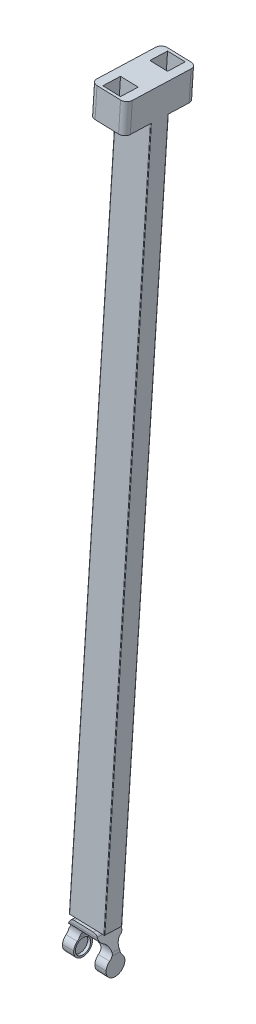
ISO-10303-21;
HEADER;
FILE_DESCRIPTION(('STEP AP214'),'2;1');
FILE_NAME('part.step','',(''),(''),'','','');
FILE_SCHEMA(('AUTOMOTIVE_DESIGN { 1 0 10303 214 1 1 1 1 }'));
ENDSEC;
DATA;
#1=APPLICATION_CONTEXT('core data for automotive mechanical design processes');
#2=APPLICATION_PROTOCOL_DEFINITION('international standard','automotive_design',2000,#1);
#3=PRODUCT_CONTEXT('',#1,'mechanical');
#4=PRODUCT('Part','Part','',(#3));
#5=PRODUCT_RELATED_PRODUCT_CATEGORY('part','',(#4));
#6=PRODUCT_DEFINITION_FORMATION('','',#4);
#7=PRODUCT_DEFINITION_CONTEXT('part definition',#1,'design');
#8=PRODUCT_DEFINITION('design','',#6,#7);
#9=PRODUCT_DEFINITION_SHAPE('','',#8);
#10=(LENGTH_UNIT() NAMED_UNIT(*) SI_UNIT(.MILLI.,.METRE.));
#11=(NAMED_UNIT(*) PLANE_ANGLE_UNIT() SI_UNIT($,.RADIAN.));
#12=(NAMED_UNIT(*) SI_UNIT($,.STERADIAN.) SOLID_ANGLE_UNIT());
#13=UNCERTAINTY_MEASURE_WITH_UNIT(LENGTH_MEASURE(1.E-05),#10,'distance_accuracy_value','');
#14=(GEOMETRIC_REPRESENTATION_CONTEXT(3) GLOBAL_UNCERTAINTY_ASSIGNED_CONTEXT((#13)) GLOBAL_UNIT_ASSIGNED_CONTEXT((#10,
#11,#12)) REPRESENTATION_CONTEXT('',''));
#15=CARTESIAN_POINT('',(0.,0.,0.));
#16=DIRECTION('',(0.,0.,1.));
#17=DIRECTION('',(1.,0.,0.));
#18=AXIS2_PLACEMENT_3D('',#15,#16,#17);
#19=CARTESIAN_POINT('',(27.0211201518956,-271.360275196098,-82.6631809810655));
#20=DIRECTION('',(0.0304556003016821,0.998894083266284,-0.0358199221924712));
#21=DIRECTION('',(-0.999535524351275,0.0304751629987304,1.56031403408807E-07));
#22=AXIS2_PLACEMENT_3D('',#19,#20,#21);
#23=CYLINDRICAL_SURFACE('',#22,5.);
#24=DIRECTION('',(0.0304556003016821,0.998894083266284,-0.0358199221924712));
#25=VECTOR('',#24,1.);
#26=CARTESIAN_POINT('',(32.0187977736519,-271.512651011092,-82.6631817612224));
#27=LINE('',#26,#25);
#28=CARTESIAN_POINT('',(33.8461337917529,-211.579006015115,-84.8123770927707));
#29=VERTEX_POINT('',#28);
#30=CARTESIAN_POINT('',(34.6075237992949,-186.606653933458,-85.7078751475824));
#31=VERTEX_POINT('',#30);
#32=EDGE_CURVE('E682',#29,#31,#27,.T.);
#33=ORIENTED_EDGE('',*,*,#32,.F.);
#34=CARTESIAN_POINT('',(28.8484561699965,-211.426630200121,-84.8123763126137));
#35=DIRECTION('',(-0.0304556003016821,-0.998894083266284,0.0358199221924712));
#36=DIRECTION('',(0.446297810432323,0.0184760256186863,0.894693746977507));
#37=AXIS2_PLACEMENT_3D('',#34,#35,#36);
#38=CIRCLE('',#37,5.);
#39=CARTESIAN_POINT('',(28.8429973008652,-211.605646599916,-89.8091676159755));
#40=VERTEX_POINT('',#39);
#41=EDGE_CURVE('E452',#29,#40,#38,.F.);
#42=ORIENTED_EDGE('',*,*,#41,.T.);
#43=DIRECTION('',(-0.0304556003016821,-0.998894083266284,0.0358199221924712));
#44=VECTOR('',#43,1.);
#45=CARTESIAN_POINT('',(27.0156612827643,-271.539291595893,-87.6599722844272));
#46=LINE('',#45,#44);
#47=CARTESIAN_POINT('',(29.6043873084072,-186.633294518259,-90.7046656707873));
#48=VERTEX_POINT('',#47);
#49=EDGE_CURVE('E545',#48,#40,#46,.T.);
#50=ORIENTED_EDGE('',*,*,#49,.F.);
#51=CARTESIAN_POINT('',(29.6098461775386,-186.454278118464,-85.7078743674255));
#52=DIRECTION('',(0.0304556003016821,0.998894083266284,-0.0358199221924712));
#53=DIRECTION('',(-0.446297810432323,-0.0184760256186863,-0.894693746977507));
#54=AXIS2_PLACEMENT_3D('',#51,#52,#53);
#55=CIRCLE('',#54,5.);
#56=EDGE_CURVE('E504',#31,#48,#55,.T.);
#57=ORIENTED_EDGE('',*,*,#56,.F.);
#58=EDGE_LOOP('',(#33,#42,#50,#57));
#59=FACE_BOUND('',#58,.T.);
#60=ADVANCED_FACE('F16',(#59),#23,.T.);
#61=CARTESIAN_POINT('',(27.0757088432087,-269.570111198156,-32.695267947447));
#62=DIRECTION('',(0.0304556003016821,0.998894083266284,-0.0358199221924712));
#63=DIRECTION('',(-0.999535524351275,0.0304751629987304,1.56031403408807E-07));
#64=AXIS2_PLACEMENT_3D('',#61,#62,#63);
#65=CYLINDRICAL_SURFACE('',#64,5.);
#66=DIRECTION('',(0.0304556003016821,0.998894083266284,-0.0358199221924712));
#67=VECTOR('',#66,1.);
#68=CARTESIAN_POINT('',(27.0811677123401,-269.391094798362,-27.6984766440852));
#69=LINE('',#68,#67);
#70=CARTESIAN_POINT('',(28.908503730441,-209.457449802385,-29.8476719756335));
#71=VERTEX_POINT('',#70);
#72=CARTESIAN_POINT('',(29.6698937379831,-184.485097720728,-30.7431700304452));
#73=VERTEX_POINT('',#72);
#74=EDGE_CURVE('E742',#71,#73,#69,.T.);
#75=ORIENTED_EDGE('',*,*,#74,.F.);
#76=CARTESIAN_POINT('',(28.9030448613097,-209.636466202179,-34.8444632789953));
#77=DIRECTION('',(-0.0304556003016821,-0.998894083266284,0.0358199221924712));
#78=DIRECTION('',(0.446297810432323,0.0184760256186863,0.894693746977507));
#79=AXIS2_PLACEMENT_3D('',#76,#77,#78);
#80=CIRCLE('',#79,5.);
#81=CARTESIAN_POINT('',(33.9007224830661,-209.788842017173,-34.8444640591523));
#82=VERTEX_POINT('',#81);
#83=EDGE_CURVE('E463',#71,#82,#80,.F.);
#84=ORIENTED_EDGE('',*,*,#83,.T.);
#85=DIRECTION('',(-0.0304556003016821,-0.998894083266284,0.0358199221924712));
#86=VECTOR('',#85,1.);
#87=CARTESIAN_POINT('',(32.0733864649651,-269.72248701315,-32.695268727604));
#88=LINE('',#87,#86);
#89=CARTESIAN_POINT('',(34.6621124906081,-184.816489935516,-35.7399621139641));
#90=VERTEX_POINT('',#89);
#91=EDGE_CURVE('E677',#90,#82,#88,.T.);
#92=ORIENTED_EDGE('',*,*,#91,.F.);
#93=CARTESIAN_POINT('',(29.6644348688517,-184.664114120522,-35.739961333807));
#94=DIRECTION('',(0.0304556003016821,0.998894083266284,-0.0358199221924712));
#95=DIRECTION('',(-0.446297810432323,-0.0184760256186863,-0.894693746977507));
#96=AXIS2_PLACEMENT_3D('',#93,#94,#95);
#97=CIRCLE('',#96,5.);
#98=EDGE_CURVE('E522',#73,#90,#97,.T.);
#99=ORIENTED_EDGE('',*,*,#98,.F.);
#100=EDGE_LOOP('',(#75,#84,#92,#99));
#101=FACE_BOUND('',#100,.T.);
#102=ADVANCED_FACE('F1361',(#101),#65,.T.);
#103=CARTESIAN_POINT('',(7.08499835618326,-268.960607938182,-32.6952648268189));
#104=DIRECTION('',(0.0304556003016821,0.998894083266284,-0.0358199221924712));
#105=DIRECTION('',(-0.999535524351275,0.0304751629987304,1.56031403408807E-07));
#106=AXIS2_PLACEMENT_3D('',#103,#104,#105);
#107=CYLINDRICAL_SURFACE('',#106,5.);
#108=DIRECTION('',(0.0304556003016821,0.998894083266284,-0.0358199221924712));
#109=VECTOR('',#108,1.);
#110=CARTESIAN_POINT('',(2.08732073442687,-268.808232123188,-32.6952640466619));
#111=LINE('',#110,#109);
#112=CARTESIAN_POINT('',(3.91465675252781,-208.874587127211,-34.8444593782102));
#113=VERTEX_POINT('',#112);
#114=CARTESIAN_POINT('',(4.67604676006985,-183.902235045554,-35.739957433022));
#115=VERTEX_POINT('',#114);
#116=EDGE_CURVE('E658',#113,#115,#111,.T.);
#117=ORIENTED_EDGE('',*,*,#116,.F.);
#118=CARTESIAN_POINT('',(8.9123343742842,-209.026962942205,-34.8444601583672));
#119=DIRECTION('',(-0.0304556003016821,-0.998894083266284,0.0358199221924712));
#120=DIRECTION('',(0.446297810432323,0.0184760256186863,0.894693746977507));
#121=AXIS2_PLACEMENT_3D('',#118,#119,#120);
#122=CIRCLE('',#121,5.);
#123=CARTESIAN_POINT('',(8.91779324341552,-208.84794654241,-29.8476688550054));
#124=VERTEX_POINT('',#123);
#125=EDGE_CURVE('E457',#113,#124,#122,.F.);
#126=ORIENTED_EDGE('',*,*,#125,.T.);
#127=DIRECTION('',(-0.0304556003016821,-0.998894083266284,0.0358199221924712));
#128=VECTOR('',#127,1.);
#129=CARTESIAN_POINT('',(7.09045722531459,-268.781591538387,-27.6984735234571));
#130=LINE('',#129,#128);
#131=CARTESIAN_POINT('',(9.67918325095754,-183.875594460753,-30.7431669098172));
#132=VERTEX_POINT('',#131);
#133=EDGE_CURVE('E549',#132,#124,#130,.T.);
#134=ORIENTED_EDGE('',*,*,#133,.F.);
#135=CARTESIAN_POINT('',(9.67372438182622,-184.054610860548,-35.739958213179));
#136=DIRECTION('',(0.0304556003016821,0.998894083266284,-0.0358199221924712));
#137=DIRECTION('',(-0.446297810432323,-0.0184760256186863,-0.894693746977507));
#138=AXIS2_PLACEMENT_3D('',#135,#136,#137);
#139=CIRCLE('',#138,5.);
#140=EDGE_CURVE('E516',#115,#132,#139,.T.);
#141=ORIENTED_EDGE('',*,*,#140,.F.);
#142=EDGE_LOOP('',(#117,#126,#134,#141));
#143=FACE_BOUND('',#142,.T.);
#144=ADVANCED_FACE('F1366',(#143),#107,.T.);
#145=CARTESIAN_POINT('',(7.03040966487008,-270.750771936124,-82.6631778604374));
#146=DIRECTION('',(0.0304556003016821,0.998894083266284,-0.0358199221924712));
#147=DIRECTION('',(-0.999535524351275,0.0304751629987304,1.56031403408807E-07));
#148=AXIS2_PLACEMENT_3D('',#145,#146,#147);
#149=CYLINDRICAL_SURFACE('',#148,5.);
#150=DIRECTION('',(0.0304556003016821,0.998894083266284,-0.0358199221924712));
#151=VECTOR('',#150,1.);
#152=CARTESIAN_POINT('',(7.02495079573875,-270.929788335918,-87.6599691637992));
#153=LINE('',#152,#151);
#154=CARTESIAN_POINT('',(8.8522868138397,-210.996143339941,-89.8091644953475));
#155=VERTEX_POINT('',#154);
#156=CARTESIAN_POINT('',(9.61367682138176,-186.023791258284,-90.7046625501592));
#157=VERTEX_POINT('',#156);
#158=EDGE_CURVE('E550',#155,#157,#153,.T.);
#159=ORIENTED_EDGE('',*,*,#158,.F.);
#160=CARTESIAN_POINT('',(8.85774568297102,-210.817126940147,-84.8123731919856));
#161=DIRECTION('',(-0.0304556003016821,-0.998894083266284,0.0358199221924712));
#162=DIRECTION('',(0.446297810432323,0.0184760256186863,0.894693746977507));
#163=AXIS2_PLACEMENT_3D('',#160,#161,#162);
#164=CIRCLE('',#163,5.);
#165=CARTESIAN_POINT('',(3.86006806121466,-210.664751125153,-84.8123724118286));
#166=VERTEX_POINT('',#165);
#167=EDGE_CURVE('E447',#155,#166,#164,.F.);
#168=ORIENTED_EDGE('',*,*,#167,.T.);
#169=DIRECTION('',(-0.0304556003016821,-0.998894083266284,0.0358199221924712));
#170=VECTOR('',#169,1.);
#171=CARTESIAN_POINT('',(2.03273204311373,-270.59839612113,-82.6631770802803));
#172=LINE('',#171,#170);
#173=CARTESIAN_POINT('',(4.62145806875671,-185.692399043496,-85.7078704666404));
#174=VERTEX_POINT('',#173);
#175=EDGE_CURVE('E671',#174,#166,#172,.T.);
#176=ORIENTED_EDGE('',*,*,#175,.F.);
#177=CARTESIAN_POINT('',(9.61913569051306,-185.84477485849,-85.7078712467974));
#178=DIRECTION('',(0.0304556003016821,0.998894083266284,-0.0358199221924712));
#179=DIRECTION('',(-0.446297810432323,-0.0184760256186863,-0.894693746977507));
#180=AXIS2_PLACEMENT_3D('',#177,#178,#179);
#181=CIRCLE('',#180,5.);
#182=EDGE_CURVE('E510',#157,#174,#181,.T.);
#183=ORIENTED_EDGE('',*,*,#182,.F.);
#184=EDGE_LOOP('',(#159,#168,#176,#183));
#185=FACE_BOUND('',#184,.T.);
#186=ADVANCED_FACE('F1849',(#185),#149,.T.);
#187=CARTESIAN_POINT('',(25.3409894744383,-244.432063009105,-31.0923699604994));
#188=DIRECTION('',(0.999535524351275,-0.0304751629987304,-1.56031403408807E-07));
#189=DIRECTION('',(0.00109177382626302,0.0358032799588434,0.999358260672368));
#190=AXIS2_PLACEMENT_3D('',#187,#188,#189);
#191=PLANE('',#190);
#192=DIRECTION('',(-0.00109177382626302,-0.0358032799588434,-0.999358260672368));
#193=VECTOR('',#192,1.);
#194=CARTESIAN_POINT('',(26.4069354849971,-209.470770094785,-32.3460672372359));
#195=LINE('',#194,#193);
#196=CARTESIAN_POINT('',(26.4069354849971,-209.470770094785,-32.3460672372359));
#197=VERTEX_POINT('',#196);
#198=CARTESIAN_POINT('',(26.3905588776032,-210.007819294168,-47.3364411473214));
#199=VERTEX_POINT('',#198);
#200=EDGE_CURVE('E31',#197,#199,#195,.T.);
#201=ORIENTED_EDGE('',*,*,#200,.F.);
#202=DIRECTION('',(-0.0304556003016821,-0.998894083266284,0.0358199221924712));
#203=VECTOR('',#202,1.);
#204=CARTESIAN_POINT('',(25.3409894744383,-244.432063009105,-31.0923699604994));
#205=LINE('',#204,#203);
#206=CARTESIAN_POINT('',(27.1683254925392,-184.498418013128,-33.2415652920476));
#207=VERTEX_POINT('',#206);
#208=EDGE_CURVE('E614',#207,#197,#205,.T.);
#209=ORIENTED_EDGE('',*,*,#208,.F.);
#210=DIRECTION('',(-0.00109177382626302,-0.0358032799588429,-0.999358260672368));
#211=VECTOR('',#210,1.);
#212=CARTESIAN_POINT('',(27.1683254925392,-184.498418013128,-33.2415652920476));
#213=LINE('',#212,#211);
#214=CARTESIAN_POINT('',(27.1519488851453,-185.035467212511,-48.2319392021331));
#215=VERTEX_POINT('',#214);
#216=EDGE_CURVE('E480',#207,#215,#213,.T.);
#217=ORIENTED_EDGE('',*,*,#216,.T.);
#218=DIRECTION('',(-0.0304556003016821,-0.998894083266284,0.0358199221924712));
#219=VECTOR('',#218,1.);
#220=CARTESIAN_POINT('',(25.3246128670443,-244.969112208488,-46.0827438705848));
#221=LINE('',#220,#219);
#222=EDGE_CURVE('E605',#215,#199,#221,.T.);
#223=ORIENTED_EDGE('',*,*,#222,.T.);
#224=EDGE_LOOP('',(#201,#209,#217,#223));
#225=FACE_BOUND('',#224,.T.);
#226=ADVANCED_FACE('F1444',(#225),#191,.F.);
#227=CARTESIAN_POINT('',(25.3409894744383,-244.432063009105,-31.0923699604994));
#228=DIRECTION('',(0.00109177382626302,0.0358032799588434,0.999358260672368));
#229=DIRECTION('',(0.999535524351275,-0.0304751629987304,-1.56031403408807E-07));
#230=AXIS2_PLACEMENT_3D('',#227,#228,#229);
#231=PLANE('',#230);
#232=DIRECTION('',(0.999535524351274,-0.0304751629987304,-1.56031403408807E-07));
#233=VECTOR('',#232,1.);
#234=CARTESIAN_POINT('',(26.4069354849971,-209.470770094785,-32.3460672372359));
#235=LINE('',#234,#233);
#236=CARTESIAN_POINT('',(11.4139026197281,-209.013642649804,-32.3460648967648));
#237=VERTEX_POINT('',#236);
#238=EDGE_CURVE('E477',#237,#197,#235,.T.);
#239=ORIENTED_EDGE('',*,*,#238,.F.);
#240=DIRECTION('',(-0.0304556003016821,-0.998894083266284,0.0358199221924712));
#241=VECTOR('',#240,1.);
#242=CARTESIAN_POINT('',(10.3479566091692,-243.974935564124,-31.0923676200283));
#243=LINE('',#242,#241);
#244=CARTESIAN_POINT('',(12.1752926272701,-184.041290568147,-33.2415629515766));
#245=VERTEX_POINT('',#244);
#246=EDGE_CURVE('E604',#245,#237,#243,.T.);
#247=ORIENTED_EDGE('',*,*,#246,.F.);
#248=DIRECTION('',(0.999535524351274,-0.0304751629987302,-1.56031402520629E-07));
#249=VECTOR('',#248,1.);
#250=CARTESIAN_POINT('',(12.1752926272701,-184.041290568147,-33.2415629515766));
#251=LINE('',#250,#249);
#252=EDGE_CURVE('E489',#245,#207,#251,.T.);
#253=ORIENTED_EDGE('',*,*,#252,.T.);
#254=ORIENTED_EDGE('',*,*,#208,.T.);
#255=EDGE_LOOP('',(#239,#247,#253,#254));
#256=FACE_BOUND('',#255,.T.);
#257=ADVANCED_FACE('F1441',(#256),#231,.F.);
#258=CARTESIAN_POINT('',(10.3479566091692,-243.974935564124,-31.0923676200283));
#259=DIRECTION('',(-0.999535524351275,0.0304751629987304,1.56031403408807E-07));
#260=DIRECTION('',(0.00109177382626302,0.0358032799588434,0.999358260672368));
#261=AXIS2_PLACEMENT_3D('',#258,#259,#260);
#262=PLANE('',#261);
#263=DIRECTION('',(0.00109177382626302,0.0358032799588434,0.999358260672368));
#264=VECTOR('',#263,1.);
#265=CARTESIAN_POINT('',(11.4139026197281,-209.013642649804,-32.3460648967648));
#266=LINE('',#265,#264);
#267=CARTESIAN_POINT('',(11.3975260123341,-209.550691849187,-47.3364388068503));
#268=VERTEX_POINT('',#267);
#269=EDGE_CURVE('E475',#268,#237,#266,.T.);
#270=ORIENTED_EDGE('',*,*,#269,.F.);
#271=DIRECTION('',(-0.0304556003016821,-0.998894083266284,0.0358199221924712));
#272=VECTOR('',#271,1.);
#273=CARTESIAN_POINT('',(10.3315800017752,-244.511984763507,-46.0827415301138));
#274=LINE('',#273,#272);
#275=CARTESIAN_POINT('',(12.1589160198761,-184.57833976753,-48.2319368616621));
#276=VERTEX_POINT('',#275);
#277=EDGE_CURVE('E600',#276,#268,#274,.T.);
#278=ORIENTED_EDGE('',*,*,#277,.F.);
#279=DIRECTION('',(0.00109177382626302,0.0358032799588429,0.999358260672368));
#280=VECTOR('',#279,1.);
#281=CARTESIAN_POINT('',(12.1589160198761,-184.57833976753,-48.2319368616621));
#282=LINE('',#281,#280);
#283=EDGE_CURVE('E486',#276,#245,#282,.T.);
#284=ORIENTED_EDGE('',*,*,#283,.T.);
#285=ORIENTED_EDGE('',*,*,#246,.T.);
#286=EDGE_LOOP('',(#270,#278,#284,#285));
#287=FACE_BOUND('',#286,.T.);
#288=ADVANCED_FACE('F1059',(#287),#262,.F.);
#289=CARTESIAN_POINT('',(25.3246128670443,-244.969112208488,-46.0827438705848));
#290=DIRECTION('',(-0.00109177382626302,-0.0358032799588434,-0.999358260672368));
#291=DIRECTION('',(-0.0304556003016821,-0.998894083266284,0.0358199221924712));
#292=AXIS2_PLACEMENT_3D('',#289,#290,#291);
#293=PLANE('',#292);
#294=DIRECTION('',(-0.999535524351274,0.0304751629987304,1.56031403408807E-07));
#295=VECTOR('',#294,1.);
#296=CARTESIAN_POINT('',(26.3905588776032,-210.007819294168,-47.3364411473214));
#297=LINE('',#296,#295);
#298=EDGE_CURVE('E473',#199,#268,#297,.T.);
#299=ORIENTED_EDGE('',*,*,#298,.F.);
#300=ORIENTED_EDGE('',*,*,#222,.F.);
#301=DIRECTION('',(-0.999535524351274,0.0304751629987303,1.56031403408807E-07));
#302=VECTOR('',#301,1.);
#303=CARTESIAN_POINT('',(27.1519488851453,-185.035467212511,-48.2319392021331));
#304=LINE('',#303,#302);
#305=EDGE_CURVE('E483',#215,#276,#304,.T.);
#306=ORIENTED_EDGE('',*,*,#305,.T.);
#307=ORIENTED_EDGE('',*,*,#277,.T.);
#308=EDGE_LOOP('',(#299,#300,#306,#307));
#309=FACE_BOUND('',#308,.T.);
#310=ADVANCED_FACE('F1451',(#309),#293,.F.);
#311=CARTESIAN_POINT('',(25.2973185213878,-245.864194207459,-71.0667003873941));
#312=DIRECTION('',(0.999535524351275,-0.0304751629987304,-1.56031403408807E-07));
#313=DIRECTION('',(0.00109177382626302,0.0358032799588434,0.999358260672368));
#314=AXIS2_PLACEMENT_3D('',#311,#312,#313);
#315=PLANE('',#314);
#316=DIRECTION('',(-0.00109177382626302,-0.0358032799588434,-0.999358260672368));
#317=VECTOR('',#316,1.);
#318=CARTESIAN_POINT('',(26.3632645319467,-210.902901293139,-72.3203976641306));
#319=LINE('',#318,#317);
#320=CARTESIAN_POINT('',(26.3632645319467,-210.902901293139,-72.3203976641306));
#321=VERTEX_POINT('',#320);
#322=CARTESIAN_POINT('',(26.3468879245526,-211.439950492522,-87.3107715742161));
#323=VERTEX_POINT('',#322);
#324=EDGE_CURVE('E39',#321,#323,#319,.T.);
#325=ORIENTED_EDGE('',*,*,#324,.F.);
#326=DIRECTION('',(-0.0304556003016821,-0.998894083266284,0.0358199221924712));
#327=VECTOR('',#326,1.);
#328=CARTESIAN_POINT('',(25.2973185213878,-245.864194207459,-71.0667003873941));
#329=LINE('',#328,#327);
#330=CARTESIAN_POINT('',(27.1246545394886,-185.930549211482,-73.2158957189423));
#331=VERTEX_POINT('',#330);
#332=EDGE_CURVE('E672',#331,#321,#329,.T.);
#333=ORIENTED_EDGE('',*,*,#332,.F.);
#334=DIRECTION('',(-0.00109177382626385,-0.0358032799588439,-0.999358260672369));
#335=VECTOR('',#334,1.);
#336=CARTESIAN_POINT('',(27.1082779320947,-186.467598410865,-88.2062696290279));
#337=LINE('',#336,#335);
#338=CARTESIAN_POINT('',(27.1082779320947,-186.467598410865,-88.2062696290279));
#339=VERTEX_POINT('',#338);
#340=EDGE_CURVE('E501',#331,#339,#337,.T.);
#341=ORIENTED_EDGE('',*,*,#340,.T.);
#342=DIRECTION('',(-0.0304556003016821,-0.998894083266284,0.0358199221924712));
#343=VECTOR('',#342,1.);
#344=CARTESIAN_POINT('',(25.2809419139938,-246.401243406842,-86.0570742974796));
#345=LINE('',#344,#343);
#346=EDGE_CURVE('E738',#339,#323,#345,.T.);
#347=ORIENTED_EDGE('',*,*,#346,.T.);
#348=EDGE_LOOP('',(#325,#333,#341,#347));
#349=FACE_BOUND('',#348,.T.);
#350=ADVANCED_FACE('F1453',(#349),#315,.F.);
#351=CARTESIAN_POINT('',(25.2973185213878,-245.864194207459,-71.0667003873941));
#352=DIRECTION('',(0.00109177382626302,0.0358032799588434,0.999358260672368));
#353=DIRECTION('',(0.999535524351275,-0.0304751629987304,-1.56031403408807E-07));
#354=AXIS2_PLACEMENT_3D('',#351,#352,#353);
#355=PLANE('',#354);
#356=DIRECTION('',(0.999535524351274,-0.0304751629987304,-1.56031403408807E-07));
#357=VECTOR('',#356,1.);
#358=CARTESIAN_POINT('',(26.3632645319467,-210.902901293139,-72.3203976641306));
#359=LINE('',#358,#357);
#360=CARTESIAN_POINT('',(11.3702316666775,-210.445773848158,-72.3203953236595));
#361=VERTEX_POINT('',#360);
#362=EDGE_CURVE('E470',#361,#321,#359,.T.);
#363=ORIENTED_EDGE('',*,*,#362,.F.);
#364=DIRECTION('',(-0.0304556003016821,-0.998894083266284,0.0358199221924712));
#365=VECTOR('',#364,1.);
#366=CARTESIAN_POINT('',(10.3042856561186,-245.407066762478,-71.066698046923));
#367=LINE('',#366,#365);
#368=CARTESIAN_POINT('',(12.1316216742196,-185.473421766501,-73.2158933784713));
#369=VERTEX_POINT('',#368);
#370=EDGE_CURVE('E676',#369,#361,#367,.T.);
#371=ORIENTED_EDGE('',*,*,#370,.F.);
#372=DIRECTION('',(0.999535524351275,-0.0304751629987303,-1.56031403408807E-07));
#373=VECTOR('',#372,1.);
#374=CARTESIAN_POINT('',(27.1246545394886,-185.930549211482,-73.2158957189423));
#375=LINE('',#374,#373);
#376=EDGE_CURVE('E498',#369,#331,#375,.T.);
#377=ORIENTED_EDGE('',*,*,#376,.T.);
#378=ORIENTED_EDGE('',*,*,#332,.T.);
#379=EDGE_LOOP('',(#363,#371,#377,#378));
#380=FACE_BOUND('',#379,.T.);
#381=ADVANCED_FACE('F1438',(#380),#355,.F.);
#382=CARTESIAN_POINT('',(10.3042856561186,-245.407066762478,-71.066698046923));
#383=DIRECTION('',(-0.999535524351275,0.0304751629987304,1.56031403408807E-07));
#384=DIRECTION('',(0.00109177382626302,0.0358032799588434,0.999358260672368));
#385=AXIS2_PLACEMENT_3D('',#382,#383,#384);
#386=PLANE('',#385);
#387=DIRECTION('',(0.00109177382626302,0.0358032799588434,0.999358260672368));
#388=VECTOR('',#387,1.);
#389=CARTESIAN_POINT('',(11.3702316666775,-210.445773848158,-72.3203953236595));
#390=LINE('',#389,#388);
#391=CARTESIAN_POINT('',(11.3538550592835,-210.982823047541,-87.310769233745));
#392=VERTEX_POINT('',#391);
#393=EDGE_CURVE('E468',#392,#361,#390,.T.);
#394=ORIENTED_EDGE('',*,*,#393,.F.);
#395=DIRECTION('',(-0.0304556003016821,-0.998894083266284,0.0358199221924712));
#396=VECTOR('',#395,1.);
#397=CARTESIAN_POINT('',(10.2879090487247,-245.944115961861,-86.0570719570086));
#398=LINE('',#397,#396);
#399=CARTESIAN_POINT('',(12.1152450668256,-186.010470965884,-88.2062672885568));
#400=VERTEX_POINT('',#399);
#401=EDGE_CURVE('E734',#400,#392,#398,.T.);
#402=ORIENTED_EDGE('',*,*,#401,.F.);
#403=DIRECTION('',(0.00109177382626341,0.0358032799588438,0.999358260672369));
#404=VECTOR('',#403,1.);
#405=CARTESIAN_POINT('',(12.1316216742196,-185.473421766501,-73.2158933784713));
#406=LINE('',#405,#404);
#407=EDGE_CURVE('E495',#400,#369,#406,.T.);
#408=ORIENTED_EDGE('',*,*,#407,.T.);
#409=ORIENTED_EDGE('',*,*,#370,.T.);
#410=EDGE_LOOP('',(#394,#402,#408,#409));
#411=FACE_BOUND('',#410,.T.);
#412=ADVANCED_FACE('F1433',(#411),#386,.F.);
#413=CARTESIAN_POINT('',(25.2809419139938,-246.401243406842,-86.0570742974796));
#414=DIRECTION('',(-0.00109177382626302,-0.0358032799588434,-0.999358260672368));
#415=DIRECTION('',(-0.0304556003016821,-0.998894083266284,0.0358199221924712));
#416=AXIS2_PLACEMENT_3D('',#413,#414,#415);
#417=PLANE('',#416);
#418=DIRECTION('',(-0.999535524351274,0.0304751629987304,1.56031403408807E-07));
#419=VECTOR('',#418,1.);
#420=CARTESIAN_POINT('',(26.3468879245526,-211.439950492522,-87.3107715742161));
#421=LINE('',#420,#419);
#422=EDGE_CURVE('E466',#323,#392,#421,.T.);
#423=ORIENTED_EDGE('',*,*,#422,.F.);
#424=ORIENTED_EDGE('',*,*,#346,.F.);
#425=DIRECTION('',(-0.999535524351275,0.0304751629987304,1.56031403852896E-07));
#426=VECTOR('',#425,1.);
#427=CARTESIAN_POINT('',(12.1152450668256,-186.010470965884,-88.2062672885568));
#428=LINE('',#427,#426);
#429=EDGE_CURVE('E492',#339,#400,#428,.T.);
#430=ORIENTED_EDGE('',*,*,#429,.T.);
#431=ORIENTED_EDGE('',*,*,#401,.T.);
#432=EDGE_LOOP('',(#423,#424,#430,#431));
#433=FACE_BOUND('',#432,.T.);
#434=ADVANCED_FACE('F1427',(#433),#417,.F.);
#435=CARTESIAN_POINT('',(2.09277960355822,-268.629215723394,-27.6984727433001));
#436=DIRECTION('',(-0.00109177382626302,-0.0358032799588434,-0.999358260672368));
#437=DIRECTION('',(-0.0304556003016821,-0.998894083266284,0.0358199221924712));
#438=AXIS2_PLACEMENT_3D('',#435,#436,#437);
#439=PLANE('',#438);
#440=DIRECTION('',(-0.999535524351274,0.0304751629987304,1.56031403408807E-07));
#441=VECTOR('',#440,1.);
#442=CARTESIAN_POINT('',(3.92011562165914,-208.695570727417,-29.8476680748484));
#443=LINE('',#442,#441);
#444=EDGE_CURVE('E461',#71,#124,#443,.T.);
#445=ORIENTED_EDGE('',*,*,#444,.F.);
#446=ORIENTED_EDGE('',*,*,#74,.T.);
#447=DIRECTION('',(0.999535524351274,-0.0304751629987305,-1.56031402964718E-07));
#448=VECTOR('',#447,1.);
#449=CARTESIAN_POINT('',(29.6698937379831,-184.485097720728,-30.7431700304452));
#450=LINE('',#449,#448);
#451=EDGE_CURVE('E519',#132,#73,#450,.T.);
#452=ORIENTED_EDGE('',*,*,#451,.F.);
#453=ORIENTED_EDGE('',*,*,#133,.T.);
#454=EDGE_LOOP('',(#445,#446,#452,#453));
#455=FACE_BOUND('',#454,.T.);
#456=ADVANCED_FACE('F1110',(#455),#439,.F.);
#457=CARTESIAN_POINT('',(2.02727317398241,-270.777412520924,-87.6599683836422));
#458=DIRECTION('',(0.00109177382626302,0.0358032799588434,0.999358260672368));
#459=DIRECTION('',(0.999535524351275,-0.0304751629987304,-1.56031403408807E-07));
#460=AXIS2_PLACEMENT_3D('',#457,#458,#459);
#461=PLANE('',#460);
#462=DIRECTION('',(0.999535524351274,-0.0304751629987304,-1.56031403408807E-07));
#463=VECTOR('',#462,1.);
#464=CARTESIAN_POINT('',(3.85460919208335,-210.843767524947,-89.8091637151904));
#465=LINE('',#464,#463);
#466=EDGE_CURVE('E450',#155,#40,#465,.T.);
#467=ORIENTED_EDGE('',*,*,#466,.F.);
#468=ORIENTED_EDGE('',*,*,#158,.T.);
#469=DIRECTION('',(-0.999535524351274,0.0304751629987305,1.56031402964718E-07));
#470=VECTOR('',#469,1.);
#471=CARTESIAN_POINT('',(29.6043873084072,-186.633294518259,-90.7046656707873));
#472=LINE('',#471,#470);
#473=EDGE_CURVE('E507',#48,#157,#472,.T.);
#474=ORIENTED_EDGE('',*,*,#473,.F.);
#475=ORIENTED_EDGE('',*,*,#49,.T.);
#476=EDGE_LOOP('',(#467,#468,#474,#475));
#477=FACE_BOUND('',#476,.T.);
#478=ADVANCED_FACE('F1426',(#477),#461,.F.);
#479=CARTESIAN_POINT('',(2.6892589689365,-265.472352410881,-50.8269925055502));
#480=DIRECTION('',(-0.0304556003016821,-0.998894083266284,0.0358199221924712));
#481=DIRECTION('',(0.999535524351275,-0.0304751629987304,-1.56031403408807E-07));
#482=AXIS2_PLACEMENT_3D('',#479,#480,#481);
#483=CYLINDRICAL_SURFACE('',#482,0.5);
#484=DIRECTION('',(-0.0304556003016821,-0.998894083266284,0.0358199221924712));
#485=VECTOR('',#484,1.);
#486=CARTESIAN_POINT('',(2.68980485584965,-265.454450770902,-50.327313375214));
#487=LINE('',#486,#485);
#488=CARTESIAN_POINT('',(4.39531847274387,-209.51638210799,-52.3332290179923));
#489=VERTEX_POINT('',#488);
#490=CARTESIAN_POINT('',(-13.7562193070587,-804.857255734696,-30.9845553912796));
#491=VERTEX_POINT('',#490);
#492=EDGE_CURVE('E587',#489,#491,#487,.T.);
#493=ORIENTED_EDGE('',*,*,#492,.F.);
#494=CARTESIAN_POINT('',(4.39477258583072,-209.53428374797,-52.8329081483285));
#495=DIRECTION('',(-0.0304556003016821,-0.998894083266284,0.0358199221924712));
#496=DIRECTION('',(0.446297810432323,0.0184760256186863,0.894693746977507));
#497=AXIS2_PLACEMENT_3D('',#494,#495,#496);
#498=CIRCLE('',#497,0.5);
#499=CARTESIAN_POINT('',(3.89500482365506,-209.51904616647,-52.8329080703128));
#500=VERTEX_POINT('',#499);
#501=EDGE_CURVE('E444',#489,#500,#498,.T.);
#502=ORIENTED_EDGE('',*,*,#501,.T.);
#503=DIRECTION('',(0.0304556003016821,0.998894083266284,-0.0358199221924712));
#504=VECTOR('',#503,1.);
#505=CARTESIAN_POINT('',(2.18949120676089,-265.457114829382,-50.8269924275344));
#506=LINE('',#505,#504);
#507=CARTESIAN_POINT('',(-14.2565329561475,-804.859919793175,-31.4842344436));
#508=VERTEX_POINT('',#507);
#509=EDGE_CURVE('E655',#508,#500,#506,.T.);
#510=ORIENTED_EDGE('',*,*,#509,.F.);
#511=CARTESIAN_POINT('',(-13.7567651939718,-804.875157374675,-31.4842345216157));
#512=DIRECTION('',(-0.0304556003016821,-0.998894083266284,0.0358199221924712));
#513=DIRECTION('',(0.999535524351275,-0.0304751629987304,-1.56031403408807E-07));
#514=AXIS2_PLACEMENT_3D('',#511,#512,#513);
#515=CIRCLE('',#514,0.5);
#516=EDGE_CURVE('E690',#491,#508,#515,.T.);
#517=ORIENTED_EDGE('',*,*,#516,.F.);
#518=EDGE_LOOP('',(#493,#502,#510,#517));
#519=FACE_BOUND('',#518,.T.);
#520=ADVANCED_FACE('F1419',(#519),#483,.T.);
#521=CARTESIAN_POINT('',(2.67397413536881,-265.973598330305,-64.8180081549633));
#522=DIRECTION('',(-0.0304556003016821,-0.998894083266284,0.0358199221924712));
#523=DIRECTION('',(0.999535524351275,-0.0304751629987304,-1.56031403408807E-07));
#524=AXIS2_PLACEMENT_3D('',#521,#522,#523);
#525=CYLINDRICAL_SURFACE('',#524,0.5);
#526=CARTESIAN_POINT('',(-13.7720500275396,-805.376403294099,-45.4752501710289));
#527=DIRECTION('',(-0.0304556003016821,-0.998894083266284,0.0358199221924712));
#528=DIRECTION('',(0.999535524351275,-0.0304751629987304,-1.56031403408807E-07));
#529=AXIS2_PLACEMENT_3D('',#526,#527,#528);
#530=CIRCLE('',#529,0.5);
#531=CARTESIAN_POINT('',(-14.2718177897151,-805.3611657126,-45.4752500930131));
#532=VERTEX_POINT('',#531);
#533=CARTESIAN_POINT('',(-13.7725959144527,-805.394304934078,-45.9749293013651));
#534=VERTEX_POINT('',#533);
#535=EDGE_CURVE('E693',#532,#534,#530,.T.);
#536=ORIENTED_EDGE('',*,*,#535,.F.);
#537=DIRECTION('',(-0.0304556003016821,-0.998894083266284,0.0358199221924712));
#538=VECTOR('',#537,1.);
#539=CARTESIAN_POINT('',(2.17420637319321,-265.958360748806,-64.8180080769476));
#540=LINE('',#539,#538);
#541=CARTESIAN_POINT('',(3.87971999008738,-210.020292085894,-66.823923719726));
#542=VERTEX_POINT('',#541);
#543=EDGE_CURVE('E434',#542,#532,#540,.T.);
#544=ORIENTED_EDGE('',*,*,#543,.F.);
#545=CARTESIAN_POINT('',(4.37948775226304,-210.035529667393,-66.8239237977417));
#546=DIRECTION('',(-0.0304556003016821,-0.998894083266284,0.0358199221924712));
#547=DIRECTION('',(0.446297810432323,0.0184760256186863,0.894693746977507));
#548=AXIS2_PLACEMENT_3D('',#545,#546,#547);
#549=CIRCLE('',#548,0.5);
#550=CARTESIAN_POINT('',(4.37894186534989,-210.053431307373,-67.3236029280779));
#551=VERTEX_POINT('',#550);
#552=EDGE_CURVE('E428',#542,#551,#549,.T.);
#553=ORIENTED_EDGE('',*,*,#552,.T.);
#554=DIRECTION('',(0.0304556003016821,0.998894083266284,-0.0358199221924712));
#555=VECTOR('',#554,1.);
#556=CARTESIAN_POINT('',(2.6734282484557,-265.991499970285,-65.3176872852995));
#557=LINE('',#556,#555);
#558=EDGE_CURVE('E410',#534,#551,#557,.T.);
#559=ORIENTED_EDGE('',*,*,#558,.F.);
#560=EDGE_LOOP('',(#536,#544,#553,#559));
#561=FACE_BOUND('',#560,.T.);
#562=ADVANCED_FACE('F433',(#561),#525,.T.);
#563=CARTESIAN_POINT('',(31.6605043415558,-266.857378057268,-64.818012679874));
#564=DIRECTION('',(-0.0304556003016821,-0.998894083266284,0.0358199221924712));
#565=DIRECTION('',(0.999535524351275,-0.0304751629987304,-1.56031403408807E-07));
#566=AXIS2_PLACEMENT_3D('',#563,#564,#565);
#567=CYLINDRICAL_SURFACE('',#566,0.5);
#568=DIRECTION('',(-0.0304556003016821,-0.998894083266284,0.0358199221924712));
#569=VECTOR('',#568,1.);
#570=CARTESIAN_POINT('',(31.6599584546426,-266.875279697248,-65.3176918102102));
#571=LINE('',#570,#569);
#572=CARTESIAN_POINT('',(33.3654720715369,-210.937211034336,-67.3236074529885));
#573=VERTEX_POINT('',#572);
#574=CARTESIAN_POINT('',(15.2139342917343,-806.278084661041,-45.9749338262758));
#575=VERTEX_POINT('',#574);
#576=EDGE_CURVE('E420',#573,#575,#571,.T.);
#577=ORIENTED_EDGE('',*,*,#576,.F.);
#578=CARTESIAN_POINT('',(33.36601795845,-210.919309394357,-66.8239283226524));
#579=DIRECTION('',(-0.0304556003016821,-0.998894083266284,0.0358199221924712));
#580=DIRECTION('',(0.446297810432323,0.0184760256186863,0.894693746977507));
#581=AXIS2_PLACEMENT_3D('',#578,#579,#580);
#582=CIRCLE('',#581,0.499999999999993);
#583=CARTESIAN_POINT('',(33.8657857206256,-210.934546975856,-66.8239284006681));
#584=VERTEX_POINT('',#583);
#585=EDGE_CURVE('E431',#573,#584,#582,.T.);
#586=ORIENTED_EDGE('',*,*,#585,.T.);
#587=DIRECTION('',(0.0304556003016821,0.998894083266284,-0.0358199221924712));
#588=VECTOR('',#587,1.);
#589=CARTESIAN_POINT('',(32.1602721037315,-266.872615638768,-64.8180127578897));
#590=LINE('',#589,#588);
#591=CARTESIAN_POINT('',(15.714247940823,-806.275420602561,-45.4752547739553));
#592=VERTEX_POINT('',#591);
#593=EDGE_CURVE('E771',#592,#584,#590,.T.);
#594=ORIENTED_EDGE('',*,*,#593,.F.);
#595=CARTESIAN_POINT('',(15.2144801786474,-806.260183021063,-45.4752546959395));
#596=DIRECTION('',(-0.0304556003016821,-0.998894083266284,0.0358199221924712));
#597=DIRECTION('',(0.999535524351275,-0.0304751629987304,-1.56031403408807E-07));
#598=AXIS2_PLACEMENT_3D('',#595,#596,#597);
#599=CIRCLE('',#598,0.5);
#600=EDGE_CURVE('E582',#575,#592,#599,.T.);
#601=ORIENTED_EDGE('',*,*,#600,.F.);
#602=EDGE_LOOP('',(#577,#586,#594,#601));
#603=FACE_BOUND('',#602,.T.);
#604=ADVANCED_FACE('F1394',(#603),#567,.T.);
#605=CARTESIAN_POINT('',(31.6757891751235,-266.356132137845,-50.8269970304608));
#606=DIRECTION('',(-0.0304556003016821,-0.998894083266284,0.0358199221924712));
#607=DIRECTION('',(0.999535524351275,-0.0304751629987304,-1.56031403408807E-07));
#608=AXIS2_PLACEMENT_3D('',#605,#606,#607);
#609=CYLINDRICAL_SURFACE('',#608,0.5);
#610=CARTESIAN_POINT('',(15.2297650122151,-805.758937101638,-31.4842390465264));
#611=DIRECTION('',(-0.0304556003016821,-0.998894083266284,0.0358199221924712));
#612=DIRECTION('',(0.999535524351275,-0.0304751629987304,-1.56031403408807E-07));
#613=AXIS2_PLACEMENT_3D('',#610,#611,#612);
#614=CIRCLE('',#613,0.5);
#615=CARTESIAN_POINT('',(15.7295327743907,-805.774174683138,-31.4842391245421));
#616=VERTEX_POINT('',#615);
#617=CARTESIAN_POINT('',(15.2303108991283,-805.741035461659,-30.9845599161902));
#618=VERTEX_POINT('',#617);
#619=EDGE_CURVE('E551',#616,#618,#614,.T.);
#620=ORIENTED_EDGE('',*,*,#619,.F.);
#621=DIRECTION('',(-0.0304556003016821,-0.998894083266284,0.0358199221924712));
#622=VECTOR('',#621,1.);
#623=CARTESIAN_POINT('',(32.1755569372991,-266.371369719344,-50.8269971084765));
#624=LINE('',#623,#622);
#625=CARTESIAN_POINT('',(33.8810705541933,-210.433301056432,-52.8329127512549));
#626=VERTEX_POINT('',#625);
#627=EDGE_CURVE('E681',#626,#616,#624,.T.);
#628=ORIENTED_EDGE('',*,*,#627,.F.);
#629=CARTESIAN_POINT('',(33.3813027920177,-210.418063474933,-52.8329126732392));
#630=DIRECTION('',(-0.0304556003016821,-0.998894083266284,0.0358199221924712));
#631=DIRECTION('',(-0.446297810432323,-0.0184760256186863,-0.894693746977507));
#632=AXIS2_PLACEMENT_3D('',#629,#630,#631);
#633=CIRCLE('',#632,0.5);
#634=CARTESIAN_POINT('',(33.3818486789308,-210.400161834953,-52.333233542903));
#635=VERTEX_POINT('',#634);
#636=EDGE_CURVE('E438',#626,#635,#633,.T.);
#637=ORIENTED_EDGE('',*,*,#636,.T.);
#638=DIRECTION('',(0.0304556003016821,0.998894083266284,-0.0358199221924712));
#639=VECTOR('',#638,1.);
#640=CARTESIAN_POINT('',(31.6763350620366,-266.338230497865,-50.3273179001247));
#641=LINE('',#640,#639);
#642=EDGE_CURVE('E581',#618,#635,#641,.T.);
#643=ORIENTED_EDGE('',*,*,#642,.F.);
#644=EDGE_LOOP('',(#620,#628,#637,#643));
#645=FACE_BOUND('',#644,.T.);
#646=ADVANCED_FACE('F1000',(#645),#609,.T.);
#647=CARTESIAN_POINT('',(15.7137020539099,-806.293322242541,-45.9749339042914));
#648=DIRECTION('',(-0.0304556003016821,-0.998894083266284,0.0358199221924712));
#649=DIRECTION('',(-0.00109177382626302,-0.0358032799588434,-0.999358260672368));
#650=AXIS2_PLACEMENT_3D('',#647,#648,#649);
#651=PLANE('',#650);
#652=DIRECTION('',(-0.999535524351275,0.0304751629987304,1.56031403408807E-07));
#653=VECTOR('',#652,1.);
#654=CARTESIAN_POINT('',(-14.2723636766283,-805.37906735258,-45.9749292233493));
#655=LINE('',#654,#653);
#656=CARTESIAN_POINT('',(-7.38326013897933,-805.58911146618,-45.9749302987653));
#657=VERTEX_POINT('',#656);
#658=EDGE_CURVE('E415',#657,#534,#655,.T.);
#659=ORIENTED_EDGE('',*,*,#658,.F.);
#660=DIRECTION('',(0.00109177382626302,0.0358032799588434,0.999358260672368));
#661=VECTOR('',#660,1.);
#662=CARTESIAN_POINT('',(-7.38598957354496,-805.678619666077,-48.4733259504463));
#663=LINE('',#662,#661);
#664=CARTESIAN_POINT('',(-7.3668835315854,-805.052062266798,-30.9845563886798));
#665=VERTEX_POINT('',#664);
#666=EDGE_CURVE('E757',#657,#665,#663,.T.);
#667=ORIENTED_EDGE('',*,*,#666,.T.);
#668=DIRECTION('',(0.999535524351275,-0.0304751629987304,-1.56031403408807E-07));
#669=VECTOR('',#668,1.);
#670=CARTESIAN_POINT('',(-14.2559870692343,-804.842018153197,-30.9845553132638));
#671=LINE('',#670,#669);
#672=EDGE_CURVE('E591',#491,#665,#671,.T.);
#673=ORIENTED_EDGE('',*,*,#672,.F.);
#674=ORIENTED_EDGE('',*,*,#516,.T.);
#675=DIRECTION('',(0.00109177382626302,0.0358032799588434,0.999358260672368));
#676=VECTOR('',#675,1.);
#677=CARTESIAN_POINT('',(-14.2723636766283,-805.37906735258,-45.9749292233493));
#678=LINE('',#677,#676);
#679=EDGE_CURVE('E574',#532,#508,#678,.T.);
#680=ORIENTED_EDGE('',*,*,#679,.F.);
#681=ORIENTED_EDGE('',*,*,#535,.T.);
#682=EDGE_LOOP('',(#659,#667,#673,#674,#680,#681));
#683=FACE_BOUND('',#682,.T.);
#684=ADVANCED_FACE('F1412',(#683),#651,.T.);
#685=CARTESIAN_POINT('',(32.1597262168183,-266.890517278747,-65.3176918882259));
#686=DIRECTION('',(-0.999535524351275,0.0304751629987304,1.56031403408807E-07));
#687=DIRECTION('',(0.00109177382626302,0.0358032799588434,0.999358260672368));
#688=AXIS2_PLACEMENT_3D('',#685,#686,#687);
#689=PLANE('',#688);
#690=ORIENTED_EDGE('',*,*,#593,.T.);
#691=DIRECTION('',(0.00109177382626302,0.0358032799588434,0.999358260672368));
#692=VECTOR('',#691,1.);
#693=CARTESIAN_POINT('',(33.8652398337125,-210.952448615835,-67.3236075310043));
#694=LINE('',#693,#692);
#695=EDGE_CURVE('E455',#29,#584,#694,.T.);
#696=ORIENTED_EDGE('',*,*,#695,.F.);
#697=ORIENTED_EDGE('',*,*,#32,.T.);
#698=DIRECTION('',(-0.00109177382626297,-0.0358032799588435,-0.999358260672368));
#699=VECTOR('',#698,1.);
#700=CARTESIAN_POINT('',(34.6075237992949,-186.606653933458,-85.7078751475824));
#701=LINE('',#700,#699);
#702=EDGE_CURVE('E525',#90,#31,#701,.T.);
#703=ORIENTED_EDGE('',*,*,#702,.F.);
#704=ORIENTED_EDGE('',*,*,#91,.T.);
#705=EDGE_CURVE('E458',#626,#82,#694,.T.);
#706=ORIENTED_EDGE('',*,*,#705,.F.);
#707=ORIENTED_EDGE('',*,*,#627,.T.);
#708=DIRECTION('',(-0.00109177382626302,-0.0358032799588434,-0.999358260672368));
#709=VECTOR('',#708,1.);
#710=CARTESIAN_POINT('',(15.7137020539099,-806.293322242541,-45.9749339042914));
#711=LINE('',#710,#709);
#712=EDGE_CURVE('E555',#616,#592,#711,.T.);
#713=ORIENTED_EDGE('',*,*,#712,.T.);
#714=EDGE_LOOP('',(#690,#696,#697,#703,#704,#706,#707,#713));
#715=FACE_BOUND('',#714,.T.);
#716=ADVANCED_FACE('F1002',(#715),#689,.F.);
#717=CARTESIAN_POINT('',(2.190037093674,-265.439213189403,-50.3273132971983));
#718=DIRECTION('',(-0.00109177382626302,-0.0358032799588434,-0.999358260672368));
#719=DIRECTION('',(-0.0304556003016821,-0.998894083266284,0.0358199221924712));
#720=AXIS2_PLACEMENT_3D('',#717,#718,#719);
#721=PLANE('',#720);
#722=ORIENTED_EDGE('',*,*,#642,.T.);
#723=DIRECTION('',(-0.999535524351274,0.0304751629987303,1.56031402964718E-07));
#724=VECTOR('',#723,1.);
#725=CARTESIAN_POINT('',(4.39531847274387,-209.51638210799,-52.3332290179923));
#726=LINE('',#725,#724);
#727=EDGE_CURVE('E441',#635,#489,#726,.T.);
#728=ORIENTED_EDGE('',*,*,#727,.T.);
#729=ORIENTED_EDGE('',*,*,#492,.T.);
#730=ORIENTED_EDGE('',*,*,#672,.T.);
#731=DIRECTION('',(0.999535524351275,-0.0304751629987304,-1.56031403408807E-07));
#732=VECTOR('',#731,1.);
#733=CARTESIAN_POINT('',(-14.2559870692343,-804.842018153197,-30.9845553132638));
#734=LINE('',#733,#732);
#735=CARTESIAN_POINT('',(8.84097512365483,-805.546228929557,-30.9845589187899));
#736=VERTEX_POINT('',#735);
#737=EDGE_CURVE('E663',#665,#736,#734,.T.);
#738=ORIENTED_EDGE('',*,*,#737,.T.);
#739=DIRECTION('',(0.999535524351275,-0.0304751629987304,-1.56031403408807E-07));
#740=VECTOR('',#739,1.);
#741=CARTESIAN_POINT('',(-14.2559870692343,-804.842018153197,-30.9845553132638));
#742=LINE('',#741,#740);
#743=EDGE_CURVE('E421',#736,#618,#742,.T.);
#744=ORIENTED_EDGE('',*,*,#743,.T.);
#745=EDGE_LOOP('',(#722,#728,#729,#730,#738,#744));
#746=FACE_BOUND('',#745,.T.);
#747=ADVANCED_FACE('F1715',(#746),#721,.F.);
#748=CARTESIAN_POINT('',(2.17366048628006,-265.976262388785,-65.3176872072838));
#749=DIRECTION('',(0.999535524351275,-0.0304751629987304,-1.56031403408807E-07));
#750=DIRECTION('',(0.0304556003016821,0.998894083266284,-0.0358199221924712));
#751=AXIS2_PLACEMENT_3D('',#748,#749,#750);
#752=PLANE('',#751);
#753=ORIENTED_EDGE('',*,*,#509,.T.);
#754=DIRECTION('',(-0.00109177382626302,-0.0358032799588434,-0.999358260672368));
#755=VECTOR('',#754,1.);
#756=CARTESIAN_POINT('',(3.87917410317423,-210.038193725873,-67.3236028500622));
#757=LINE('',#756,#755);
#758=EDGE_CURVE('E10',#113,#500,#757,.T.);
#759=ORIENTED_EDGE('',*,*,#758,.F.);
#760=ORIENTED_EDGE('',*,*,#116,.T.);
#761=DIRECTION('',(0.00109177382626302,0.0358032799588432,0.999358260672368));
#762=VECTOR('',#761,1.);
#763=CARTESIAN_POINT('',(4.67604676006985,-183.902235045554,-35.739957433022));
#764=LINE('',#763,#762);
#765=EDGE_CURVE('E513',#174,#115,#764,.T.);
#766=ORIENTED_EDGE('',*,*,#765,.F.);
#767=ORIENTED_EDGE('',*,*,#175,.T.);
#768=EDGE_CURVE('E24',#542,#166,#757,.T.);
#769=ORIENTED_EDGE('',*,*,#768,.F.);
#770=ORIENTED_EDGE('',*,*,#543,.T.);
#771=ORIENTED_EDGE('',*,*,#679,.T.);
#772=EDGE_LOOP('',(#753,#759,#760,#766,#767,#769,#770,#771));
#773=FACE_BOUND('',#772,.T.);
#774=ADVANCED_FACE('F1416',(#773),#752,.F.);
#775=CARTESIAN_POINT('',(2.17366048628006,-265.976262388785,-65.3176872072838));
#776=DIRECTION('',(0.00109177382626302,0.0358032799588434,0.999358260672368));
#777=DIRECTION('',(0.999535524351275,-0.0304751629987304,-1.56031403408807E-07));
#778=AXIS2_PLACEMENT_3D('',#775,#776,#777);
#779=PLANE('',#778);
#780=ORIENTED_EDGE('',*,*,#558,.T.);
#781=DIRECTION('',(0.999535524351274,-0.0304751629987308,-1.56031403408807E-07));
#782=VECTOR('',#781,1.);
#783=CARTESIAN_POINT('',(33.3654720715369,-210.937211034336,-67.3236074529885));
#784=LINE('',#783,#782);
#785=EDGE_CURVE('E413',#551,#573,#784,.T.);
#786=ORIENTED_EDGE('',*,*,#785,.T.);
#787=ORIENTED_EDGE('',*,*,#576,.T.);
#788=DIRECTION('',(-0.999535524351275,0.0304751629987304,1.56031403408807E-07));
#789=VECTOR('',#788,1.);
#790=CARTESIAN_POINT('',(-14.2723636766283,-805.37906735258,-45.9749292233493));
#791=LINE('',#790,#789);
#792=CARTESIAN_POINT('',(8.8245985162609,-806.08327812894,-45.9749328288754));
#793=VERTEX_POINT('',#792);
#794=EDGE_CURVE('E585',#575,#793,#791,.T.);
#795=ORIENTED_EDGE('',*,*,#794,.T.);
#796=DIRECTION('',(-0.999535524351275,0.0304751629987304,1.56031403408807E-07));
#797=VECTOR('',#796,1.);
#798=CARTESIAN_POINT('',(-14.2723636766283,-805.37906735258,-45.9749292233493));
#799=LINE('',#798,#797);
#800=EDGE_CURVE('E651',#793,#657,#799,.T.);
#801=ORIENTED_EDGE('',*,*,#800,.T.);
#802=ORIENTED_EDGE('',*,*,#658,.T.);
#803=EDGE_LOOP('',(#780,#786,#787,#795,#801,#802));
#804=FACE_BOUND('',#803,.T.);
#805=ADVANCED_FACE('F412',(#804),#779,.F.);
#806=CARTESIAN_POINT('',(15.7137020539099,-806.293322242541,-45.9749339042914));
#807=DIRECTION('',(-0.0304556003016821,-0.998894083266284,0.0358199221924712));
#808=DIRECTION('',(-0.00109177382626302,-0.0358032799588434,-0.999358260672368));
#809=AXIS2_PLACEMENT_3D('',#806,#807,#808);
#810=PLANE('',#809);
#811=DIRECTION('',(-0.00109177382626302,-0.0358032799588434,-0.999358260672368));
#812=VECTOR('',#811,1.);
#813=CARTESIAN_POINT('',(8.82186908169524,-806.172786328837,-48.4733284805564));
#814=LINE('',#813,#812);
#815=EDGE_CURVE('E729',#736,#793,#814,.T.);
#816=ORIENTED_EDGE('',*,*,#815,.T.);
#817=ORIENTED_EDGE('',*,*,#794,.F.);
#818=ORIENTED_EDGE('',*,*,#600,.T.);
#819=ORIENTED_EDGE('',*,*,#712,.F.);
#820=ORIENTED_EDGE('',*,*,#619,.T.);
#821=ORIENTED_EDGE('',*,*,#743,.F.);
#822=EDGE_LOOP('',(#816,#817,#818,#819,#820,#821));
#823=FACE_BOUND('',#822,.T.);
#824=ADVANCED_FACE('F1201',(#823),#810,.T.);
#825=CARTESIAN_POINT('',(14.774019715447,-820.706655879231,-27.9462936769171));
#826=DIRECTION('',(0.00109177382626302,0.0358032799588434,0.999358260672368));
#827=DIRECTION('',(-0.999535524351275,0.0304751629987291,1.5603140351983E-07));
#828=AXIS2_PLACEMENT_3D('',#825,#826,#827);
#829=CYLINDRICAL_SURFACE('',#828,4.);
#830=CARTESIAN_POINT('',(18.2831447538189,-819.282690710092,-41.0880617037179));
#831=CARTESIAN_POINT('',(18.3041585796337,-819.321795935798,-41.0875097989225));
#832=CARTESIAN_POINT('',(18.3245245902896,-819.361254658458,-41.0872736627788));
#833=CARTESIAN_POINT('',(18.3638659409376,-819.440702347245,-41.0874674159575));
#834=CARTESIAN_POINT('',(18.3828454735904,-819.480689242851,-41.0878952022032));
#835=CARTESIAN_POINT('',(18.4194145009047,-819.561181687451,-41.0894457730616));
#836=CARTESIAN_POINT('',(18.4370067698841,-819.601686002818,-41.0905671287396));
#837=CARTESIAN_POINT('',(18.4708034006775,-819.683199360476,-41.0935333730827));
#838=CARTESIAN_POINT('',(18.4870090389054,-819.724207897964,-41.0953775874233));
#839=CARTESIAN_POINT('',(18.5180342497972,-819.806715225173,-41.0998183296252));
#840=CARTESIAN_POINT('',(18.5328535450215,-819.848214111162,-41.1024150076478));
#841=CARTESIAN_POINT('',(18.5611081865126,-819.931686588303,-41.1083894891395));
#842=CARTESIAN_POINT('',(18.5745416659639,-819.973660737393,-41.1117683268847));
#843=CARTESIAN_POINT('',(18.600026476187,-820.058067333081,-41.1193360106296));
#844=CARTESIAN_POINT('',(18.6120743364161,-820.100500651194,-41.1235268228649));
#845=CARTESIAN_POINT('',(18.634791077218,-820.185807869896,-41.1327473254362));
#846=CARTESIAN_POINT('',(18.6454548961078,-820.228682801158,-41.1377799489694));
#847=CARTESIAN_POINT('',(18.66525368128,-820.314215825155,-41.1486319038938));
#848=CARTESIAN_POINT('',(18.6744031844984,-820.356871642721,-41.1544426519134));
#849=CARTESIAN_POINT('',(18.6913026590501,-820.442386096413,-41.1669069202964));
#850=CARTESIAN_POINT('',(18.6990511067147,-820.485244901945,-41.1735613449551));
#851=CARTESIAN_POINT('',(18.713151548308,-820.57114688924,-41.1877299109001));
#852=CARTESIAN_POINT('',(18.7195005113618,-820.614190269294,-41.195245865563));
#853=CARTESIAN_POINT('',(18.730803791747,-820.700442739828,-41.2111542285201));
#854=CARTESIAN_POINT('',(18.7357535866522,-820.743651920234,-41.2195493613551));
#855=CARTESIAN_POINT('',(18.7442606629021,-820.83021659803,-41.2372325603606));
#856=CARTESIAN_POINT('',(18.7478119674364,-820.873571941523,-41.2465242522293));
#857=CARTESIAN_POINT('',(18.7535241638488,-820.960409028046,-41.2660167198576));
#858=CARTESIAN_POINT('',(18.7556776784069,-821.003890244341,-41.2762220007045));
#859=CARTESIAN_POINT('',(18.7585960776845,-821.090958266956,-41.2975577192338));
#860=CARTESIAN_POINT('',(18.7593522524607,-821.134544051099,-41.308693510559));
#861=CARTESIAN_POINT('',(18.7594788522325,-821.221800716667,-41.331905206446));
#862=CARTESIAN_POINT('',(18.7588393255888,-821.265469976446,-41.3439872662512));
#863=CARTESIAN_POINT('',(18.7575115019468,-821.308994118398,-41.3564978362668));
#864=B_SPLINE_CURVE_WITH_KNOTS('',3,(#830,#831,#832,#833,#834,#835,#836,#837,#838,#839,#840,
#841,#842,#843,#844,#845,#846,#847,#848,#849,#850,#851,#852,#853,#854,#855,#856,#857,#858,#859,
#860,#861,#862,#863),.UNSPECIFIED.,.F.,.F.,(4,2,2,2,2,2,2,2,2,2,2,2,2,2,2,2,4),(0.,
0.133185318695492,0.265949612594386,0.398441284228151,0.530809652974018,0.663204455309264,
0.795775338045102,0.928671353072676,1.06204046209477,1.19404390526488,1.32619005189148,
1.45861963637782,1.59147249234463,1.72488712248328,1.85900028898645,1.99394663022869,
2.1298583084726),.UNSPECIFIED.);
#865=CARTESIAN_POINT('',(18.2831447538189,-819.282690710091,-41.088061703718));
#866=VERTEX_POINT('',#865);
#867=CARTESIAN_POINT('',(18.7575115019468,-821.308994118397,-41.3564978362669));
#868=VERTEX_POINT('',#867);
#869=EDGE_CURVE('E1177',#866,#868,#864,.T.);
#870=ORIENTED_EDGE('',*,*,#869,.F.);
#871=DIRECTION('',(-0.00109177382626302,-0.0358032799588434,-0.999358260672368));
#872=VECTOR('',#871,1.);
#873=CARTESIAN_POINT('',(18.2830544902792,-819.285650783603,-41.1706846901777));
#874=LINE('',#873,#872);
#875=CARTESIAN_POINT('',(18.2898668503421,-819.062248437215,-34.9349716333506));
#876=VERTEX_POINT('',#875);
#877=EDGE_CURVE('E840',#876,#866,#874,.T.);
#878=ORIENTED_EDGE('',*,*,#877,.F.);
#879=CARTESIAN_POINT('',(18.7649766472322,-821.064184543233,-34.5232559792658));
#880=CARTESIAN_POINT('',(18.7662665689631,-821.021902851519,-34.5387655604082));
#881=CARTESIAN_POINT('',(18.76687654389,-820.979447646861,-34.5538612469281));
#882=CARTESIAN_POINT('',(18.7667083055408,-820.894548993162,-34.5831047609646));
#883=CARTESIAN_POINT('',(18.7659398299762,-820.852107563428,-34.5972585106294));
#884=CARTESIAN_POINT('',(18.7630142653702,-820.767258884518,-34.6246327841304));
#885=CARTESIAN_POINT('',(18.7608657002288,-820.724853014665,-34.6378584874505));
#886=CARTESIAN_POINT('',(18.7551807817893,-820.640098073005,-34.6633924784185));
#887=CARTESIAN_POINT('',(18.7516516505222,-820.597749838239,-34.6757051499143));
#888=CARTESIAN_POINT('',(18.743206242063,-820.513131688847,-34.6994291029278));
#889=CARTESIAN_POINT('',(18.7382958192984,-820.470862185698,-34.7108439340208));
#890=CARTESIAN_POINT('',(18.7270885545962,-820.386422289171,-34.7327886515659));
#891=CARTESIAN_POINT('',(18.7207961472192,-820.34425200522,-34.7433212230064));
#892=CARTESIAN_POINT('',(18.7068259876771,-820.260030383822,-34.763518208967));
#893=CARTESIAN_POINT('',(18.6991512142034,-820.217978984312,-34.7731844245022));
#894=CARTESIAN_POINT('',(18.6824163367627,-820.134014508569,-34.7916657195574));
#895=CARTESIAN_POINT('',(18.6733577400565,-820.092101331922,-34.800481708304));
#896=CARTESIAN_POINT('',(18.6536522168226,-820.007541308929,-34.817458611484));
#897=CARTESIAN_POINT('',(18.6429756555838,-819.964897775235,-34.8256016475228));
#898=CARTESIAN_POINT('',(18.6202194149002,-819.879993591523,-34.8410002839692));
#899=CARTESIAN_POINT('',(18.608144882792,-819.837732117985,-34.8482589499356));
#900=CARTESIAN_POINT('',(18.5825927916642,-819.753611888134,-34.8619187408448));
#901=CARTESIAN_POINT('',(18.5691187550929,-819.711752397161,-34.8683219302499));
#902=CARTESIAN_POINT('',(18.5407689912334,-819.628454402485,-34.8803007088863));
#903=CARTESIAN_POINT('',(18.52589514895,-819.587015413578,-34.8858773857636));
#904=CARTESIAN_POINT('',(18.4947468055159,-819.504575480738,-34.8962330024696));
#905=CARTESIAN_POINT('',(18.4784725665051,-819.46357445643,-34.9010120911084));
#906=CARTESIAN_POINT('',(18.444524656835,-819.382026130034,-34.9098023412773));
#907=CARTESIAN_POINT('',(18.426849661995,-819.341479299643,-34.9138127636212));
#908=CARTESIAN_POINT('',(18.3901010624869,-819.260854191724,-34.9210951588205));
#909=CARTESIAN_POINT('',(18.3710246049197,-819.220777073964,-34.9243655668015));
#910=CARTESIAN_POINT('',(18.3314752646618,-819.141103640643,-34.9301978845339));
#911=CARTESIAN_POINT('',(18.3109980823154,-819.101509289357,-34.9327574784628));
#912=CARTESIAN_POINT('',(18.2898668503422,-819.062248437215,-34.9349716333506));
#913=B_SPLINE_CURVE_WITH_KNOTS('',3,(#879,#880,#881,#882,#883,#884,#885,#886,#887,#888,#889,
#890,#891,#892,#893,#894,#895,#896,#897,#898,#899,#900,#901,#902,#903,#904,#905,#906,#907,#908,
#909,#910,#911,#912),.UNSPECIFIED.,.F.,.F.,(4,2,2,2,2,2,2,2,2,2,2,2,2,2,2,2,4),(0.,
0.135158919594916,0.269366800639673,0.402753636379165,0.535451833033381,0.667595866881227,
0.799321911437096,0.930767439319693,1.06207080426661,1.19616144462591,1.32977318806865,
1.46305643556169,1.59616270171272,1.7292441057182,1.86245285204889,1.99594070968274,
2.12985849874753),.UNSPECIFIED.);
#914=CARTESIAN_POINT('',(18.7649766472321,-821.064184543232,-34.5232559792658));
#915=VERTEX_POINT('',#914);
#916=EDGE_CURVE('E884',#915,#876,#913,.T.);
#917=ORIENTED_EDGE('',*,*,#916,.F.);
#918=DIRECTION('',(0.00109177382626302,0.0358032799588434,0.999358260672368));
#919=VECTOR('',#918,1.);
#920=CARTESIAN_POINT('',(18.7646953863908,-821.073408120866,-34.7807088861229));
#921=LINE('',#920,#919);
#922=EDGE_CURVE('E794',#868,#915,#921,.T.);
#923=ORIENTED_EDGE('',*,*,#922,.F.);
#924=EDGE_LOOP('',(#870,#878,#917,#923));
#925=FACE_BOUND('',#924,.T.);
#926=ADVANCED_FACE('F1192',(#925),#829,.T.);
#927=CARTESIAN_POINT('',(8.7000466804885,-810.168362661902,-48.3300487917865));
#928=DIRECTION('',(-0.00109177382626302,-0.0358032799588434,-0.999358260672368));
#929=DIRECTION('',(0.999535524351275,-0.0304751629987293,-1.5603140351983E-07));
#930=AXIS2_PLACEMENT_3D('',#927,#928,#929);
#931=CYLINDRICAL_SURFACE('',#930,4.);
#932=CARTESIAN_POINT('',(8.72188215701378,-809.452297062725,-28.3428835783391));
#933=DIRECTION('',(0.00109177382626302,0.0358032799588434,0.999358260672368));
#934=DIRECTION('',(0.999535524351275,-0.0304751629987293,-1.5603140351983E-07));
#935=AXIS2_PLACEMENT_3D('',#932,#933,#934);
#936=CIRCLE('',#935,4.);
#937=CARTESIAN_POINT('',(12.2452859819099,-807.560077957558,-28.4145239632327));
#938=VERTEX_POINT('',#937);
#939=CARTESIAN_POINT('',(8.8437045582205,-805.456720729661,-28.486163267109));
#940=VERTEX_POINT('',#939);
#941=EDGE_CURVE('E665',#938,#940,#936,.T.);
#942=ORIENTED_EDGE('',*,*,#941,.F.);
#943=DIRECTION('',(0.00109177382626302,0.0358032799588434,0.999358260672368));
#944=VECTOR('',#943,1.);
#945=CARTESIAN_POINT('',(12.2452859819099,-807.560077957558,-28.4145239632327));
#946=LINE('',#945,#944);
#947=CARTESIAN_POINT('',(12.2234505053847,-808.276143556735,-48.4016891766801));
#948=VERTEX_POINT('',#947);
#949=EDGE_CURVE('E837',#948,#938,#946,.T.);
#950=ORIENTED_EDGE('',*,*,#949,.F.);
#951=CARTESIAN_POINT('',(8.7000466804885,-810.168362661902,-48.3300487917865));
#952=DIRECTION('',(-0.00109177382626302,-0.0358032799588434,-0.999358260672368));
#953=DIRECTION('',(-0.999535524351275,0.0304751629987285,1.56031403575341E-07));
#954=AXIS2_PLACEMENT_3D('',#951,#952,#953);
#955=CIRCLE('',#954,4.);
#956=CARTESIAN_POINT('',(8.82186908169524,-806.172786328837,-48.4733284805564));
#957=VERTEX_POINT('',#956);
#958=EDGE_CURVE('E609',#957,#948,#955,.T.);
#959=ORIENTED_EDGE('',*,*,#958,.F.);
#960=DIRECTION('',(-0.00109177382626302,-0.0358032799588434,-0.999358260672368));
#961=VECTOR('',#960,1.);
#962=CARTESIAN_POINT('',(8.82186908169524,-806.172786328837,-48.4733284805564));
#963=LINE('',#962,#961);
#964=EDGE_CURVE('E654',#793,#957,#963,.T.);
#965=ORIENTED_EDGE('',*,*,#964,.F.);
#966=ORIENTED_EDGE('',*,*,#815,.F.);
#967=DIRECTION('',(-0.00109177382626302,-0.0358032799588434,-0.999358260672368));
#968=VECTOR('',#967,1.);
#969=CARTESIAN_POINT('',(8.82186908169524,-806.172786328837,-48.4733284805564));
#970=LINE('',#969,#968);
#971=EDGE_CURVE('E708',#940,#736,#970,.T.);
#972=ORIENTED_EDGE('',*,*,#971,.F.);
#973=EDGE_LOOP('',(#942,#950,#959,#965,#966,#972));
#974=FACE_BOUND('',#973,.T.);
#975=ADVANCED_FACE('F1200',(#974),#931,.T.);
#976=CARTESIAN_POINT('',(-7.50781197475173,-809.674195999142,-48.3300462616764));
#977=DIRECTION('',(-0.00109177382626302,-0.0358032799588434,-0.999358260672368));
#978=DIRECTION('',(0.999535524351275,-0.0304751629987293,-1.5603140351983E-07));
#979=AXIS2_PLACEMENT_3D('',#976,#977,#978);
#980=CYLINDRICAL_SURFACE('',#979,4.);
#981=CARTESIAN_POINT('',(-7.50781197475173,-809.674195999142,-48.3300462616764));
#982=DIRECTION('',(-0.00109177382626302,-0.0358032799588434,-0.999358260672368));
#983=DIRECTION('',(-0.999535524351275,0.0304751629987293,1.5603140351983E-07));
#984=AXIS2_PLACEMENT_3D('',#981,#982,#983);
#985=CIRCLE('',#984,4.);
#986=CARTESIAN_POINT('',(-10.9093933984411,-807.570838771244,-48.4016855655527));
#987=VERTEX_POINT('',#986);
#988=CARTESIAN_POINT('',(-7.38598957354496,-805.678619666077,-48.4733259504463));
#989=VERTEX_POINT('',#988);
#990=EDGE_CURVE('E606',#987,#989,#985,.T.);
#991=ORIENTED_EDGE('',*,*,#990,.F.);
#992=DIRECTION('',(-0.00109177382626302,-0.0358032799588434,-0.999358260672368));
#993=VECTOR('',#992,1.);
#994=CARTESIAN_POINT('',(-10.9093933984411,-807.570838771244,-48.4016855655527));
#995=LINE('',#994,#993);
#996=CARTESIAN_POINT('',(-10.8875579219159,-806.854773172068,-28.4145203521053));
#997=VERTEX_POINT('',#996);
#998=EDGE_CURVE('E841',#997,#987,#995,.T.);
#999=ORIENTED_EDGE('',*,*,#998,.F.);
#1000=CARTESIAN_POINT('',(-7.48597649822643,-808.958130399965,-28.342881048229));
#1001=DIRECTION('',(0.00109177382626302,0.0358032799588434,0.999358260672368));
#1002=DIRECTION('',(0.999535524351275,-0.0304751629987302,-1.56031403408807E-07));
#1003=AXIS2_PLACEMENT_3D('',#1000,#1001,#1002);
#1004=CIRCLE('',#1003,4.);
#1005=CARTESIAN_POINT('',(-7.36415409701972,-804.962554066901,-28.4861607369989));
#1006=VERTEX_POINT('',#1005);
#1007=EDGE_CURVE('E715',#1006,#997,#1004,.T.);
#1008=ORIENTED_EDGE('',*,*,#1007,.F.);
#1009=DIRECTION('',(0.00109177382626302,0.0358032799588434,0.999358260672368));
#1010=VECTOR('',#1009,1.);
#1011=CARTESIAN_POINT('',(-7.36415409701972,-804.962554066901,-28.4861607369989));
#1012=LINE('',#1011,#1010);
#1013=EDGE_CURVE('E709',#665,#1006,#1012,.T.);
#1014=ORIENTED_EDGE('',*,*,#1013,.F.);
#1015=ORIENTED_EDGE('',*,*,#666,.F.);
#1016=DIRECTION('',(0.00109177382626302,0.0358032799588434,0.999358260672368));
#1017=VECTOR('',#1016,1.);
#1018=CARTESIAN_POINT('',(-7.36415409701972,-804.962554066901,-28.4861607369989));
#1019=LINE('',#1018,#1017);
#1020=EDGE_CURVE('E659',#989,#657,#1019,.T.);
#1021=ORIENTED_EDGE('',*,*,#1020,.F.);
#1022=EDGE_LOOP('',(#991,#999,#1008,#1014,#1015,#1021));
#1023=FACE_BOUND('',#1022,.T.);
#1024=ADVANCED_FACE('F1056',(#1023),#980,.T.);
#1025=CARTESIAN_POINT('',(-14.21251049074,-819.822876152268,-27.9462891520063));
#1026=DIRECTION('',(-0.00109177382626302,-0.0358032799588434,-0.999358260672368));
#1027=DIRECTION('',(0.999535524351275,-0.0304751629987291,-1.5603140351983E-07));
#1028=AXIS2_PLACEMENT_3D('',#1025,#1026,#1027);
#1029=CYLINDRICAL_SURFACE('',#1028,4.);
#1030=CARTESIAN_POINT('',(-17.6216486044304,-817.96733058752,-34.9349660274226));
#1031=CARTESIAN_POINT('',(-17.6450039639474,-818.005023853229,-34.9327639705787));
#1032=CARTESIAN_POINT('',(-17.6677335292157,-818.043085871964,-34.9302202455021));
#1033=CARTESIAN_POINT('',(-17.711835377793,-818.119774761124,-34.9244275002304));
#1034=CARTESIAN_POINT('',(-17.7332117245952,-818.158399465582,-34.9211807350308));
#1035=CARTESIAN_POINT('',(-17.7746069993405,-818.236200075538,-34.9139538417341));
#1036=CARTESIAN_POINT('',(-17.794628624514,-818.275374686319,-34.909975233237));
#1037=CARTESIAN_POINT('',(-17.8333156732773,-818.354259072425,-34.9012571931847));
#1038=CARTESIAN_POINT('',(-17.8519823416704,-818.393968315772,-34.8965184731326));
#1039=CARTESIAN_POINT('',(-17.8879603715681,-818.473905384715,-34.8862525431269));
#1040=CARTESIAN_POINT('',(-17.9052714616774,-818.514133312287,-34.8807251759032));
#1041=CARTESIAN_POINT('',(-17.9385394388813,-818.595090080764,-34.8688543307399));
#1042=CARTESIAN_POINT('',(-17.954494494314,-818.635819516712,-34.862509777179));
#1043=CARTESIAN_POINT('',(-17.9850511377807,-818.717760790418,-34.8489769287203));
#1044=CARTESIAN_POINT('',(-17.9996493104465,-818.758973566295,-34.8417866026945));
#1045=CARTESIAN_POINT('',(-18.0274942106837,-818.841861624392,-34.8265346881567));
#1046=CARTESIAN_POINT('',(-18.0407359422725,-818.883538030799,-34.8184700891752));
#1047=CARTESIAN_POINT('',(-18.0656784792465,-818.966711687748,-34.8015683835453));
#1048=CARTESIAN_POINT('',(-18.0773936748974,-819.008206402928,-34.7927400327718));
#1049=CARTESIAN_POINT('',(-18.0994376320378,-819.091422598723,-34.7742251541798));
#1050=CARTESIAN_POINT('',(-18.1097648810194,-819.133144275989,-34.7645377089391));
#1051=CARTESIAN_POINT('',(-18.1290348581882,-819.216794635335,-34.7442890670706));
#1052=CARTESIAN_POINT('',(-18.1379745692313,-819.258723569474,-34.7337260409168));
#1053=CARTESIAN_POINT('',(-18.154470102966,-819.342768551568,-34.7117108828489));
#1054=CARTESIAN_POINT('',(-18.1620214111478,-819.384884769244,-34.7002560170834));
#1055=CARTESIAN_POINT('',(-18.1757410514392,-819.46928370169,-34.6764421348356));
#1056=CARTESIAN_POINT('',(-18.1819034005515,-819.511566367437,-34.6640794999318));
#1057=CARTESIAN_POINT('',(-18.1928459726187,-819.596277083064,-34.6384354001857));
#1058=CARTESIAN_POINT('',(-18.1976187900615,-819.638704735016,-34.6251494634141));
#1059=CARTESIAN_POINT('',(-18.2057827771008,-819.723683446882,-34.5976442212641));
#1060=CARTESIAN_POINT('',(-18.2091651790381,-819.766233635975,-34.5834196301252));
#1061=CARTESIAN_POINT('',(-18.2145499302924,-819.851435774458,-34.5540236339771));
#1062=CARTESIAN_POINT('',(-18.2165422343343,-819.894086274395,-34.5388461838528));
#1063=CARTESIAN_POINT('',(-18.217837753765,-819.93660351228,-34.5232502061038));
#1064=B_SPLINE_CURVE_WITH_KNOTS('',3,(#1030,#1031,#1032,#1033,#1034,#1035,#1036,#1037,#1038,
#1039,#1040,#1041,#1042,#1043,#1044,#1045,#1046,#1047,#1048,#1049,#1050,#1051,#1052,#1053,#1054,
#1055,#1056,#1057,#1058,#1059,#1060,#1061,#1062,#1063),.UNSPECIFIED.,.F.,.F.,(4,2,2,2,2,2,2,2,2,
2,2,2,2,2,2,2,4),(0.,0.1331853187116,0.265949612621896,0.398441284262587,0.530809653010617,
0.663204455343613,0.79577533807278,0.928671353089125,1.0620404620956,1.19404390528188,
1.3261900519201,1.45861963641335,1.5914724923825,1.72488712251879,1.8590002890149,
1.99394663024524,2.12985830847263),.UNSPECIFIED.);
#1065=CARTESIAN_POINT('',(-17.6216486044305,-817.96733058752,-34.9349660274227));
#1066=VERTEX_POINT('',#1065);
#1067=CARTESIAN_POINT('',(-18.2178377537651,-819.93660351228,-34.5232502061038));
#1068=VERTEX_POINT('',#1067);
#1069=EDGE_CURVE('E1035',#1066,#1068,#1064,.T.);
#1070=ORIENTED_EDGE('',*,*,#1069,.F.);
#1071=DIRECTION('',(0.00109177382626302,0.0358032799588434,0.999358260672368));
#1072=VECTOR('',#1071,1.);
#1073=CARTESIAN_POINT('',(-17.6140919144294,-817.719518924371,-28.0179284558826));
#1074=LINE('',#1073,#1072);
#1075=CARTESIAN_POINT('',(-17.6283707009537,-818.187772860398,-41.08805609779));
#1076=VERTEX_POINT('',#1075);
#1077=EDGE_CURVE('E830',#1076,#1066,#1074,.T.);
#1078=ORIENTED_EDGE('',*,*,#1077,.F.);
#1079=CARTESIAN_POINT('',(-18.2253028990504,-820.181413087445,-41.3564920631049));
#1080=CARTESIAN_POINT('',(-18.2239840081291,-820.138129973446,-41.3440507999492));
#1081=CARTESIAN_POINT('',(-18.2219767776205,-820.094745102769,-41.3320333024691));
#1082=CARTESIAN_POINT('',(-18.2165794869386,-820.008139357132,-41.3089398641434));
#1083=CARTESIAN_POINT('',(-18.2131992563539,-819.964919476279,-41.2978578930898));
#1084=CARTESIAN_POINT('',(-18.2050568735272,-819.878665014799,-41.2766193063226));
#1085=CARTESIAN_POINT('',(-18.2003033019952,-819.835630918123,-41.266457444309));
#1086=CARTESIAN_POINT('',(-18.189416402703,-819.749769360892,-41.2470416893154));
#1087=CARTESIAN_POINT('',(-18.1832903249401,-819.706941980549,-41.2377833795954));
#1088=CARTESIAN_POINT('',(-18.1696603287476,-819.621514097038,-41.2201572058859));
#1089=CARTESIAN_POINT('',(-18.1621622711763,-819.578913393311,-41.2117857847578));
#1090=CARTESIAN_POINT('',(-18.1457902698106,-819.493958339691,-41.1959154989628));
#1091=CARTESIAN_POINT('',(-18.13692075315,-819.451603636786,-41.1884139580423));
#1092=CARTESIAN_POINT('',(-18.1178080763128,-819.367159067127,-41.1742652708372));
#1093=CARTESIAN_POINT('',(-18.1075678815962,-819.325068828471,-41.1676163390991));
#1094=CARTESIAN_POINT('',(-18.0857150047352,-819.241171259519,-41.1551545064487));
#1095=CARTESIAN_POINT('',(-18.0741038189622,-819.199363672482,-41.1493407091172));
#1096=CARTESIAN_POINT('',(-18.0492528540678,-819.115161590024,-41.1384155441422));
#1097=CARTESIAN_POINT('',(-18.0359837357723,-819.072773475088,-41.1333217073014));
#1098=CARTESIAN_POINT('',(-18.0080702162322,-818.988527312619,-41.123988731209));
#1099=CARTESIAN_POINT('',(-17.9934308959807,-818.946667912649,-41.1197466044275));
#1100=CARTESIAN_POINT('',(-17.9627782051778,-818.863496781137,-41.1120858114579));
#1101=CARTESIAN_POINT('',(-17.9467683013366,-818.822183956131,-41.1086651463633));
#1102=CARTESIAN_POINT('',(-17.9133768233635,-818.740121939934,-41.1026161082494));
#1103=CARTESIAN_POINT('',(-17.8959970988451,-818.69937207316,-41.0999866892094));
#1104=CARTESIAN_POINT('',(-17.859867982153,-818.618450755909,-41.0954891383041));
#1105=CARTESIAN_POINT('',(-17.8411188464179,-818.578279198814,-41.093620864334));
#1106=CARTESIAN_POINT('',(-17.8022530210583,-818.498527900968,-41.0906147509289));
#1107=CARTESIAN_POINT('',(-17.7821350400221,-818.458948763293,-41.0894776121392));
#1108=CARTESIAN_POINT('',(-17.7405331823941,-818.380394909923,-41.0879033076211));
#1109=CARTESIAN_POINT('',(-17.7190465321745,-818.341421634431,-41.0874676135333));
#1110=CARTESIAN_POINT('',(-17.6747101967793,-818.264089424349,-41.0872654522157));
#1111=CARTESIAN_POINT('',(-17.6518563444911,-818.225732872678,-41.0875011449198));
#1112=CARTESIAN_POINT('',(-17.6283707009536,-818.187772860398,-41.0880560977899));
#1113=B_SPLINE_CURVE_WITH_KNOTS('',3,(#1079,#1080,#1081,#1082,#1083,#1084,#1085,#1086,#1087,
#1088,#1089,#1090,#1091,#1092,#1093,#1094,#1095,#1096,#1097,#1098,#1099,#1100,#1101,#1102,#1103,
#1104,#1105,#1106,#1107,#1108,#1109,#1110,#1111,#1112),.UNSPECIFIED.,.F.,.F.,(4,2,2,2,2,2,2,2,2,
2,2,2,2,2,2,2,4),(0.,0.135158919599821,0.269366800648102,0.402753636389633,0.535451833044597,
0.667595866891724,0.799321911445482,0.930767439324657,1.06207080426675,1.19616144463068,
1.32977318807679,1.46305643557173,1.59616270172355,1.7292441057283,1.86245285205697,
1.99594070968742,2.12985849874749),.UNSPECIFIED.);
#1114=CARTESIAN_POINT('',(-18.2253028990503,-820.181413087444,-41.356492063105));
#1115=VERTEX_POINT('',#1114);
#1116=EDGE_CURVE('E1076',#1115,#1076,#1113,.T.);
#1117=ORIENTED_EDGE('',*,*,#1116,.F.);
#1118=DIRECTION('',(-0.00109177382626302,-0.0358032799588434,-0.999358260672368));
#1119=VECTOR('',#1118,1.);
#1120=CARTESIAN_POINT('',(-18.2106525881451,-819.700975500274,-27.9462885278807));
#1121=LINE('',#1120,#1119);
#1122=EDGE_CURVE('E795',#1068,#1115,#1121,.T.);
#1123=ORIENTED_EDGE('',*,*,#1122,.F.);
#1124=EDGE_LOOP('',(#1070,#1078,#1117,#1123));
#1125=FACE_BOUND('',#1124,.T.);
#1126=ADVANCED_FACE('F1045',(#1125),#1029,.T.);
#1127=CARTESIAN_POINT('',(11.1301974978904,-806.24316570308,-48.4733288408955));
#1128=DIRECTION('',(-0.880850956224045,-0.47305477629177,0.0179100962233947));
#1129=DIRECTION('',(-0.473392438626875,0.880305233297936,-0.0310208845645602));
#1130=AXIS2_PLACEMENT_3D('',#1127,#1128,#1129);
#1131=PLANE('',#1130);
#1132=DIRECTION('',(0.473392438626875,-0.880305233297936,0.0310208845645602));
#1133=VECTOR('',#1132,1.);
#1134=CARTESIAN_POINT('',(11.1301974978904,-806.24316570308,-48.4733288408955));
#1135=LINE('',#1134,#1133);
#1136=CARTESIAN_POINT('',(12.63820154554,-809.047401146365,-48.3745109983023));
#1137=VERTEX_POINT('',#1136);
#1138=EDGE_CURVE('E618',#948,#1137,#1135,.T.);
#1139=ORIENTED_EDGE('',*,*,#1138,.F.);
#1140=ORIENTED_EDGE('',*,*,#949,.T.);
#1141=DIRECTION('',(-0.473392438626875,0.880305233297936,-0.0310208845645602));
#1142=VECTOR('',#1141,1.);
#1143=CARTESIAN_POINT('',(11.1520329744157,-805.527100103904,-28.4861636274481));
#1144=LINE('',#1143,#1142);
#1145=CARTESIAN_POINT('',(12.6600370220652,-808.331335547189,-28.3873457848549));
#1146=VERTEX_POINT('',#1145);
#1147=EDGE_CURVE('E669',#1146,#938,#1144,.T.);
#1148=ORIENTED_EDGE('',*,*,#1147,.F.);
#1149=CARTESIAN_POINT('',(14.6918944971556,-812.2056277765,-30.7876033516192));
#1150=CARTESIAN_POINT('',(14.3538207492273,-811.517194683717,-29.2312756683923));
#1151=CARTESIAN_POINT('',(13.5879478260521,-810.056848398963,-28.3265408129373));
#1152=CARTESIAN_POINT('',(12.6600370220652,-808.331335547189,-28.3873457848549));
#1153=(BOUNDED_CURVE() B_SPLINE_CURVE(3,(#1149,#1150,#1151,#1152),.UNSPECIFIED.,.F.,
.F.) B_SPLINE_CURVE_WITH_KNOTS((4,4),(0.374919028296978,1.5707963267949),
.UNSPECIFIED.) CURVE() GEOMETRIC_REPRESENTATION_ITEM() RATIONAL_B_SPLINE_CURVE((1.,
0.884331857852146,0.884331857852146,1.)) REPRESENTATION_ITEM(''));
#1154=CARTESIAN_POINT('',(14.6918944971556,-812.2056277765,-30.7876033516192));
#1155=VERTEX_POINT('',#1154);
#1156=EDGE_CURVE('E572',#1155,#1146,#1153,.T.);
#1157=ORIENTED_EDGE('',*,*,#1156,.F.);
#1158=CARTESIAN_POINT('',(18.2898668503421,-819.062248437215,-34.9349716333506));
#1159=CARTESIAN_POINT('',(16.6514113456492,-816.017866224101,-35.1066932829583));
#1160=CARTESIAN_POINT('',(15.2889592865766,-813.421454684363,-33.5362002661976));
#1161=CARTESIAN_POINT('',(14.6918944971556,-812.2056277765,-30.7876033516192));
#1162=(BOUNDED_CURVE() B_SPLINE_CURVE(3,(#1158,#1159,#1160,#1161),.UNSPECIFIED.,.F.,
.F.) B_SPLINE_CURVE_WITH_KNOTS((4,4),(1.54931291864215,2.76667362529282),
.UNSPECIFIED.) CURVE() GEOMETRIC_REPRESENTATION_ITEM() RATIONAL_B_SPLINE_CURVE((1.,
0.880268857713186,0.880268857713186,1.)) REPRESENTATION_ITEM(''));
#1163=EDGE_CURVE('E811',#876,#1155,#1162,.T.);
#1164=ORIENTED_EDGE('',*,*,#1163,.F.);
#1165=ORIENTED_EDGE('',*,*,#877,.T.);
#1166=CARTESIAN_POINT('',(18.2018522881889,-819.131461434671,-41.0917922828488));
#1167=CARTESIAN_POINT('',(18.2289529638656,-819.181856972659,-41.0900164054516));
#1168=CARTESIAN_POINT('',(18.2560514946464,-819.232268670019,-41.0887728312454));
#1169=CARTESIAN_POINT('',(18.2831447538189,-819.282690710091,-41.088061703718));
#1170=(BOUNDED_CURVE() B_SPLINE_CURVE(3,(#1166,#1167,#1168,#1169),.UNSPECIFIED.,.F.,
.F.) B_SPLINE_CURVE_WITH_KNOTS((4,4),(4.71238898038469,4.73387238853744),
.UNSPECIFIED.) CURVE() GEOMETRIC_REPRESENTATION_ITEM() RATIONAL_B_SPLINE_CURVE((1.,
0.999961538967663,0.999961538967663,1.)) REPRESENTATION_ITEM(''));
#1171=CARTESIAN_POINT('',(18.2018522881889,-819.131461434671,-41.0917922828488));
#1172=VERTEX_POINT('',#1171);
#1173=EDGE_CURVE('E1167',#1172,#866,#1170,.T.);
#1174=ORIENTED_EDGE('',*,*,#1173,.F.);
#1175=CARTESIAN_POINT('',(14.6755947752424,-812.740155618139,-45.7075999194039));
#1176=CARTESIAN_POINT('',(15.2666920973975,-813.735906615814,-42.9368791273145));
#1177=CARTESIAN_POINT('',(16.59585281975,-816.144996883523,-41.1970316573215));
#1178=CARTESIAN_POINT('',(18.2018522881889,-819.131461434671,-41.0917922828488));
#1179=(BOUNDED_CURVE() B_SPLINE_CURVE(3,(#1175,#1176,#1177,#1178),.UNSPECIFIED.,.F.,
.F.) B_SPLINE_CURVE_WITH_KNOTS((4,4),(3.51651168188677,4.71238898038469),
.UNSPECIFIED.) CURVE() GEOMETRIC_REPRESENTATION_ITEM() RATIONAL_B_SPLINE_CURVE((1.,
0.884331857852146,0.884331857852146,1.)) REPRESENTATION_ITEM(''));
#1180=CARTESIAN_POINT('',(14.6755947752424,-812.740155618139,-45.7075999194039));
#1181=VERTEX_POINT('',#1180);
#1182=EDGE_CURVE('E775',#1181,#1172,#1179,.T.);
#1183=ORIENTED_EDGE('',*,*,#1182,.F.);
#1184=CARTESIAN_POINT('',(12.63820154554,-809.047401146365,-48.3745109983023));
#1185=CARTESIAN_POINT('',(13.5661123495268,-810.772913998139,-48.3137060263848));
#1186=CARTESIAN_POINT('',(14.3340718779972,-812.164832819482,-47.3084608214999));
#1187=CARTESIAN_POINT('',(14.6755947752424,-812.740155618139,-45.7075999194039));
#1188=(BOUNDED_CURVE() B_SPLINE_CURVE(3,(#1184,#1185,#1186,#1187),.UNSPECIFIED.,.F.,
.F.) B_SPLINE_CURVE_WITH_KNOTS((4,4),(4.71238898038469,5.90826627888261),
.UNSPECIFIED.) CURVE() GEOMETRIC_REPRESENTATION_ITEM() RATIONAL_B_SPLINE_CURVE((1.,
0.884331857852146,0.884331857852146,1.)) REPRESENTATION_ITEM(''));
#1189=EDGE_CURVE('E573',#1137,#1181,#1188,.T.);
#1190=ORIENTED_EDGE('',*,*,#1189,.F.);
#1191=EDGE_LOOP('',(#1139,#1140,#1148,#1157,#1164,#1165,#1174,#1183,#1190));
#1192=FACE_BOUND('',#1191,.T.);
#1193=ADVANCED_FACE('F1055',(#1192),#1131,.F.);
#1194=CARTESIAN_POINT('',(-18.1780103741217,-818.630364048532,-27.9846802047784));
#1195=DIRECTION('',(-0.850395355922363,0.525839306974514,-0.0179098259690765));
#1196=DIRECTION('',(0.00109177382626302,0.0358032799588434,0.999358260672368));
#1197=AXIS2_PLACEMENT_3D('',#1194,#1195,#1196);
#1198=PLANE('',#1197);
#1199=CARTESIAN_POINT('',(-17.6283707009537,-818.187772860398,-41.08805609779));
#1200=CARTESIAN_POINT('',(-17.5982559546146,-818.139095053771,-41.0887672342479));
#1201=CARTESIAN_POINT('',(-17.5681365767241,-818.0904278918,-41.0900108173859));
#1202=CARTESIAN_POINT('',(-17.5380160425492,-818.041776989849,-41.0917867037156));
#1203=(BOUNDED_CURVE() B_SPLINE_CURVE(3,(#1199,#1200,#1201,#1202),.UNSPECIFIED.,.F.,
.F.) B_SPLINE_CURVE_WITH_KNOTS((4,4),(4.69090557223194,4.71238898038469),
.UNSPECIFIED.) CURVE() GEOMETRIC_REPRESENTATION_ITEM() RATIONAL_B_SPLINE_CURVE((1.,
0.999961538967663,0.999961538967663,1.)) REPRESENTATION_ITEM(''));
#1204=CARTESIAN_POINT('',(-17.5380160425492,-818.041776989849,-41.0917867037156));
#1205=VERTEX_POINT('',#1204);
#1206=EDGE_CURVE('E703',#1076,#1205,#1203,.T.);
#1207=ORIENTED_EDGE('',*,*,#1206,.F.);
#1208=ORIENTED_EDGE('',*,*,#1077,.T.);
#1209=CARTESIAN_POINT('',(-13.6126389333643,-811.34264167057,-30.7875989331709));
#1210=CARTESIAN_POINT('',(-14.2826661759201,-812.519835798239,-33.5361956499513));
#1211=CARTESIAN_POINT('',(-15.8007666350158,-815.028421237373,-35.1066882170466));
#1212=CARTESIAN_POINT('',(-17.6216486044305,-817.96733058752,-34.9349660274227));
#1213=(BOUNDED_CURVE() B_SPLINE_CURVE(3,(#1209,#1210,#1211,#1212),.UNSPECIFIED.,.F.,
.F.) B_SPLINE_CURVE_WITH_KNOTS((4,4),(0.374919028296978,1.59227973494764),
.UNSPECIFIED.) CURVE() GEOMETRIC_REPRESENTATION_ITEM() RATIONAL_B_SPLINE_CURVE((1.,
0.880268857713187,0.880268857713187,1.)) REPRESENTATION_ITEM(''));
#1214=CARTESIAN_POINT('',(-13.6126389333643,-811.34264167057,-30.7875989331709));
#1215=VERTEX_POINT('',#1214);
#1216=EDGE_CURVE('E868',#1215,#1066,#1213,.T.);
#1217=ORIENTED_EDGE('',*,*,#1216,.F.);
#1218=CARTESIAN_POINT('',(-11.3485251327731,-807.59933070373,-28.3873420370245));
#1219=CARTESIAN_POINT('',(-12.3798340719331,-809.265108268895,-28.3265367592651));
#1220=CARTESIAN_POINT('',(-13.2332519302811,-810.676083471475,-29.2312713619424));
#1221=CARTESIAN_POINT('',(-13.6126389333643,-811.34264167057,-30.7875989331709));
#1222=(BOUNDED_CURVE() B_SPLINE_CURVE(3,(#1218,#1219,#1220,#1221),.UNSPECIFIED.,.F.,
.F.) B_SPLINE_CURVE_WITH_KNOTS((4,4),(1.5707963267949,2.76667362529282),
.UNSPECIFIED.) CURVE() GEOMETRIC_REPRESENTATION_ITEM() RATIONAL_B_SPLINE_CURVE((1.,
0.884331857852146,0.884331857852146,1.)) REPRESENTATION_ITEM(''));
#1223=CARTESIAN_POINT('',(-11.3485251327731,-807.59933070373,-28.3873420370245));
#1224=VERTEX_POINT('',#1223);
#1225=EDGE_CURVE('E564',#1224,#1215,#1222,.T.);
#1226=ORIENTED_EDGE('',*,*,#1225,.F.);
#1227=DIRECTION('',(-0.526143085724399,-0.849830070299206,0.0310210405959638));
#1228=VECTOR('',#1227,1.);
#1229=CARTESIAN_POINT('',(-18.1780103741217,-818.630364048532,-27.9846802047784));
#1230=LINE('',#1229,#1228);
#1231=EDGE_CURVE('E710',#997,#1224,#1230,.T.);
#1232=ORIENTED_EDGE('',*,*,#1231,.F.);
#1233=ORIENTED_EDGE('',*,*,#998,.T.);
#1234=DIRECTION('',(0.526143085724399,0.849830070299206,-0.0310210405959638));
#1235=VECTOR('',#1234,1.);
#1236=CARTESIAN_POINT('',(-18.199845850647,-819.346429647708,-47.9718454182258));
#1237=LINE('',#1236,#1235);
#1238=CARTESIAN_POINT('',(-11.3703606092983,-808.315396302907,-48.3745072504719));
#1239=VERTEX_POINT('',#1238);
#1240=EDGE_CURVE('E610',#1239,#987,#1237,.T.);
#1241=ORIENTED_EDGE('',*,*,#1240,.F.);
#1242=CARTESIAN_POINT('',(-13.6289386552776,-811.877169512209,-45.7075955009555));
#1243=CARTESIAN_POINT('',(-13.2530008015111,-811.32372160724,-47.30845651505));
#1244=CARTESIAN_POINT('',(-12.4016695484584,-809.981173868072,-48.3137019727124));
#1245=CARTESIAN_POINT('',(-11.3703606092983,-808.315396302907,-48.3745072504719));
#1246=(BOUNDED_CURVE() B_SPLINE_CURVE(3,(#1242,#1243,#1244,#1245),.UNSPECIFIED.,.F.,
.F.) B_SPLINE_CURVE_WITH_KNOTS((4,4),(3.51651168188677,4.71238898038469),
.UNSPECIFIED.) CURVE() GEOMETRIC_REPRESENTATION_ITEM() RATIONAL_B_SPLINE_CURVE((1.,
0.884331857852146,0.884331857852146,1.)) REPRESENTATION_ITEM(''));
#1247=CARTESIAN_POINT('',(-13.6289386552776,-811.877169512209,-45.7075955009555));
#1248=VERTEX_POINT('',#1247);
#1249=EDGE_CURVE('E632',#1248,#1239,#1246,.T.);
#1250=ORIENTED_EDGE('',*,*,#1249,.F.);
#1251=CARTESIAN_POINT('',(-17.5380160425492,-818.041776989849,-41.0917867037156));
#1252=CARTESIAN_POINT('',(-15.7530582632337,-815.158700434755,-41.19702660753));
#1253=CARTESIAN_POINT('',(-14.2796003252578,-812.835060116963,-42.9368745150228));
#1254=CARTESIAN_POINT('',(-13.6289386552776,-811.877169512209,-45.7075955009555));
#1255=(BOUNDED_CURVE() B_SPLINE_CURVE(3,(#1251,#1252,#1253,#1254),.UNSPECIFIED.,.F.,
.F.) B_SPLINE_CURVE_WITH_KNOTS((4,4),(4.71238898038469,5.90826627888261),
.UNSPECIFIED.) CURVE() GEOMETRIC_REPRESENTATION_ITEM() RATIONAL_B_SPLINE_CURVE((1.,
0.884331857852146,0.884331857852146,1.)) REPRESENTATION_ITEM(''));
#1256=EDGE_CURVE('E556',#1205,#1248,#1255,.T.);
#1257=ORIENTED_EDGE('',*,*,#1256,.F.);
#1258=EDGE_LOOP('',(#1207,#1208,#1217,#1226,#1232,#1233,#1241,#1250,#1257));
#1259=FACE_BOUND('',#1258,.T.);
#1260=ADVANCED_FACE('F1446',(#1259),#1198,.T.);
#1261=CARTESIAN_POINT('',(-17.8400183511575,-807.544755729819,-32.3847740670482));
#1262=DIRECTION('',(0.999535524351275,-0.0304751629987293,-1.5603140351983E-07));
#1263=DIRECTION('',(0.00109177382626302,0.0358032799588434,0.999358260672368));
#1264=AXIS2_PLACEMENT_3D('',#1261,#1262,#1263);
#1265=CYLINDRICAL_SURFACE('',#1264,4.);
#1266=DIRECTION('',(0.999535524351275,-0.0304751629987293,-1.5603140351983E-07));
#1267=VECTOR('',#1266,1.);
#1268=CARTESIAN_POINT('',(-17.8356512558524,-807.401542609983,-28.3873410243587));
#1269=LINE('',#1268,#1267);
#1270=EDGE_CURVE('E714',#1224,#1146,#1269,.T.);
#1271=ORIENTED_EDGE('',*,*,#1270,.F.);
#1272=ORIENTED_EDGE('',*,*,#1225,.T.);
#1273=DIRECTION('',(-0.999535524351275,0.0304751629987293,1.5603140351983E-07));
#1274=VECTOR('',#1273,1.);
#1275=CARTESIAN_POINT('',(-17.9517794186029,-811.210344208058,-30.7875982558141));
#1276=LINE('',#1275,#1274);
#1277=EDGE_CURVE('E790',#1155,#1215,#1276,.T.);
#1278=ORIENTED_EDGE('',*,*,#1277,.F.);
#1279=ORIENTED_EDGE('',*,*,#1156,.T.);
#1280=EDGE_LOOP('',(#1271,#1272,#1278,#1279));
#1281=FACE_BOUND('',#1280,.T.);
#1282=ADVANCED_FACE('F1449',(#1281),#1265,.T.);
#1283=CARTESIAN_POINT('',(-17.8531196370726,-807.974395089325,-44.3770731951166));
#1284=DIRECTION('',(0.999535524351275,-0.0304751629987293,-1.5603140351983E-07));
#1285=DIRECTION('',(0.00109177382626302,0.0358032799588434,0.999358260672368));
#1286=AXIS2_PLACEMENT_3D('',#1283,#1284,#1285);
#1287=CYLINDRICAL_SURFACE('',#1286,4.);
#1288=DIRECTION('',(0.999535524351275,-0.0304751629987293,-1.5603140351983E-07));
#1289=VECTOR('',#1288,1.);
#1290=CARTESIAN_POINT('',(-17.9680791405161,-811.744872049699,-45.7075948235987));
#1291=LINE('',#1290,#1289);
#1292=EDGE_CURVE('E562',#1248,#1181,#1291,.T.);
#1293=ORIENTED_EDGE('',*,*,#1292,.F.);
#1294=ORIENTED_EDGE('',*,*,#1249,.T.);
#1295=DIRECTION('',(-0.999535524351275,0.0304751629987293,1.5603140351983E-07));
#1296=VECTOR('',#1295,1.);
#1297=CARTESIAN_POINT('',(-17.8574867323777,-808.117608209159,-48.3745062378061));
#1298=LINE('',#1297,#1296);
#1299=EDGE_CURVE('E563',#1137,#1239,#1298,.T.);
#1300=ORIENTED_EDGE('',*,*,#1299,.F.);
#1301=ORIENTED_EDGE('',*,*,#1189,.T.);
#1302=EDGE_LOOP('',(#1293,#1294,#1300,#1301));
#1303=FACE_BOUND('',#1302,.T.);
#1304=ADVANCED_FACE('F1108',(#1303),#1287,.T.);
#1305=CARTESIAN_POINT('',(-9.4633507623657,-844.533091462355,-17.0597811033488));
#1306=DIRECTION('',(-0.999535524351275,0.0304751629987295,1.56031403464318E-07));
#1307=DIRECTION('',(0.0304556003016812,0.998894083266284,-0.0358199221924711));
#1308=AXIS2_PLACEMENT_3D('',#1305,#1306,#1307);
#1309=PLANE('',#1308);
#1310=CARTESIAN_POINT('',(-8.99789663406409,-829.266851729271,-37.6200650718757));
#1311=DIRECTION('',(-0.999535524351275,0.0304751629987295,1.56031403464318E-07));
#1312=DIRECTION('',(0.002496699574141,0.081882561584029,0.996638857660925));
#1313=AXIS2_PLACEMENT_3D('',#1310,#1311,#1312);
#1314=CIRCLE('',#1313,6.5);
#1315=CARTESIAN_POINT('',(-8.98166808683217,-828.734615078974,-31.1419124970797));
#1316=VERTEX_POINT('',#1315);
#1317=EDGE_CURVE('E535',#1316,#1316,#1314,.F.);
#1318=ORIENTED_EDGE('',*,*,#1317,.F.);
#1319=EDGE_LOOP('',(#1318));
#1320=FACE_BOUND('',#1319,.T.);
#1321=DIRECTION('',(-0.00109177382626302,-0.0358032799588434,-0.999358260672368));
#1322=VECTOR('',#1321,1.);
#1323=CARTESIAN_POINT('',(-8.73241635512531,-820.559633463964,-17.919459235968));
#1324=LINE('',#1323,#1322);
#1325=CARTESIAN_POINT('',(-8.75010498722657,-821.139708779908,-34.1107986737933));
#1326=VERTEX_POINT('',#1325);
#1327=CARTESIAN_POINT('',(-8.7583986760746,-821.411689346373,-41.7024502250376));
#1328=VERTEX_POINT('',#1327);
#1329=EDGE_CURVE('E822',#1326,#1328,#1324,.T.);
#1330=ORIENTED_EDGE('',*,*,#1329,.F.);
#1331=CARTESIAN_POINT('',(-8.64962455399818,-817.844146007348,-28.0232569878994));
#1332=DIRECTION('',(0.999535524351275,-0.0304751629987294,-1.5603140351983E-07));
#1333=DIRECTION('',(0.0304556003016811,0.998894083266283,-0.0358199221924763));
#1334=AXIS2_PLACEMENT_3D('',#1331,#1332,#1333);
#1335=CIRCLE('',#1334,6.92307692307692);
#1336=CARTESIAN_POINT('',(-8.81119407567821,-823.143339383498,-32.4753844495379));
#1337=VERTEX_POINT('',#1336);
#1338=EDGE_CURVE('E1251',#1337,#1326,#1335,.T.);
#1339=ORIENTED_EDGE('',*,*,#1338,.F.);
#1340=CARTESIAN_POINT('',(-8.99789663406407,-829.266851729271,-37.6200650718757));
#1341=DIRECTION('',(-0.999535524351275,0.0304751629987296,1.56031403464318E-07));
#1342=DIRECTION('',(0.0304556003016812,0.998894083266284,-0.0358199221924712));
#1343=AXIS2_PLACEMENT_3D('',#1340,#1341,#1342);
#1344=CIRCLE('',#1343,8.);
#1345=CARTESIAN_POINT('',(-8.98916244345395,-828.9804254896,-29.6251989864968));
#1346=VERTEX_POINT('',#1345);
#1347=EDGE_CURVE('E619',#1346,#1337,#1344,.T.);
#1348=ORIENTED_EDGE('',*,*,#1347,.F.);
#1349=CARTESIAN_POINT('',(-8.99789663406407,-829.266851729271,-37.6200650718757));
#1350=DIRECTION('',(-0.999535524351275,0.0304751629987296,1.56031403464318E-07));
#1351=DIRECTION('',(0.0304556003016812,0.998894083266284,-0.0358199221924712));
#1352=AXIS2_PLACEMENT_3D('',#1349,#1350,#1351);
#1353=CIRCLE('',#1352,8.);
#1354=CARTESIAN_POINT('',(-9.00663082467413,-829.553277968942,-45.6149311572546));
#1355=VERTEX_POINT('',#1354);
#1356=EDGE_CURVE('E599',#1355,#1346,#1353,.T.);
#1357=ORIENTED_EDGE('',*,*,#1356,.F.);
#1358=CARTESIAN_POINT('',(-8.99789663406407,-829.266851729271,-37.6200650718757));
#1359=DIRECTION('',(-0.999535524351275,0.0304751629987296,1.56031403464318E-07));
#1360=DIRECTION('',(0.0304556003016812,0.998894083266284,-0.0358199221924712));
#1361=AXIS2_PLACEMENT_3D('',#1358,#1359,#1360);
#1362=CIRCLE('',#1361,8.);
#1363=CARTESIAN_POINT('',(-8.82289969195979,-823.527209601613,-43.1901534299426));
#1364=VERTEX_POINT('',#1363);
#1365=EDGE_CURVE('E865',#1364,#1355,#1362,.T.);
#1366=ORIENTED_EDGE('',*,*,#1365,.F.);
#1367=CARTESIAN_POINT('',(-8.67146003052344,-818.560211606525,-48.0104222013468));
#1368=DIRECTION('',(0.999535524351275,-0.0304751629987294,-1.5603140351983E-07));
#1369=DIRECTION('',(0.0304556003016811,0.998894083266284,-0.0358199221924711));
#1370=AXIS2_PLACEMENT_3D('',#1367,#1368,#1369);
#1371=CIRCLE('',#1370,6.92307692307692);
#1372=EDGE_CURVE('E650',#1328,#1364,#1371,.T.);
#1373=ORIENTED_EDGE('',*,*,#1372,.F.);
#1374=EDGE_LOOP('',(#1330,#1339,#1348,#1357,#1366,#1373));
#1375=FACE_BOUND('',#1374,.T.);
#1376=ADVANCED_FACE('F18',(#1320,#1375),#1309,.F.);
#1377=CARTESIAN_POINT('',(9.2592230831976,-821.10818639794,-17.9194620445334));
#1378=DIRECTION('',(0.999535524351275,-0.0304751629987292,-1.5603140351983E-07));
#1379=DIRECTION('',(0.0304556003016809,0.998894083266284,-0.0358199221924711));
#1380=AXIS2_PLACEMENT_3D('',#1377,#1378,#1379);
#1381=PLANE('',#1380);
#1382=CARTESIAN_POINT('',(8.9937428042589,-829.815404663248,-37.620067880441));
#1383=DIRECTION('',(0.999535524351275,-0.0304751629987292,-1.5603140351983E-07));
#1384=DIRECTION('',(-0.002496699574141,-0.081882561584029,-0.996638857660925));
#1385=AXIS2_PLACEMENT_3D('',#1382,#1383,#1384);
#1386=CIRCLE('',#1385,6.5);
#1387=CARTESIAN_POINT('',(8.97751425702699,-830.347641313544,-44.098220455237));
#1388=VERTEX_POINT('',#1387);
#1389=EDGE_CURVE('E534',#1388,#1388,#1386,.F.);
#1390=ORIENTED_EDGE('',*,*,#1389,.F.);
#1391=EDGE_LOOP('',(#1390));
#1392=FACE_BOUND('',#1391,.T.);
#1393=CARTESIAN_POINT('',(8.9937428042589,-829.815404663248,-37.6200678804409));
#1394=DIRECTION('',(0.999535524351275,-0.0304751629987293,-1.5603140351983E-07));
#1395=DIRECTION('',(-0.030455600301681,-0.998894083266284,0.0358199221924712));
#1396=AXIS2_PLACEMENT_3D('',#1393,#1394,#1395);
#1397=CIRCLE('',#1396,8.);
#1398=CARTESIAN_POINT('',(9.18044536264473,-823.691892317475,-32.4753872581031));
#1399=VERTEX_POINT('',#1398);
#1400=CARTESIAN_POINT('',(9.002476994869,-829.528978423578,-29.625201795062));
#1401=VERTEX_POINT('',#1400);
#1402=EDGE_CURVE('E644',#1399,#1401,#1397,.T.);
#1403=ORIENTED_EDGE('',*,*,#1402,.F.);
#1404=CARTESIAN_POINT('',(9.34201488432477,-818.392698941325,-28.0232597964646));
#1405=DIRECTION('',(-0.999535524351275,0.0304751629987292,1.5603140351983E-07));
#1406=DIRECTION('',(-0.0304556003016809,-0.998894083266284,0.0358199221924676));
#1407=AXIS2_PLACEMENT_3D('',#1404,#1405,#1406);
#1408=CIRCLE('',#1407,6.92307692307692);
#1409=CARTESIAN_POINT('',(9.24153445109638,-821.688261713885,-34.1108014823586));
#1410=VERTEX_POINT('',#1409);
#1411=EDGE_CURVE('E1237',#1410,#1399,#1408,.T.);
#1412=ORIENTED_EDGE('',*,*,#1411,.F.);
#1413=DIRECTION('',(-0.00109177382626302,-0.0358032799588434,-0.999358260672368));
#1414=VECTOR('',#1413,1.);
#1415=CARTESIAN_POINT('',(9.2592230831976,-821.10818639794,-17.9194620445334));
#1416=LINE('',#1415,#1414);
#1417=CARTESIAN_POINT('',(9.23324076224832,-821.96024228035,-41.7024530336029));
#1418=VERTEX_POINT('',#1417);
#1419=EDGE_CURVE('E668',#1410,#1418,#1416,.T.);
#1420=ORIENTED_EDGE('',*,*,#1419,.T.);
#1421=CARTESIAN_POINT('',(9.32017940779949,-819.108764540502,-48.010425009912));
#1422=DIRECTION('',(-0.999535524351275,0.0304751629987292,1.5603140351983E-07));
#1423=DIRECTION('',(-0.0304556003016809,-0.998894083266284,0.0358199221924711));
#1424=AXIS2_PLACEMENT_3D('',#1421,#1422,#1423);
#1425=CIRCLE('',#1424,6.92307692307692);
#1426=CARTESIAN_POINT('',(9.16873974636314,-824.075762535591,-43.1901562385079));
#1427=VERTEX_POINT('',#1426);
#1428=EDGE_CURVE('E733',#1427,#1418,#1425,.T.);
#1429=ORIENTED_EDGE('',*,*,#1428,.F.);
#1430=CARTESIAN_POINT('',(8.9937428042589,-829.815404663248,-37.6200678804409));
#1431=DIRECTION('',(0.999535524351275,-0.0304751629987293,-1.5603140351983E-07));
#1432=DIRECTION('',(-0.030455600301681,-0.998894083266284,0.0358199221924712));
#1433=AXIS2_PLACEMENT_3D('',#1430,#1431,#1432);
#1434=CIRCLE('',#1433,8.);
#1435=CARTESIAN_POINT('',(8.98500861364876,-830.101830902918,-45.61493396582));
#1436=VERTEX_POINT('',#1435);
#1437=EDGE_CURVE('E750',#1436,#1427,#1434,.T.);
#1438=ORIENTED_EDGE('',*,*,#1437,.F.);
#1439=CARTESIAN_POINT('',(8.9937428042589,-829.815404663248,-37.6200678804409));
#1440=DIRECTION('',(0.999535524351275,-0.0304751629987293,-1.5603140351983E-07));
#1441=DIRECTION('',(-0.030455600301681,-0.998894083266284,0.0358199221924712));
#1442=AXIS2_PLACEMENT_3D('',#1439,#1440,#1441);
#1443=CIRCLE('',#1442,8.);
#1444=EDGE_CURVE('E689',#1401,#1436,#1443,.T.);
#1445=ORIENTED_EDGE('',*,*,#1444,.F.);
#1446=EDGE_LOOP('',(#1403,#1412,#1420,#1429,#1438,#1445));
#1447=FACE_BOUND('',#1446,.T.);
#1448=ADVANCED_FACE('F948',(#1392,#1447),#1381,.F.);
#1449=CARTESIAN_POINT('',(-2.73520320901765,-820.742484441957,-17.9194601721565));
#1450=DIRECTION('',(-0.00109177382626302,-0.0358032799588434,-0.999358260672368));
#1451=DIRECTION('',(0.999535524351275,-0.0304751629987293,-1.5603140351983E-07));
#1452=AXIS2_PLACEMENT_3D('',#1449,#1450,#1451);
#1453=CYLINDRICAL_SURFACE('',#1452,6.);
#1454=DIRECTION('',(-0.00109177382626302,-0.0358032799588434,-0.999358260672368));
#1455=VECTOR('',#1454,1.);
#1456=CARTESIAN_POINT('',(-2.55246960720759,-814.749119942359,-18.1343797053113));
#1457=LINE('',#1456,#1455);
#1458=CARTESIAN_POINT('',(-2.57023900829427,-815.331843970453,-34.3996512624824));
#1459=VERTEX_POINT('',#1458);
#1460=CARTESIAN_POINT('',(-2.57837115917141,-815.598527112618,-41.843438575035));
#1461=VERTEX_POINT('',#1460);
#1462=EDGE_CURVE('E1266',#1459,#1461,#1457,.T.);
#1463=ORIENTED_EDGE('',*,*,#1462,.F.);
#1464=CARTESIAN_POINT('',(-8.75010498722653,-821.139708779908,-34.1107986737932));
#1465=CARTESIAN_POINT('',(-8.74850828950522,-821.087329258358,-34.1391823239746));
#1466=CARTESIAN_POINT('',(-8.746176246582,-821.03460373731,-34.1668882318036));
#1467=CARTESIAN_POINT('',(-8.74003169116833,-820.929034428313,-34.2206578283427));
#1468=CARTESIAN_POINT('',(-8.73623335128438,-820.876196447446,-34.2467345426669));
#1469=CARTESIAN_POINT('',(-8.72715814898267,-820.770457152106,-34.2972698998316));
#1470=CARTESIAN_POINT('',(-8.72189473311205,-820.71756057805,-34.3217408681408));
#1471=CARTESIAN_POINT('',(-8.70989185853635,-820.611758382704,-34.3690912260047));
#1472=CARTESIAN_POINT('',(-8.70316504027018,-820.558856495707,-34.3919821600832));
#1473=CARTESIAN_POINT('',(-8.68823772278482,-820.453095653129,-34.4362001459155));
#1474=CARTESIAN_POINT('',(-8.68004898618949,-820.400239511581,-34.4575378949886));
#1475=CARTESIAN_POINT('',(-8.66220024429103,-820.294620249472,-34.4986785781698));
#1476=CARTESIAN_POINT('',(-8.65255105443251,-820.241859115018,-34.5184913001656));
#1477=CARTESIAN_POINT('',(-8.63178381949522,-820.136477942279,-34.5566121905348));
#1478=CARTESIAN_POINT('',(-8.62067557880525,-820.083859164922,-34.574929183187));
#1479=CARTESIAN_POINT('',(-8.59699266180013,-819.978808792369,-34.6100899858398));
#1480=CARTESIAN_POINT('',(-8.58442672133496,-819.926377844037,-34.6269416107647));
#1481=CARTESIAN_POINT('',(-8.5578308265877,-819.821747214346,-34.659204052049));
#1482=CARTESIAN_POINT('',(-8.54380848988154,-819.769547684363,-34.6746216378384));
#1483=CARTESIAN_POINT('',(-8.51430219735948,-819.665421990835,-34.7040492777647));
#1484=CARTESIAN_POINT('',(-8.49882470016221,-819.613495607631,-34.7180650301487));
#1485=CARTESIAN_POINT('',(-8.46641052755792,-819.509956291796,-34.7447230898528));
#1486=CARTESIAN_POINT('',(-8.44947912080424,-819.458342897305,-34.7573700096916));
#1487=CARTESIAN_POINT('',(-8.41415930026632,-819.35546778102,-34.7813251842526));
#1488=CARTESIAN_POINT('',(-8.39577494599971,-819.304205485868,-34.7926369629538));
#1489=CARTESIAN_POINT('',(-8.35755225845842,-819.202068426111,-34.8139573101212));
#1490=CARTESIAN_POINT('',(-8.33771676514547,-819.151193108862,-34.8239683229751));
#1491=CARTESIAN_POINT('',(-8.29659144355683,-819.04986545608,-34.8427228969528));
#1492=CARTESIAN_POINT('',(-8.27530324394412,-818.999412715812,-34.8514678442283));
#1493=CARTESIAN_POINT('',(-8.23070890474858,-818.897644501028,-34.8679399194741));
#1494=CARTESIAN_POINT('',(-8.2073648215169,-818.8463404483,-34.8756348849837));
#1495=CARTESIAN_POINT('',(-8.15918972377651,-818.744288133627,-34.8897618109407));
#1496=CARTESIAN_POINT('',(-8.13435937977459,-818.693539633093,-34.8961943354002));
#1497=CARTESIAN_POINT('',(-8.0832112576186,-818.592630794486,-34.907839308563));
#1498=CARTESIAN_POINT('',(-8.05689289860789,-818.542470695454,-34.9130512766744));
#1499=CARTESIAN_POINT('',(-8.00277164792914,-818.442767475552,-34.922298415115));
#1500=CARTESIAN_POINT('',(-7.97496696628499,-818.393225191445,-34.9263321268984));
#1501=CARTESIAN_POINT('',(-7.9178748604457,-818.294784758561,-34.9332660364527));
#1502=CARTESIAN_POINT('',(-7.8885844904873,-818.245888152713,-34.9361638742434));
#1503=CARTESIAN_POINT('',(-7.82852320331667,-818.148763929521,-34.940869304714));
#1504=CARTESIAN_POINT('',(-7.79774825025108,-818.100538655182,-34.9426737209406));
#1505=CARTESIAN_POINT('',(-7.73471878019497,-818.004780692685,-34.9452354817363));
#1506=CARTESIAN_POINT('',(-7.70245920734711,-817.957251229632,-34.9459889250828));
#1507=CARTESIAN_POINT('',(-7.63706133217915,-817.863756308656,-34.9464871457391));
#1508=CARTESIAN_POINT('',(-7.60394096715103,-817.817778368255,-34.9462455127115));
#1509=CARTESIAN_POINT('',(-7.53641957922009,-817.726746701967,-34.9448377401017));
#1510=CARTESIAN_POINT('',(-7.50201783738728,-817.681693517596,-34.9436710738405));
#1511=CARTESIAN_POINT('',(-7.43193445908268,-817.592528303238,-34.9404665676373));
#1512=CARTESIAN_POINT('',(-7.39625117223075,-817.548417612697,-34.9384275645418));
#1513=CARTESIAN_POINT('',(-7.32360625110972,-817.461151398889,-34.9335309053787));
#1514=CARTESIAN_POINT('',(-7.28664208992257,-817.417998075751,-34.93067153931));
#1515=CARTESIAN_POINT('',(-7.21143674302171,-817.332659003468,-34.9241858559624));
#1516=CARTESIAN_POINT('',(-7.17319221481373,-817.290476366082,-34.9205573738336));
#1517=CARTESIAN_POINT('',(-7.09542687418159,-817.207088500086,-34.9125841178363));
#1518=CARTESIAN_POINT('',(-7.05590196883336,-817.165887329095,-34.9082368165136));
#1519=CARTESIAN_POINT('',(-6.97557846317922,-817.084472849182,-34.8988760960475));
#1520=CARTESIAN_POINT('',(-6.93477509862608,-817.044264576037,-34.8938598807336));
#1521=CARTESIAN_POINT('',(-6.8115181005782,-816.926147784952,-34.8780207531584));
#1522=CARTESIAN_POINT('',(-6.72749728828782,-816.849976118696,-34.8663314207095));
#1523=CARTESIAN_POINT('',(-6.5556034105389,-816.70270055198,-34.8411441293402));
#1524=CARTESIAN_POINT('',(-6.46773586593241,-816.63158974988,-34.8276487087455));
#1525=CARTESIAN_POINT('',(-6.2881461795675,-816.494410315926,-34.7993056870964));
#1526=CARTESIAN_POINT('',(-6.19641864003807,-816.428349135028,-34.7844561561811));
#1527=CARTESIAN_POINT('',(-6.05612671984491,-816.333131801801,-34.7615155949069));
#1528=CARTESIAN_POINT('',(-6.00884123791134,-816.30199558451,-34.7537457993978));
#1529=CARTESIAN_POINT('',(-5.91305963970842,-816.240809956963,-34.7379825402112));
#1530=CARTESIAN_POINT('',(-5.86455682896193,-816.210771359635,-34.7299877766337));
#1531=CARTESIAN_POINT('',(-5.71842796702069,-816.123102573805,-34.7059551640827));
#1532=CARTESIAN_POINT('',(-5.61958851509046,-816.067516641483,-34.6897705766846));
#1533=CARTESIAN_POINT('',(-5.41948929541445,-815.962351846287,-34.6575973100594));
#1534=CARTESIAN_POINT('',(-5.31824700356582,-815.912739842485,-34.6416080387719));
#1535=CARTESIAN_POINT('',(-5.11334629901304,-815.819411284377,-34.6102257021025));
#1536=CARTESIAN_POINT('',(-5.00969563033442,-815.775678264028,-34.5948310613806));
#1537=CARTESIAN_POINT('',(-4.79906737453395,-815.693656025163,-34.5648657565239));
#1538=CARTESIAN_POINT('',(-4.69206846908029,-815.655418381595,-34.5503035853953));
#1539=CARTESIAN_POINT('',(-4.47694310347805,-815.585428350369,-34.522735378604));
#1540=CARTESIAN_POINT('',(-4.36883782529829,-815.553616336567,-34.5097155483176));
#1541=CARTESIAN_POINT('',(-4.15149950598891,-815.496354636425,-34.4855313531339));
#1542=CARTESIAN_POINT('',(-4.04227832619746,-815.470865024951,-34.4743555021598));
#1543=CARTESIAN_POINT('',(-3.87752410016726,-815.437300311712,-34.4591550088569));
#1544=CARTESIAN_POINT('',(-3.82252552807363,-815.426901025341,-34.4543540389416));
#1545=CARTESIAN_POINT('',(-3.71067791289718,-815.407378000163,-34.4451711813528));
#1546=CARTESIAN_POINT('',(-3.653819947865,-815.398297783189,-34.4408046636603));
#1547=CARTESIAN_POINT('',(-3.54005094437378,-815.381826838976,-34.4327033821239));
#1548=CARTESIAN_POINT('',(-3.48314104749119,-815.374429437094,-34.4289661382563));
#1549=CARTESIAN_POINT('',(-3.36926799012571,-815.361312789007,-34.4221437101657));
#1550=CARTESIAN_POINT('',(-3.31230553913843,-815.355588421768,-34.4190565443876));
#1551=CARTESIAN_POINT('',(-3.19832769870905,-815.34580955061,-34.4135513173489));
#1552=CARTESIAN_POINT('',(-3.14131268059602,-815.341751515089,-34.4111318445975));
#1553=CARTESIAN_POINT('',(-3.02722982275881,-815.335297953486,-34.4069747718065));
#1554=CARTESIAN_POINT('',(-2.97016211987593,-815.332900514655,-34.4052363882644));
#1555=CARTESIAN_POINT('',(-2.85597401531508,-815.32976279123,-34.4024508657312));
#1556=CARTESIAN_POINT('',(-2.79885362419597,-815.329022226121,-34.4014036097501));
#1557=CARTESIAN_POINT('',(-2.6845601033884,-815.329193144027,-34.4000040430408));
#1558=CARTESIAN_POINT('',(-2.62738696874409,-815.330105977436,-34.3996523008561));
#1559=CARTESIAN_POINT('',(-2.57023900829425,-815.331843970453,-34.3996512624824));
#1560=B_SPLINE_CURVE_WITH_KNOTS('',3,(#1464,#1465,#1466,#1467,#1468,#1469,#1470,#1471,#1472,
#1473,#1474,#1475,#1476,#1477,#1478,#1479,#1480,#1481,#1482,#1483,#1484,#1485,#1486,#1487,#1488,
#1489,#1490,#1491,#1492,#1493,#1494,#1495,#1496,#1497,#1498,#1499,#1500,#1501,#1502,#1503,#1504,
#1505,#1506,#1507,#1508,#1509,#1510,#1511,#1512,#1513,#1514,#1515,#1516,#1517,#1518,#1519,#1520,
#1521,#1522,#1523,#1524,#1525,#1526,#1527,#1528,#1529,#1530,#1531,#1532,#1533,#1534,#1535,#1536,
#1537,#1538,#1539,#1540,#1541,#1542,#1543,#1544,#1545,#1546,#1547,#1548,#1549,#1550,#1551,#1552,
#1553,#1554,#1555,#1556,#1557,#1558,#1559),.UNSPECIFIED.,.F.,.F.,(4,2,2,2,2,2,2,2,2,2,2,2,2,2,2,
2,2,2,2,2,2,2,2,2,2,2,2,2,2,2,2,2,2,2,2,2,2,2,2,2,2,2,2,2,2,2,2,4),(0.,0.178782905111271,
0.355879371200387,0.531401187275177,0.705463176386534,0.878183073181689,1.04968137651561,
1.22008117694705,1.38950795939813,1.55808938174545,1.72595503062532,1.89323615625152,
2.06006538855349,2.22657643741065,2.39290378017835,2.5635316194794,2.73408305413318,
2.90470153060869,3.07553032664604,3.24671219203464,3.41838899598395,3.59070138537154,
3.76066837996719,3.93073221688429,4.10102352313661,4.27167240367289,4.44280814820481,
4.61455894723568,4.78705162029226,5.12886808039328,5.47020909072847,5.81204441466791,
5.98346609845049,6.15627273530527,6.4997184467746,6.84116129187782,7.1816269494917,
7.52510419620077,7.86523075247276,8.20315139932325,8.37166716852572,8.54486991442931,
8.71737320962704,8.8893428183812,9.06094605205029,9.23235129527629,9.4037275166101,
9.57524377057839),.UNSPECIFIED.);
#1561=EDGE_CURVE('E931',#1326,#1459,#1560,.T.);
#1562=ORIENTED_EDGE('',*,*,#1561,.F.);
#1563=ORIENTED_EDGE('',*,*,#1329,.T.);
#1564=CARTESIAN_POINT('',(-7.81527103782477,-818.338216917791,-41.0917882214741));
#1565=CARTESIAN_POINT('',(-7.8528687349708,-818.396969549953,-41.0896412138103));
#1566=CARTESIAN_POINT('',(-7.88945028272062,-818.456403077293,-41.0882511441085));
#1567=CARTESIAN_POINT('',(-7.96035410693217,-818.576264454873,-41.0870805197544));
#1568=CARTESIAN_POINT('',(-7.99468562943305,-818.63668676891,-41.0872928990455));
#1569=CARTESIAN_POINT('',(-8.06108873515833,-818.758482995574,-41.0893989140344));
#1570=CARTESIAN_POINT('',(-8.09316718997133,-818.819853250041,-41.0912871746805));
#1571=CARTESIAN_POINT('',(-8.15506518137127,-818.943494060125,-41.0968146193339));
#1572=CARTESIAN_POINT('',(-8.18488902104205,-819.005762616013,-41.1004503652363));
#1573=CARTESIAN_POINT('',(-8.24801685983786,-819.143684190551,-41.1104517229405));
#1574=CARTESIAN_POINT('',(-8.28083122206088,-819.219533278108,-41.1172167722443));
#1575=CARTESIAN_POINT('',(-8.34320974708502,-819.372355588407,-41.1334883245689));
#1576=CARTESIAN_POINT('',(-8.37277074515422,-819.449329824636,-41.1429974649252));
#1577=CARTESIAN_POINT('',(-8.41891339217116,-819.577295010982,-41.1610608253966));
#1578=CARTESIAN_POINT('',(-8.43644671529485,-819.628060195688,-41.1688068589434));
#1579=CARTESIAN_POINT('',(-8.47014008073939,-819.73000680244,-41.18555007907));
#1580=CARTESIAN_POINT('',(-8.4862960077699,-819.781189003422,-41.1945508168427));
#1581=CARTESIAN_POINT('',(-8.5211180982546,-819.896836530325,-41.2162578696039));
#1582=CARTESIAN_POINT('',(-8.53937291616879,-819.961358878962,-41.2293236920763));
#1583=CARTESIAN_POINT('',(-8.57373746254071,-820.090931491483,-41.2575223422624));
#1584=CARTESIAN_POINT('',(-8.58983442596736,-820.155982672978,-41.2726664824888));
#1585=CARTESIAN_POINT('',(-8.61988392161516,-820.286541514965,-41.3050825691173));
#1586=CARTESIAN_POINT('',(-8.63382119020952,-820.352049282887,-41.3223682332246));
#1587=CARTESIAN_POINT('',(-8.65955131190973,-820.483444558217,-41.3591262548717));
#1588=CARTESIAN_POINT('',(-8.67132652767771,-820.549331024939,-41.3786146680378));
#1589=CARTESIAN_POINT('',(-8.69273237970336,-820.68140326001,-41.4198352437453));
#1590=CARTESIAN_POINT('',(-8.70234315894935,-820.747586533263,-41.4415857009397));
#1591=CARTESIAN_POINT('',(-8.71941972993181,-820.880167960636,-41.4873851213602));
#1592=CARTESIAN_POINT('',(-8.7268636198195,-820.946561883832,-41.5114544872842));
#1593=CARTESIAN_POINT('',(-8.7396053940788,-821.079475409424,-41.5619446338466));
#1594=CARTESIAN_POINT('',(-8.74487951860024,-821.145988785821,-41.5883877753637));
#1595=CARTESIAN_POINT('',(-8.75328156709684,-821.279050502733,-41.6436737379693));
#1596=CARTESIAN_POINT('',(-8.75638408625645,-821.345590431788,-41.6725406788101));
#1597=CARTESIAN_POINT('',(-8.75839867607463,-821.411689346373,-41.7024502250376));
#1598=B_SPLINE_CURVE_WITH_KNOTS('',3,(#1564,#1565,#1566,#1567,#1568,#1569,#1570,#1571,#1572,
#1573,#1574,#1575,#1576,#1577,#1578,#1579,#1580,#1581,#1582,#1583,#1584,#1585,#1586,#1587,#1588,
#1589,#1590,#1591,#1592,#1593,#1594,#1595,#1596,#1597),.UNSPECIFIED.,.F.,.F.,(4,2,2,2,2,2,2,2,2,
2,2,2,2,2,2,2,4),(0.,0.209346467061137,0.417770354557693,0.625528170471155,0.832878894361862,
1.08152044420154,1.33040176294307,1.4931616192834,1.65639185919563,1.86127191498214,
2.06731499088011,2.27475368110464,2.4838159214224,2.69472438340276,2.90769594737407,
3.12294125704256,3.34066435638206),.UNSPECIFIED.);
#1599=CARTESIAN_POINT('',(-7.81527103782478,-818.338216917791,-41.0917882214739));
#1600=VERTEX_POINT('',#1599);
#1601=EDGE_CURVE('E977',#1600,#1328,#1598,.T.);
#1602=ORIENTED_EDGE('',*,*,#1601,.F.);
#1603=CARTESIAN_POINT('',(-2.57837115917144,-815.598527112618,-41.8434385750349));
#1604=CARTESIAN_POINT('',(-2.6429253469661,-815.596563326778,-41.8434376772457));
#1605=CARTESIAN_POINT('',(-2.70751063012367,-815.59561429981,-41.8429161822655));
#1606=CARTESIAN_POINT('',(-2.83657684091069,-815.595754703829,-41.8408398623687));
#1607=CARTESIAN_POINT('',(-2.90105779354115,-815.596841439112,-41.839286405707));
#1608=CARTESIAN_POINT('',(-3.02991549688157,-815.601056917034,-41.8351541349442));
#1609=CARTESIAN_POINT('',(-3.09429225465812,-815.604185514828,-41.8325753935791));
#1610=CARTESIAN_POINT('',(-3.22294180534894,-815.612489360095,-41.8264095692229));
#1611=CARTESIAN_POINT('',(-3.28721438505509,-815.617667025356,-41.8228212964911));
#1612=CARTESIAN_POINT('',(-3.41565617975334,-815.630077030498,-41.8146586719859));
#1613=CARTESIAN_POINT('',(-3.47982476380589,-815.637314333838,-41.8100819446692));
#1614=CARTESIAN_POINT('',(-3.60805937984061,-815.653854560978,-41.7999708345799));
#1615=CARTESIAN_POINT('',(-3.67212417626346,-815.66316495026,-41.7944330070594));
#1616=CARTESIAN_POINT('',(-3.80015250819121,-815.683864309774,-41.7824344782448));
#1617=CARTESIAN_POINT('',(-3.86411403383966,-815.695263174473,-41.7759694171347));
#1618=CARTESIAN_POINT('',(-3.99193657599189,-815.720157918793,-41.762156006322));
#1619=CARTESIAN_POINT('',(-4.05579465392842,-815.733666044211,-41.7548025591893));
#1620=CARTESIAN_POINT('',(-4.18167353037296,-815.762392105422,-41.739475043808));
#1621=CARTESIAN_POINT('',(-4.24370537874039,-815.777569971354,-41.7315165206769));
#1622=CARTESIAN_POINT('',(-4.36722883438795,-815.809855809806,-41.714904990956));
#1623=CARTESIAN_POINT('',(-4.42871993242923,-815.826965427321,-41.7062513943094));
#1624=CARTESIAN_POINT('',(-4.55116236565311,-815.863136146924,-41.6883001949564));
#1625=CARTESIAN_POINT('',(-4.61211242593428,-815.882200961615,-41.6790013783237));
#1626=CARTESIAN_POINT('',(-4.73347447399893,-815.922301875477,-41.6598166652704));
#1627=CARTESIAN_POINT('',(-4.79388429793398,-815.943343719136,-41.6499290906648));
#1628=CARTESIAN_POINT('',(-4.91416744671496,-815.98742020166,-41.6296286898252));
#1629=CARTESIAN_POINT('',(-4.9740376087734,-816.010462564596,-41.6192138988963));
#1630=CARTESIAN_POINT('',(-5.09324315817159,-816.058562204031,-41.5979262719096));
#1631=CARTESIAN_POINT('',(-5.15257429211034,-816.083629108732,-41.5870513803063));
#1632=CARTESIAN_POINT('',(-5.27070377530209,-816.135800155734,-41.5649162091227));
#1633=CARTESIAN_POINT('',(-5.32949670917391,-816.162915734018,-41.5536539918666));
#1634=CARTESIAN_POINT('',(-5.44655114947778,-816.219207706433,-41.5308219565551));
#1635=CARTESIAN_POINT('',(-5.50480602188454,-816.248397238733,-41.5192505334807));
#1636=CARTESIAN_POINT('',(-5.61941201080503,-816.308138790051,-41.4961619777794));
#1637=CARTESIAN_POINT('',(-5.67577866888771,-816.338661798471,-41.4846469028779));
#1638=CARTESIAN_POINT('',(-5.78737127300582,-816.401418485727,-41.4615965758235));
#1639=CARTESIAN_POINT('',(-5.84259954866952,-816.433648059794,-41.4500614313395));
#1640=CARTESIAN_POINT('',(-5.95191595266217,-816.499832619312,-41.4270435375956));
#1641=CARTESIAN_POINT('',(-6.00600555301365,-816.533785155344,-41.4155607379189));
#1642=CARTESIAN_POINT('',(-6.1130461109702,-816.603428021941,-41.3927239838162));
#1643=CARTESIAN_POINT('',(-6.16599757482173,-816.639117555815,-41.3813699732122));
#1644=CARTESIAN_POINT('',(-6.27076316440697,-816.712245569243,-41.3588707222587));
#1645=CARTESIAN_POINT('',(-6.32257673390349,-816.749684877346,-41.3477255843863));
#1646=CARTESIAN_POINT('',(-6.42506803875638,-816.826321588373,-41.3257276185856));
#1647=CARTESIAN_POINT('',(-6.47574407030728,-816.865521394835,-41.3148752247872));
#1648=CARTESIAN_POINT('',(-6.5759614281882,-816.945686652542,-41.2935497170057));
#1649=CARTESIAN_POINT('',(-6.62549983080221,-816.986656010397,-41.2830775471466));
#1650=CARTESIAN_POINT('',(-6.72344446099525,-817.07036384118,-41.2626034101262));
#1651=CARTESIAN_POINT('',(-6.77184649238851,-817.113107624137,-41.2526030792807));
#1652=CARTESIAN_POINT('',(-6.86763172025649,-817.200477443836,-41.2331418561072));
#1653=CARTESIAN_POINT('',(-6.91500612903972,-817.245114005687,-41.2236849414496));
#1654=CARTESIAN_POINT('',(-7.00806756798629,-817.335735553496,-41.2055241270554));
#1655=CARTESIAN_POINT('',(-7.05376260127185,-817.38171152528,-41.1968162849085));
#1656=CARTESIAN_POINT('',(-7.14346719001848,-817.475000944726,-41.1802264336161));
#1657=CARTESIAN_POINT('',(-7.18748367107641,-817.522307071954,-41.1723407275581));
#1658=CARTESIAN_POINT('',(-7.27383163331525,-817.618244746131,-41.1574690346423));
#1659=CARTESIAN_POINT('',(-7.3161688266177,-817.666870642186,-41.1504797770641));
#1660=CARTESIAN_POINT('',(-7.39915910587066,-817.765432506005,-41.1374763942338));
#1661=CARTESIAN_POINT('',(-7.43981655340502,-817.81536444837,-41.1314596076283));
#1662=CARTESIAN_POINT('',(-7.51944829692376,-817.91651996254,-41.1204777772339));
#1663=CARTESIAN_POINT('',(-7.55842548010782,-817.967741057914,-41.1155108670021));
#1664=CARTESIAN_POINT('',(-7.63469720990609,-818.071453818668,-41.1067068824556));
#1665=CARTESIAN_POINT('',(-7.6719930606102,-818.123944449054,-41.1028689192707));
#1666=CARTESIAN_POINT('',(-7.74490445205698,-818.230169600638,-41.096400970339));
#1667=CARTESIAN_POINT('',(-7.78051962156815,-818.283904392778,-41.0937712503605));
#1668=CARTESIAN_POINT('',(-7.81527103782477,-818.338216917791,-41.0917882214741));
#1669=B_SPLINE_CURVE_WITH_KNOTS('',3,(#1603,#1604,#1605,#1606,#1607,#1608,#1609,#1610,#1611,
#1612,#1613,#1614,#1615,#1616,#1617,#1618,#1619,#1620,#1621,#1622,#1623,#1624,#1625,#1626,#1627,
#1628,#1629,#1630,#1631,#1632,#1633,#1634,#1635,#1636,#1637,#1638,#1639,#1640,#1641,#1642,#1643,
#1644,#1645,#1646,#1647,#1648,#1649,#1650,#1651,#1652,#1653,#1654,#1655,#1656,#1657,#1658,#1659,
#1660,#1661,#1662,#1663,#1664,#1665,#1666,#1667,#1668),.UNSPECIFIED.,.F.,.F.,(4,2,2,2,2,2,2,2,2,
2,2,2,2,2,2,2,2,2,2,2,2,2,2,2,2,2,2,2,2,2,2,2,4),(0.,0.193742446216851,0.387228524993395,
0.580700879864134,0.774402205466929,0.968574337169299,1.16345735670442,1.35928873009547,
1.55630249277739,1.74933484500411,1.94253283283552,2.13610471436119,2.330257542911,
2.52519651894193,2.72112437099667,2.91824077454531,3.11674181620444,3.31208949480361,
3.50698694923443,3.70161469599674,3.89615400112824,4.09078637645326,4.2856930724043,
4.48105457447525,4.67705011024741,4.87433389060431,5.07050614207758,5.2657543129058,
5.46026852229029,5.65424104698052,5.84786577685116,6.04133764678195,6.23485205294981),.UNSPECIFIED.);
#1670=EDGE_CURVE('E869',#1461,#1600,#1669,.T.);
#1671=ORIENTED_EDGE('',*,*,#1670,.F.);
#1672=EDGE_LOOP('',(#1463,#1562,#1563,#1602,#1671));
#1673=FACE_BOUND('',#1672,.T.);
#1674=ADVANCED_FACE('F938',(#1673),#1453,.F.);
#1675=CARTESIAN_POINT('',(-2.55246960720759,-814.749119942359,-18.1343797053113));
#1676=DIRECTION('',(0.0304556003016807,0.998894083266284,-0.0358199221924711));
#1677=DIRECTION('',(0.999535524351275,-0.030475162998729,-1.5603140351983E-07));
#1678=AXIS2_PLACEMENT_3D('',#1675,#1676,#1677);
#1679=PLANE('',#1678);
#1680=DIRECTION('',(-0.00109177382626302,-0.0358032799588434,-0.999358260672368));
#1681=VECTOR('',#1680,1.);
#1682=CARTESIAN_POINT('',(3.44474353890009,-814.931970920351,-18.1343806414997));
#1683=LINE('',#1682,#1681);
#1684=CARTESIAN_POINT('',(3.42697413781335,-815.514694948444,-34.3996521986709));
#1685=VERTEX_POINT('',#1684);
#1686=CARTESIAN_POINT('',(3.41884198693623,-815.78137809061,-41.8434395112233));
#1687=VERTEX_POINT('',#1686);
#1688=EDGE_CURVE('E1259',#1685,#1687,#1683,.T.);
#1689=ORIENTED_EDGE('',*,*,#1688,.F.);
#1690=DIRECTION('',(0.999535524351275,-0.0304751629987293,-1.5603140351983E-07));
#1691=VECTOR('',#1690,1.);
#1692=CARTESIAN_POINT('',(-18.063039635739,-814.859478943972,-34.3996488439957));
#1693=LINE('',#1692,#1691);
#1694=EDGE_CURVE('E1240',#1459,#1685,#1693,.T.);
#1695=ORIENTED_EDGE('',*,*,#1694,.F.);
#1696=ORIENTED_EDGE('',*,*,#1462,.T.);
#1697=DIRECTION('',(-0.999535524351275,0.0304751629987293,1.5603140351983E-07));
#1698=VECTOR('',#1697,1.);
#1699=CARTESIAN_POINT('',(-18.0711717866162,-815.126162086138,-41.8434361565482));
#1700=LINE('',#1699,#1698);
#1701=EDGE_CURVE('E962',#1687,#1461,#1700,.T.);
#1702=ORIENTED_EDGE('',*,*,#1701,.F.);
#1703=EDGE_LOOP('',(#1689,#1695,#1696,#1702));
#1704=FACE_BOUND('',#1703,.T.);
#1705=ADVANCED_FACE('F947',(#1704),#1679,.F.);
#1706=CARTESIAN_POINT('',(3.26200993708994,-820.925335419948,-17.919461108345));
#1707=DIRECTION('',(-0.00109177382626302,-0.0358032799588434,-0.999358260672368));
#1708=DIRECTION('',(0.999535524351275,-0.0304751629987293,-1.5603140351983E-07));
#1709=AXIS2_PLACEMENT_3D('',#1706,#1707,#1708);
#1710=CYLINDRICAL_SURFACE('',#1709,6.);
#1711=ORIENTED_EDGE('',*,*,#1419,.F.);
#1712=CARTESIAN_POINT('',(3.4269741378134,-815.514694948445,-34.3996521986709));
#1713=CARTESIAN_POINT('',(3.48375031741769,-815.51643038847,-34.3996532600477));
#1714=CARTESIAN_POINT('',(3.54050166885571,-815.518980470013,-34.4000005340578));
#1715=CARTESIAN_POINT('',(3.65385478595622,-815.525708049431,-34.4013822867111));
#1716=CARTESIAN_POINT('',(3.71045663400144,-815.529884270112,-34.4024162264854));
#1717=CARTESIAN_POINT('',(3.82351070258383,-815.539865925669,-34.4051663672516));
#1718=CARTESIAN_POINT('',(3.87996289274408,-815.545671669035,-34.4068826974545));
#1719=CARTESIAN_POINT('',(3.99271764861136,-815.558914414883,-34.410987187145));
#1720=CARTESIAN_POINT('',(4.0490199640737,-815.566353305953,-34.4133761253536));
#1721=CARTESIAN_POINT('',(4.1614750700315,-815.582866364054,-34.4188121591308));
#1722=CARTESIAN_POINT('',(4.2176272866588,-815.591943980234,-34.4218606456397));
#1723=CARTESIAN_POINT('',(4.32978222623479,-815.611739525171,-34.4285980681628));
#1724=CARTESIAN_POINT('',(4.3857839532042,-815.622462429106,-34.4322889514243));
#1725=CARTESIAN_POINT('',(4.49763847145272,-815.645556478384,-34.440290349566));
#1726=CARTESIAN_POINT('',(4.55348975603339,-815.657934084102,-34.4446032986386));
#1727=CARTESIAN_POINT('',(4.66404984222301,-815.684106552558,-34.4537399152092));
#1728=CARTESIAN_POINT('',(4.71876408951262,-815.697881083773,-34.4585562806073));
#1729=CARTESIAN_POINT('',(4.88252267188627,-815.741592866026,-34.4738186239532));
#1730=CARTESIAN_POINT('',(4.99088335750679,-815.773856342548,-34.4850560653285));
#1731=CARTESIAN_POINT('',(5.20610831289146,-815.844692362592,-34.5093982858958));
#1732=CARTESIAN_POINT('',(5.31295779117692,-815.883305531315,-34.5225150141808));
#1733=CARTESIAN_POINT('',(5.52517519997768,-815.966926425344,-34.5503041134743));
#1734=CARTESIAN_POINT('',(5.63051746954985,-816.011994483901,-34.5649907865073));
#1735=CARTESIAN_POINT('',(5.83629918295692,-816.10702461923,-34.595050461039));
#1736=CARTESIAN_POINT('',(5.93679439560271,-816.156872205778,-34.610404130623));
#1737=CARTESIAN_POINT('',(6.13505552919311,-816.262247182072,-34.6417020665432));
#1738=CARTESIAN_POINT('',(6.23281247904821,-816.317790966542,-34.6576479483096));
#1739=CARTESIAN_POINT('',(6.42560775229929,-816.434635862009,-34.6897345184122));
#1740=CARTESIAN_POINT('',(6.52062646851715,-816.495969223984,-34.7058758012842));
#1741=CARTESIAN_POINT('',(6.66078411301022,-816.592100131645,-34.7298458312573));
#1742=CARTESIAN_POINT('',(6.70725076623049,-816.624942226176,-34.7378202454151));
#1743=CARTESIAN_POINT('',(6.79909237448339,-816.691791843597,-34.7535771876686));
#1744=CARTESIAN_POINT('',(6.84447084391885,-816.72579439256,-34.7613603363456));
#1745=CARTESIAN_POINT('',(6.97893487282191,-816.829522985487,-34.7843415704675));
#1746=CARTESIAN_POINT('',(7.06661840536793,-816.901154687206,-34.7992181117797));
#1747=CARTESIAN_POINT('',(7.23781359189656,-817.049253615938,-34.8276128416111));
#1748=CARTESIAN_POINT('',(7.32133073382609,-817.125714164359,-34.8411328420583));
#1749=CARTESIAN_POINT('',(7.4842180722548,-817.283468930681,-34.8663640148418));
#1750=CARTESIAN_POINT('',(7.56358188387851,-817.364770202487,-34.8780724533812));
#1751=CARTESIAN_POINT('',(7.67951091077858,-817.490307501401,-34.8939193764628));
#1752=CARTESIAN_POINT('',(7.71775514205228,-817.532896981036,-34.8989293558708));
#1753=CARTESIAN_POINT('',(7.79290509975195,-817.618994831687,-34.9082787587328));
#1754=CARTESIAN_POINT('',(7.82981582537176,-817.662498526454,-34.9126209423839));
#1755=CARTESIAN_POINT('',(7.90229854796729,-817.750412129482,-34.9205850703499));
#1756=CARTESIAN_POINT('',(7.9378748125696,-817.794818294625,-34.9242095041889));
#1757=CARTESIAN_POINT('',(8.00769001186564,-817.88452528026,-34.9306881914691));
#1758=CARTESIAN_POINT('',(8.04193240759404,-817.929823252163,-34.9335445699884));
#1759=CARTESIAN_POINT('',(8.10908107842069,-818.02129967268,-34.9384363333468));
#1760=CARTESIAN_POINT('',(8.14198994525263,-818.067476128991,-34.9404733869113));
#1761=CARTESIAN_POINT('',(8.2064726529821,-818.160693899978,-34.9436750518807));
#1762=CARTESIAN_POINT('',(8.23804815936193,-818.20773402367,-34.9448407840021));
#1763=CARTESIAN_POINT('',(8.29986660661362,-818.302660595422,-34.946247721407));
#1764=CARTESIAN_POINT('',(8.33011023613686,-818.350546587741,-34.9464894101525));
#1765=CARTESIAN_POINT('',(8.38955872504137,-818.447631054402,-34.9459931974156));
#1766=CARTESIAN_POINT('',(8.41874975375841,-818.496837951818,-34.9452452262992));
#1767=CARTESIAN_POINT('',(8.47561528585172,-818.59585692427,-34.9427029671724));
#1768=CARTESIAN_POINT('',(8.50329490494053,-818.64566615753,-34.9409124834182));
#1769=CARTESIAN_POINT('',(8.55714042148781,-818.745864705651,-34.9362437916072));
#1770=CARTESIAN_POINT('',(8.58331037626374,-818.796251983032,-34.9333686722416));
#1771=CARTESIAN_POINT('',(8.63413807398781,-818.897580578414,-34.9264893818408));
#1772=CARTESIAN_POINT('',(8.65879875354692,-818.94852057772,-34.9224874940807));
#1773=CARTESIAN_POINT('',(8.7066101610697,-819.050926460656,-34.9133134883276));
#1774=CARTESIAN_POINT('',(8.72976264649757,-819.102391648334,-34.9081427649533));
#1775=CARTESIAN_POINT('',(8.77455894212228,-819.205818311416,-34.8965900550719));
#1776=CARTESIAN_POINT('',(8.7962032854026,-819.257779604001,-34.890208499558));
#1777=CARTESIAN_POINT('',(8.83798843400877,-819.362165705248,-34.8761935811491));
#1778=CARTESIAN_POINT('',(8.85812851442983,-819.414590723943,-34.8685596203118));
#1779=CARTESIAN_POINT('',(8.89649024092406,-819.518771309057,-34.8521723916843));
#1780=CARTESIAN_POINT('',(8.91474181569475,-819.570519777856,-34.8434440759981));
#1781=CARTESIAN_POINT('',(8.94976476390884,-819.674352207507,-34.8247186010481));
#1782=CARTESIAN_POINT('',(8.96653450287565,-819.726436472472,-34.814720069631));
#1783=CARTESIAN_POINT('',(8.99859890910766,-819.830904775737,-34.7934202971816));
#1784=CARTESIAN_POINT('',(9.01389071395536,-819.883289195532,-34.7821166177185));
#1785=CARTESIAN_POINT('',(9.04300082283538,-819.988321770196,-34.7581730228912));
#1786=CARTESIAN_POINT('',(9.05681503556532,-820.04097025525,-34.745529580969));
#1787=CARTESIAN_POINT('',(9.08297254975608,-820.146492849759,-34.7188736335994));
#1788=CARTESIAN_POINT('',(9.09531054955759,-820.199367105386,-34.7048565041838));
#1789=CARTESIAN_POINT('',(9.11851800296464,-820.305301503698,-34.6754210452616));
#1790=CARTESIAN_POINT('',(9.12938097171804,-820.35836147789,-34.6599969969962));
#1791=CARTESIAN_POINT('',(9.14964082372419,-820.464625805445,-34.6277163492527));
#1792=CARTESIAN_POINT('',(9.15903007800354,-820.517829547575,-34.6108529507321));
#1793=CARTESIAN_POINT('',(9.17634495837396,-820.624338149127,-34.5756631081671));
#1794=CARTESIAN_POINT('',(9.18426185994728,-820.677641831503,-34.5573288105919));
#1795=CARTESIAN_POINT('',(9.19863450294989,-820.784305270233,-34.5191676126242));
#1796=CARTESIAN_POINT('',(9.20508048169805,-820.837663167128,-34.499331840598));
#1797=CARTESIAN_POINT('',(9.21651374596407,-820.944388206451,-34.4581391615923));
#1798=CARTESIAN_POINT('',(9.22149029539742,-820.997752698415,-34.4367724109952));
#1799=CARTESIAN_POINT('',(9.22998715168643,-821.104442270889,-34.3924903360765));
#1800=CARTESIAN_POINT('',(9.23349581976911,-821.157763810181,-34.3695642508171));
#1801=CARTESIAN_POINT('',(9.23905937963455,-821.264317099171,-34.3221373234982));
#1802=CARTESIAN_POINT('',(9.24110180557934,-821.317544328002,-34.2976248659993));
#1803=CARTESIAN_POINT('',(9.2437352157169,-821.42385645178,-34.2470000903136));
#1804=CARTESIAN_POINT('',(9.24431298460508,-821.476935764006,-34.2208753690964));
#1805=CARTESIAN_POINT('',(9.24401982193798,-821.582899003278,-34.1670031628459));
#1806=CARTESIAN_POINT('',(9.2431350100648,-821.635776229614,-34.1392425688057));
#1807=CARTESIAN_POINT('',(9.24153445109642,-821.688261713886,-34.1108014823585));
#1808=B_SPLINE_CURVE_WITH_KNOTS('',3,(#1712,#1713,#1714,#1715,#1716,#1717,#1718,#1719,#1720,
#1721,#1722,#1723,#1724,#1725,#1726,#1727,#1728,#1729,#1730,#1731,#1732,#1733,#1734,#1735,#1736,
#1737,#1738,#1739,#1740,#1741,#1742,#1743,#1744,#1745,#1746,#1747,#1748,#1749,#1750,#1751,#1752,
#1753,#1754,#1755,#1756,#1757,#1758,#1759,#1760,#1761,#1762,#1763,#1764,#1765,#1766,#1767,#1768,
#1769,#1770,#1771,#1772,#1773,#1774,#1775,#1776,#1777,#1778,#1779,#1780,#1781,#1782,#1783,#1784,
#1785,#1786,#1787,#1788,#1789,#1790,#1791,#1792,#1793,#1794,#1795,#1796,#1797,#1798,#1799,#1800,
#1801,#1802,#1803,#1804,#1805,#1806,#1807),.UNSPECIFIED.,.F.,.F.,(4,2,2,2,2,2,2,2,2,2,2,2,2,2,2,
2,2,2,2,2,2,2,2,2,2,2,2,2,2,2,2,2,2,2,2,2,2,2,2,2,2,2,2,2,2,2,2,4),(0.,0.170401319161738,
0.340669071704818,0.510969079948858,0.681467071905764,0.852328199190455,1.0237165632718,
1.19579475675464,1.36565421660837,1.70629148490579,2.04919959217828,2.39555197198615,
2.73505071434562,3.07555558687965,3.41808387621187,3.59043671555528,3.76212596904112,
4.10451609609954,4.44644262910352,4.78888022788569,4.96123733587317,5.13286169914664,
5.30387993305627,5.47442000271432,5.6446109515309,5.81458261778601,5.98446534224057,
6.15608995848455,6.32709218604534,6.49761108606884,6.6677869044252,6.83776073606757,
7.00767417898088,7.17766898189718,7.34432217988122,7.51115696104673,7.67830864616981,
7.84591178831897,8.01409985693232,8.18300493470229,8.3527574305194,8.52348581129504,
8.69531635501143,8.86837292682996,9.04277677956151,9.21864637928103,9.39609725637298,
9.57524188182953),.UNSPECIFIED.);
#1809=EDGE_CURVE('E1235',#1685,#1410,#1808,.T.);
#1810=ORIENTED_EDGE('',*,*,#1809,.F.);
#1811=ORIENTED_EDGE('',*,*,#1688,.T.);
#1812=CARTESIAN_POINT('',(8.47910728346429,-818.835021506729,-41.0917907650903));
#1813=CARTESIAN_POINT('',(8.4476982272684,-818.778637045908,-41.0937757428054));
#1814=CARTESIAN_POINT('',(8.41538996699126,-818.722777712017,-41.0964086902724));
#1815=CARTESIAN_POINT('',(8.34901577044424,-818.612200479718,-41.1028854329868));
#1816=CARTESIAN_POINT('',(8.3149502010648,-818.557482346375,-41.1067289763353));
#1817=CARTESIAN_POINT('',(8.24506094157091,-818.449211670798,-41.1155462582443));
#1818=CARTESIAN_POINT('',(8.20923585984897,-818.395660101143,-41.1205209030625));
#1819=CARTESIAN_POINT('',(8.1358291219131,-818.289740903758,-41.1315201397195));
#1820=CARTESIAN_POINT('',(8.09824440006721,-818.237375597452,-41.1375466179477));
#1821=CARTESIAN_POINT('',(8.02131943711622,-818.133844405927,-41.1505711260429));
#1822=CARTESIAN_POINT('',(7.98197455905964,-818.082682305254,-41.1575718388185));
#1823=CARTESIAN_POINT('',(7.90153036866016,-817.981569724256,-41.1724679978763));
#1824=CARTESIAN_POINT('',(7.86042496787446,-817.931624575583,-41.1803667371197));
#1825=CARTESIAN_POINT('',(7.77646110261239,-817.832954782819,-41.1969840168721));
#1826=CARTESIAN_POINT('',(7.73359523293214,-817.78423706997,-41.2057062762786));
#1827=CARTESIAN_POINT('',(7.64611040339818,-817.68802954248,-41.2238971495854));
#1828=CARTESIAN_POINT('',(7.6014828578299,-817.640548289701,-41.2333697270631));
#1829=CARTESIAN_POINT('',(7.51122406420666,-817.547580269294,-41.252830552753));
#1830=CARTESIAN_POINT('',(7.46560697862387,-817.5020784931,-41.2628128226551));
#1831=CARTESIAN_POINT('',(7.3731294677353,-817.412773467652,-41.2832484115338));
#1832=CARTESIAN_POINT('',(7.32627347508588,-817.36896526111,-41.2937001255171));
#1833=CARTESIAN_POINT('',(7.23131872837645,-817.283040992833,-41.3149830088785));
#1834=CARTESIAN_POINT('',(7.18322306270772,-817.240921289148,-41.325813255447));
#1835=CARTESIAN_POINT('',(7.08579085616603,-817.158363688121,-41.3477658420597));
#1836=CARTESIAN_POINT('',(7.03645610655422,-817.117923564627,-41.3588877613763));
#1837=CARTESIAN_POINT('',(6.9365472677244,-817.038712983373,-41.3813400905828));
#1838=CARTESIAN_POINT('',(6.88597374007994,-816.999941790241,-41.3926704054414));
#1839=CARTESIAN_POINT('',(6.78358903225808,-816.924054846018,-41.4154598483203));
#1840=CARTESIAN_POINT('',(6.73177726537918,-816.886939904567,-41.4269190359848));
#1841=CARTESIAN_POINT('',(6.62691741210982,-816.81435000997,-41.4498902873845));
#1842=CARTESIAN_POINT('',(6.57386768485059,-816.778877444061,-41.4614024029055));
#1843=CARTESIAN_POINT('',(6.46653427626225,-816.709554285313,-41.4844078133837));
#1844=CARTESIAN_POINT('',(6.41224800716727,-816.675707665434,-41.4959010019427));
#1845=CARTESIAN_POINT('',(6.3018442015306,-816.609263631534,-41.5189233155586));
#1846=CARTESIAN_POINT('',(6.24571163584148,-816.576690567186,-41.5304506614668));
#1847=CARTESIAN_POINT('',(6.13277738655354,-816.513577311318,-41.5531983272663));
#1848=CARTESIAN_POINT('',(6.07598299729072,-816.483024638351,-41.5644202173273));
#1849=CARTESIAN_POINT('',(5.96172793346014,-816.42392542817,-41.5864795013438));
#1850=CARTESIAN_POINT('',(5.90427325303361,-816.395368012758,-41.5973187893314));
#1851=CARTESIAN_POINT('',(5.78869945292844,-816.340233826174,-41.6185407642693));
#1852=CARTESIAN_POINT('',(5.7305850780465,-816.313647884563,-41.6289254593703));
#1853=CARTESIAN_POINT('',(5.61369390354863,-816.262431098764,-41.6491719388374));
#1854=CARTESIAN_POINT('',(5.55492066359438,-816.237792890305,-41.6590356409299));
#1855=CARTESIAN_POINT('',(5.43671370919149,-816.190446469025,-41.6781794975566));
#1856=CARTESIAN_POINT('',(5.37728245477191,-816.167732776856,-41.6874612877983));
#1857=CARTESIAN_POINT('',(5.25776096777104,-816.124211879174,-41.7053858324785));
#1858=CARTESIAN_POINT('',(5.19767220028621,-816.103401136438,-41.7140297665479));
#1859=CARTESIAN_POINT('',(5.07683834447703,-816.063660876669,-41.7306298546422));
#1860=CARTESIAN_POINT('',(5.01609384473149,-816.044729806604,-41.73858657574));
#1861=CARTESIAN_POINT('',(4.89216846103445,-816.008211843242,-41.7539846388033));
#1862=CARTESIAN_POINT('',(4.82896839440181,-815.990680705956,-41.7614040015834));
#1863=CARTESIAN_POINT('',(4.70232845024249,-815.95775036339,-41.775342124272));
#1864=CARTESIAN_POINT('',(4.63889232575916,-815.942338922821,-41.7818660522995));
#1865=CARTESIAN_POINT('',(4.5117828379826,-815.913624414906,-41.7939745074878));
#1866=CARTESIAN_POINT('',(4.44811213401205,-815.900311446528,-41.7995634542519));
#1867=CARTESIAN_POINT('',(4.32053485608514,-815.875775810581,-41.8097683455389));
#1868=CARTESIAN_POINT('',(4.25663000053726,-815.864545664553,-41.8143877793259));
#1869=CARTESIAN_POINT('',(4.12858581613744,-815.84415947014,-41.8226268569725));
#1870=CARTESIAN_POINT('',(4.06444743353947,-815.834998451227,-41.8262489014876));
#1871=CARTESIAN_POINT('',(3.93593724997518,-815.818737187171,-41.832472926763));
#1872=CARTESIAN_POINT('',(3.8715658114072,-815.811634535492,-41.8350760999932));
#1873=CARTESIAN_POINT('',(3.7425903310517,-815.799480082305,-41.8392476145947));
#1874=CARTESIAN_POINT('',(3.67798626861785,-815.7944284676,-41.8408158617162));
#1875=CARTESIAN_POINT('',(3.54854595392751,-815.786367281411,-41.8429120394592));
#1876=CARTESIAN_POINT('',(3.48370950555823,-815.783360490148,-41.8434385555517));
#1877=CARTESIAN_POINT('',(3.41884198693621,-815.781378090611,-41.8434395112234));
#1878=B_SPLINE_CURVE_WITH_KNOTS('',3,(#1812,#1813,#1814,#1815,#1816,#1817,#1818,#1819,#1820,
#1821,#1822,#1823,#1824,#1825,#1826,#1827,#1828,#1829,#1830,#1831,#1832,#1833,#1834,#1835,#1836,
#1837,#1838,#1839,#1840,#1841,#1842,#1843,#1844,#1845,#1846,#1847,#1848,#1849,#1850,#1851,#1852,
#1853,#1854,#1855,#1856,#1857,#1858,#1859,#1860,#1861,#1862,#1863,#1864,#1865,#1866,#1867,#1868,
#1869,#1870,#1871,#1872,#1873,#1874,#1875,#1876,#1877),.UNSPECIFIED.,.F.,.F.,(4,2,2,2,2,2,2,2,2,
2,2,2,2,2,2,2,2,2,2,2,2,2,2,2,2,2,2,2,2,2,2,2,4),(0.,0.193705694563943,0.38737110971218,
0.581192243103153,0.77536462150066,0.970082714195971,1.16553936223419,1.3619252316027,
1.55942829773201,1.75499161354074,1.94993080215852,2.14442401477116,2.33865063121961,
2.5327907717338,2.72702479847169,2.92153281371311,3.11649416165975,3.31420506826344,
3.51055109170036,3.70572606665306,3.89992733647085,4.09335522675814,4.2862124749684,
4.47870362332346,4.6710343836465,4.86900979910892,5.06578965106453,5.26161130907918,
5.45671564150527,5.65134618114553,5.84574824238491,6.04016800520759,6.23485158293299),.UNSPECIFIED.);
#1879=CARTESIAN_POINT('',(8.47910728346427,-818.835021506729,-41.0917907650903));
#1880=VERTEX_POINT('',#1879);
#1881=EDGE_CURVE('E858',#1880,#1687,#1878,.T.);
#1882=ORIENTED_EDGE('',*,*,#1881,.F.);
#1883=CARTESIAN_POINT('',(9.23324076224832,-821.96024228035,-41.7024530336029));
#1884=CARTESIAN_POINT('',(9.23525092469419,-821.894334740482,-41.6726300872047));
#1885=CARTESIAN_POINT('',(9.2362104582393,-821.827923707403,-41.643843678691));
#1886=CARTESIAN_POINT('',(9.2359514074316,-821.69500116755,-41.5887107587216));
#1887=CARTESIAN_POINT('',(9.23475790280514,-821.628499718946,-41.5623398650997));
#1888=CARTESIAN_POINT('',(9.23019047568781,-821.495491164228,-41.5119852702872));
#1889=CARTESIAN_POINT('',(9.22684017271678,-821.428991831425,-41.4879789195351));
#1890=CARTESIAN_POINT('',(9.21795814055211,-821.296080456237,-41.4422957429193));
#1891=CARTESIAN_POINT('',(9.21244834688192,-821.229674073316,-41.4205981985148));
#1892=CARTESIAN_POINT('',(9.19924644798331,-821.097036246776,-41.3794728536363));
#1893=CARTESIAN_POINT('',(9.19157439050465,-821.030808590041,-41.3600264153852));
#1894=CARTESIAN_POINT('',(9.17404739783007,-820.898611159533,-41.3233409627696));
#1895=CARTESIAN_POINT('',(9.16421042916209,-820.832643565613,-41.3060855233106));
#1896=CARTESIAN_POINT('',(9.14235366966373,-820.701045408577,-41.2737178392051));
#1897=CARTESIAN_POINT('',(9.13034958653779,-820.635415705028,-41.2585914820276));
#1898=CARTESIAN_POINT('',(9.10415779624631,-820.504564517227,-41.2304154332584));
#1899=CARTESIAN_POINT('',(9.0899833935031,-820.43934290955,-41.2173540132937));
#1900=CARTESIAN_POINT('',(9.06597261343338,-820.337132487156,-41.1983896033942));
#1901=CARTESIAN_POINT('',(9.05689773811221,-820.300084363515,-41.1918266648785));
#1902=CARTESIAN_POINT('',(9.0380361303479,-820.226156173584,-41.179342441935));
#1903=CARTESIAN_POINT('',(9.02825113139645,-820.18927591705,-41.1734196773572));
#1904=CARTESIAN_POINT('',(9.01025672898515,-820.123980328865,-41.1634661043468));
#1905=CARTESIAN_POINT('',(9.00219372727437,-820.095543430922,-41.159310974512));
#1906=CARTESIAN_POINT('',(8.98564637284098,-820.038780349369,-41.1513714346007));
#1907=CARTESIAN_POINT('',(8.9771625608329,-820.010454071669,-41.1475865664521));
#1908=CARTESIAN_POINT('',(8.9481957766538,-819.916280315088,-41.1355856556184));
#1909=CARTESIAN_POINT('',(8.92675657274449,-819.850620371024,-41.1281688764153));
#1910=CARTESIAN_POINT('',(8.88157661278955,-819.7199947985,-41.1152499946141));
#1911=CARTESIAN_POINT('',(8.85783850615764,-819.655028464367,-41.1097457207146));
#1912=CARTESIAN_POINT('',(8.80806075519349,-819.525842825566,-41.1005741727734));
#1913=CARTESIAN_POINT('',(8.78202083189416,-819.461623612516,-41.0969071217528));
#1914=CARTESIAN_POINT('',(8.7276412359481,-819.333984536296,-41.0913325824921));
#1915=CARTESIAN_POINT('',(8.69929843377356,-819.270565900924,-41.0894275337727));
#1916=CARTESIAN_POINT('',(8.64031385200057,-819.144575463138,-41.0872996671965));
#1917=CARTESIAN_POINT('',(8.60966621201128,-819.082006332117,-41.0870812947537));
#1918=CARTESIAN_POINT('',(8.54607523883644,-818.957754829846,-41.0882480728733));
#1919=CARTESIAN_POINT('',(8.51312348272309,-818.896076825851,-41.0896394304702));
#1920=CARTESIAN_POINT('',(8.47910728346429,-818.835021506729,-41.0917907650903));
#1921=B_SPLINE_CURVE_WITH_KNOTS('',3,(#1883,#1884,#1885,#1886,#1887,#1888,#1889,#1890,#1891,
#1892,#1893,#1894,#1895,#1896,#1897,#1898,#1899,#1900,#1901,#1902,#1903,#1904,#1905,#1906,#1907,
#1908,#1909,#1910,#1911,#1912,#1913,#1914,#1915,#1916,#1917,#1918,#1919,#1920),.UNSPECIFIED.,
.F.,.F.,(4,2,2,2,2,2,2,2,2,2,2,2,2,2,2,2,2,2,4),(0.,0.217093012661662,0.431673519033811,
0.643943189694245,0.854110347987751,1.06238962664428,1.26900154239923,1.47417198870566,
1.67813164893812,1.79423286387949,1.91005962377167,1.99959974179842,2.08902764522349,
2.29735772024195,2.50545049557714,2.71356852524,2.92197426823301,3.13092909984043,
3.34069234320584),.UNSPECIFIED.);
#1922=EDGE_CURVE('E1168',#1418,#1880,#1921,.T.);
#1923=ORIENTED_EDGE('',*,*,#1922,.F.);
#1924=EDGE_LOOP('',(#1711,#1810,#1811,#1882,#1923));
#1925=FACE_BOUND('',#1924,.T.);
#1926=ADVANCED_FACE('F1136',(#1925),#1710,.F.);
#1927=CARTESIAN_POINT('',(-17.7516319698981,-804.645846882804,-28.486159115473));
#1928=DIRECTION('',(-0.00109177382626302,-0.0358032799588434,-0.999358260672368));
#1929=DIRECTION('',(-0.999535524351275,0.0304751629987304,1.56031403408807E-07));
#1930=AXIS2_PLACEMENT_3D('',#1927,#1928,#1929);
#1931=PLANE('',#1930);
#1932=DIRECTION('',(0.999535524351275,-0.0304751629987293,-1.5603140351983E-07));
#1933=VECTOR('',#1932,1.);
#1934=CARTESIAN_POINT('',(-17.7516319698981,-804.645846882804,-28.486159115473));
#1935=LINE('',#1934,#1933);
#1936=EDGE_CURVE('E704',#1006,#940,#1935,.T.);
#1937=ORIENTED_EDGE('',*,*,#1936,.F.);
#1938=ORIENTED_EDGE('',*,*,#1007,.T.);
#1939=ORIENTED_EDGE('',*,*,#1231,.T.);
#1940=ORIENTED_EDGE('',*,*,#1270,.T.);
#1941=ORIENTED_EDGE('',*,*,#1147,.T.);
#1942=ORIENTED_EDGE('',*,*,#941,.T.);
#1943=EDGE_LOOP('',(#1937,#1938,#1939,#1940,#1941,#1942));
#1944=FACE_BOUND('',#1943,.T.);
#1945=ADVANCED_FACE('F901',(#1944),#1931,.F.);
#1946=CARTESIAN_POINT('',(-18.1452120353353,-817.554631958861,-28.023255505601));
#1947=DIRECTION('',(0.999535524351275,-0.0304751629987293,-1.5603140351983E-07));
#1948=DIRECTION('',(0.00109177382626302,0.0358032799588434,0.999358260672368));
#1949=AXIS2_PLACEMENT_3D('',#1946,#1947,#1948);
#1950=CYLINDRICAL_SURFACE('',#1949,6.92307692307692);
#1951=ORIENTED_EDGE('',*,*,#1216,.T.);
#1952=ORIENTED_EDGE('',*,*,#1069,.T.);
#1953=CARTESIAN_POINT('',(-18.1452120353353,-817.554631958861,-28.023255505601));
#1954=DIRECTION('',(0.999535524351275,-0.0304751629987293,-1.5603140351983E-07));
#1955=DIRECTION('',(-0.00109177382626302,-0.0358032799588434,-0.999358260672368));
#1956=AXIS2_PLACEMENT_3D('',#1953,#1954,#1955);
#1957=CIRCLE('',#1956,6.92307692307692);
#1958=CARTESIAN_POINT('',(-18.3067815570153,-822.85382533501,-32.4753829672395));
#1959=VERTEX_POINT('',#1958);
#1960=EDGE_CURVE('E749',#1959,#1068,#1957,.T.);
#1961=ORIENTED_EDGE('',*,*,#1960,.F.);
#1962=DIRECTION('',(0.999535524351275,-0.0304751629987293,-1.5603140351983E-07));
#1963=VECTOR('',#1962,1.);
#1964=CARTESIAN_POINT('',(-18.3067815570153,-822.85382533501,-32.4753829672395));
#1965=LINE('',#1964,#1963);
#1966=EDGE_CURVE('E623',#1959,#1337,#1965,.T.);
#1967=ORIENTED_EDGE('',*,*,#1966,.T.);
#1968=ORIENTED_EDGE('',*,*,#1338,.T.);
#1969=ORIENTED_EDGE('',*,*,#1561,.T.);
#1970=ORIENTED_EDGE('',*,*,#1694,.T.);
#1971=ORIENTED_EDGE('',*,*,#1809,.T.);
#1972=ORIENTED_EDGE('',*,*,#1411,.T.);
#1973=DIRECTION('',(0.999535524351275,-0.0304751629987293,-1.5603140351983E-07));
#1974=VECTOR('',#1973,1.);
#1975=CARTESIAN_POINT('',(-18.3067815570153,-822.85382533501,-32.4753829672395));
#1976=LINE('',#1975,#1974);
#1977=CARTESIAN_POINT('',(18.6760328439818,-823.981406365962,-32.4753887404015));
#1978=VERTEX_POINT('',#1977);
#1979=EDGE_CURVE('E643',#1399,#1978,#1976,.T.);
#1980=ORIENTED_EDGE('',*,*,#1979,.T.);
#1981=CARTESIAN_POINT('',(18.8376023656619,-818.682212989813,-28.023261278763));
#1982=DIRECTION('',(0.999535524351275,-0.0304751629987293,-1.5603140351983E-07));
#1983=DIRECTION('',(-0.00109177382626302,-0.0358032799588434,-0.999358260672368));
#1984=AXIS2_PLACEMENT_3D('',#1981,#1982,#1983);
#1985=CIRCLE('',#1984,6.92307692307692);
#1986=EDGE_CURVE('E627',#1978,#915,#1985,.T.);
#1987=ORIENTED_EDGE('',*,*,#1986,.T.);
#1988=ORIENTED_EDGE('',*,*,#916,.T.);
#1989=ORIENTED_EDGE('',*,*,#1163,.T.);
#1990=ORIENTED_EDGE('',*,*,#1277,.T.);
#1991=EDGE_LOOP('',(#1951,#1952,#1961,#1967,#1968,#1969,#1970,#1971,#1972,#1980,#1987,#1988,
#1989,#1990));
#1992=FACE_BOUND('',#1991,.T.);
#1993=ADVANCED_FACE('F890',(#1992),#1950,.F.);
#1994=CARTESIAN_POINT('',(-18.4934841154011,-828.977337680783,-37.6200635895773));
#1995=DIRECTION('',(0.999535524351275,-0.0304751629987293,-1.5603140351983E-07));
#1996=DIRECTION('',(0.00109177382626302,0.0358032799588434,0.999358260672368));
#1997=AXIS2_PLACEMENT_3D('',#1994,#1995,#1996);
#1998=CYLINDRICAL_SURFACE('',#1997,8.);
#1999=DIRECTION('',(0.999535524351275,-0.0304751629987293,-1.5603140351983E-07));
#2000=VECTOR('',#1999,1.);
#2001=CARTESIAN_POINT('',(-18.5022183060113,-829.263763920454,-45.6149296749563));
#2002=LINE('',#2001,#2000);
#2003=CARTESIAN_POINT('',(-18.5022183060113,-829.263763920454,-45.6149296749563));
#2004=VERTEX_POINT('',#2003);
#2005=EDGE_CURVE('E699',#2004,#1355,#2002,.T.);
#2006=ORIENTED_EDGE('',*,*,#2005,.F.);
#2007=CARTESIAN_POINT('',(-18.4934841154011,-828.977337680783,-37.6200635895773));
#2008=DIRECTION('',(-0.999535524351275,0.0304751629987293,1.5603140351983E-07));
#2009=DIRECTION('',(0.00109177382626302,0.0358032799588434,0.999358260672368));
#2010=AXIS2_PLACEMENT_3D('',#2007,#2008,#2009);
#2011=CIRCLE('',#2010,8.);
#2012=CARTESIAN_POINT('',(-18.3184871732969,-823.237695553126,-43.1901519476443));
#2013=VERTEX_POINT('',#2012);
#2014=EDGE_CURVE('E791',#2013,#2004,#2011,.T.);
#2015=ORIENTED_EDGE('',*,*,#2014,.F.);
#2016=DIRECTION('',(0.999535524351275,-0.0304751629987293,-1.5603140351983E-07));
#2017=VECTOR('',#2016,1.);
#2018=CARTESIAN_POINT('',(-18.3184871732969,-823.237695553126,-43.1901519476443));
#2019=LINE('',#2018,#2017);
#2020=EDGE_CURVE('E645',#2013,#1364,#2019,.T.);
#2021=ORIENTED_EDGE('',*,*,#2020,.T.);
#2022=ORIENTED_EDGE('',*,*,#1365,.T.);
#2023=EDGE_LOOP('',(#2006,#2015,#2021,#2022));
#2024=FACE_BOUND('',#2023,.T.);
#2025=ADVANCED_FACE('F900',(#2024),#1998,.T.);
#2026=CARTESIAN_POINT('',(-18.1670475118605,-818.270697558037,-48.0104207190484));
#2027=DIRECTION('',(0.999535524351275,-0.0304751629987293,-1.5603140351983E-07));
#2028=DIRECTION('',(0.00109177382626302,0.0358032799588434,0.999358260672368));
#2029=AXIS2_PLACEMENT_3D('',#2026,#2027,#2028);
#2030=CYLINDRICAL_SURFACE('',#2029,6.92307692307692);
#2031=DIRECTION('',(0.999535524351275,-0.0304751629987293,-1.5603140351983E-07));
#2032=VECTOR('',#2031,1.);
#2033=CARTESIAN_POINT('',(-18.1594890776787,-818.022828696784,-41.0917866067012));
#2034=LINE('',#2033,#2032);
#2035=EDGE_CURVE('E973',#1205,#1600,#2034,.T.);
#2036=ORIENTED_EDGE('',*,*,#2035,.F.);
#2037=ORIENTED_EDGE('',*,*,#1256,.T.);
#2038=ORIENTED_EDGE('',*,*,#1292,.T.);
#2039=ORIENTED_EDGE('',*,*,#1182,.T.);
#2040=DIRECTION('',(0.999535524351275,-0.0304751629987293,-1.5603140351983E-07));
#2041=VECTOR('',#2040,1.);
#2042=CARTESIAN_POINT('',(-18.1594890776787,-818.022828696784,-41.0917866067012));
#2043=LINE('',#2042,#2041);
#2044=EDGE_CURVE('E1158',#1880,#1172,#2043,.T.);
#2045=ORIENTED_EDGE('',*,*,#2044,.F.);
#2046=ORIENTED_EDGE('',*,*,#1881,.T.);
#2047=ORIENTED_EDGE('',*,*,#1701,.T.);
#2048=ORIENTED_EDGE('',*,*,#1670,.T.);
#2049=EDGE_LOOP('',(#2036,#2037,#2038,#2039,#2045,#2046,#2047,#2048));
#2050=FACE_BOUND('',#2049,.T.);
#2051=ADVANCED_FACE('F989',(#2050),#2030,.F.);
#2052=CARTESIAN_POINT('',(-17.9562010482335,-811.355276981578,-48.2584047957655));
#2053=DIRECTION('',(0.00109177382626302,0.0358032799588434,0.999358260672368));
#2054=DIRECTION('',(-0.0304556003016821,-0.998894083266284,0.0358199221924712));
#2055=AXIS2_PLACEMENT_3D('',#2052,#2053,#2054);
#2056=PLANE('',#2055);
#2057=ORIENTED_EDGE('',*,*,#1240,.T.);
#2058=ORIENTED_EDGE('',*,*,#990,.T.);
#2059=DIRECTION('',(0.999535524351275,-0.0304751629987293,-1.5603140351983E-07));
#2060=VECTOR('',#2059,1.);
#2061=CARTESIAN_POINT('',(-17.7734674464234,-805.361912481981,-48.4733243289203));
#2062=LINE('',#2061,#2060);
#2063=EDGE_CURVE('E664',#989,#957,#2062,.T.);
#2064=ORIENTED_EDGE('',*,*,#2063,.T.);
#2065=ORIENTED_EDGE('',*,*,#958,.T.);
#2066=ORIENTED_EDGE('',*,*,#1138,.T.);
#2067=ORIENTED_EDGE('',*,*,#1299,.T.);
#2068=EDGE_LOOP('',(#2057,#2058,#2064,#2065,#2066,#2067));
#2069=FACE_BOUND('',#2068,.T.);
#2070=ADVANCED_FACE('F999',(#2069),#2056,.F.);
#2071=CARTESIAN_POINT('',(18.8376023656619,-818.682212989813,-28.023261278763));
#2072=DIRECTION('',(-0.999535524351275,0.0304751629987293,1.5603140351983E-07));
#2073=DIRECTION('',(0.030455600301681,0.998894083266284,-0.0358199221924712));
#2074=AXIS2_PLACEMENT_3D('',#2071,#2072,#2073);
#2075=PLANE('',#2074);
#2076=CARTESIAN_POINT('',(18.8157668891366,-819.39827858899,-48.0104264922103));
#2077=DIRECTION('',(0.999535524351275,-0.0304751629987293,-1.5603140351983E-07));
#2078=DIRECTION('',(-0.00109177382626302,-0.0358032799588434,-0.999358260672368));
#2079=AXIS2_PLACEMENT_3D('',#2076,#2077,#2078);
#2080=CIRCLE('',#2079,6.92307692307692);
#2081=CARTESIAN_POINT('',(18.6643272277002,-824.365276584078,-43.1901577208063));
#2082=VERTEX_POINT('',#2081);
#2083=EDGE_CURVE('E786',#868,#2082,#2080,.T.);
#2084=ORIENTED_EDGE('',*,*,#2083,.F.);
#2085=ORIENTED_EDGE('',*,*,#922,.T.);
#2086=ORIENTED_EDGE('',*,*,#1986,.F.);
#2087=CARTESIAN_POINT('',(18.489330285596,-830.104918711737,-37.6200693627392));
#2088=DIRECTION('',(-0.999535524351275,0.0304751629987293,1.5603140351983E-07));
#2089=DIRECTION('',(0.00109177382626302,0.0358032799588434,0.999358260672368));
#2090=AXIS2_PLACEMENT_3D('',#2087,#2088,#2089);
#2091=CIRCLE('',#2090,8.);
#2092=CARTESIAN_POINT('',(18.4980644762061,-829.818492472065,-29.6252032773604));
#2093=VERTEX_POINT('',#2092);
#2094=EDGE_CURVE('E639',#2093,#1978,#2091,.T.);
#2095=ORIENTED_EDGE('',*,*,#2094,.F.);
#2096=CARTESIAN_POINT('',(18.489330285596,-830.104918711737,-37.6200693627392));
#2097=DIRECTION('',(-0.999535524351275,0.0304751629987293,1.5603140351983E-07));
#2098=DIRECTION('',(0.00109177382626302,0.0358032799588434,0.999358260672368));
#2099=AXIS2_PLACEMENT_3D('',#2096,#2097,#2098);
#2100=CIRCLE('',#2099,8.);
#2101=CARTESIAN_POINT('',(18.4805960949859,-830.391344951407,-45.6149354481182));
#2102=VERTEX_POINT('',#2101);
#2103=EDGE_CURVE('E539',#2102,#2093,#2100,.T.);
#2104=ORIENTED_EDGE('',*,*,#2103,.F.);
#2105=CARTESIAN_POINT('',(18.489330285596,-830.104918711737,-37.6200693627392));
#2106=DIRECTION('',(-0.999535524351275,0.0304751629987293,1.5603140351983E-07));
#2107=DIRECTION('',(0.00109177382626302,0.0358032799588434,0.999358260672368));
#2108=AXIS2_PLACEMENT_3D('',#2105,#2106,#2107);
#2109=CIRCLE('',#2108,8.);
#2110=EDGE_CURVE('E746',#2082,#2102,#2109,.T.);
#2111=ORIENTED_EDGE('',*,*,#2110,.F.);
#2112=EDGE_LOOP('',(#2084,#2085,#2086,#2095,#2104,#2111));
#2113=FACE_BOUND('',#2112,.T.);
#2114=ADVANCED_FACE('F1341',(#2113),#2075,.F.);
#2115=CARTESIAN_POINT('',(-18.1452120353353,-817.554631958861,-28.023255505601));
#2116=DIRECTION('',(-0.999535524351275,0.0304751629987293,1.5603140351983E-07));
#2117=DIRECTION('',(0.030455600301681,0.998894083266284,-0.0358199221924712));
#2118=AXIS2_PLACEMENT_3D('',#2115,#2116,#2117);
#2119=PLANE('',#2118);
#2120=ORIENTED_EDGE('',*,*,#1960,.T.);
#2121=ORIENTED_EDGE('',*,*,#1122,.T.);
#2122=CARTESIAN_POINT('',(-18.1670475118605,-818.270697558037,-48.0104207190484));
#2123=DIRECTION('',(0.999535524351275,-0.0304751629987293,-1.5603140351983E-07));
#2124=DIRECTION('',(-0.00109177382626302,-0.0358032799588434,-0.999358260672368));
#2125=AXIS2_PLACEMENT_3D('',#2122,#2123,#2124);
#2126=CIRCLE('',#2125,6.92307692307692);
#2127=EDGE_CURVE('E649',#1115,#2013,#2126,.T.);
#2128=ORIENTED_EDGE('',*,*,#2127,.T.);
#2129=ORIENTED_EDGE('',*,*,#2014,.T.);
#2130=CARTESIAN_POINT('',(-18.4934841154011,-828.977337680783,-37.6200635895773));
#2131=DIRECTION('',(-0.999535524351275,0.0304751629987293,1.5603140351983E-07));
#2132=DIRECTION('',(0.00109177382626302,0.0358032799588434,0.999358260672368));
#2133=AXIS2_PLACEMENT_3D('',#2130,#2131,#2132);
#2134=CIRCLE('',#2133,8.);
#2135=CARTESIAN_POINT('',(-18.4847499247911,-828.690911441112,-29.6251975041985));
#2136=VERTEX_POINT('',#2135);
#2137=EDGE_CURVE('E538',#2004,#2136,#2134,.T.);
#2138=ORIENTED_EDGE('',*,*,#2137,.T.);
#2139=CARTESIAN_POINT('',(-18.4934841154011,-828.977337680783,-37.6200635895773));
#2140=DIRECTION('',(-0.999535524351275,0.0304751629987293,1.5603140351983E-07));
#2141=DIRECTION('',(0.00109177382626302,0.0358032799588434,0.999358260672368));
#2142=AXIS2_PLACEMENT_3D('',#2139,#2140,#2141);
#2143=CIRCLE('',#2142,8.);
#2144=EDGE_CURVE('E598',#2136,#1959,#2143,.T.);
#2145=ORIENTED_EDGE('',*,*,#2144,.T.);
#2146=EDGE_LOOP('',(#2120,#2121,#2128,#2129,#2138,#2145));
#2147=FACE_BOUND('',#2146,.T.);
#2148=ADVANCED_FACE('F1293',(#2147),#2119,.T.);
#2149=CARTESIAN_POINT('',(-18.4934841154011,-828.977337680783,-37.6200635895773));
#2150=DIRECTION('',(0.999535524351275,-0.0304751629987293,-1.5603140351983E-07));
#2151=DIRECTION('',(0.00109177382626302,0.0358032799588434,0.999358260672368));
#2152=AXIS2_PLACEMENT_3D('',#2149,#2150,#2151);
#2153=CYLINDRICAL_SURFACE('',#2152,8.);
#2154=DIRECTION('',(0.999535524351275,-0.0304751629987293,-1.5603140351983E-07));
#2155=VECTOR('',#2154,1.);
#2156=CARTESIAN_POINT('',(-18.5022183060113,-829.263763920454,-45.6149296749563));
#2157=LINE('',#2156,#2155);
#2158=EDGE_CURVE('E544',#1436,#2102,#2157,.T.);
#2159=ORIENTED_EDGE('',*,*,#2158,.F.);
#2160=ORIENTED_EDGE('',*,*,#1437,.T.);
#2161=DIRECTION('',(0.999535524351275,-0.0304751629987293,-1.5603140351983E-07));
#2162=VECTOR('',#2161,1.);
#2163=CARTESIAN_POINT('',(-18.3184871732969,-823.237695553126,-43.1901519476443));
#2164=LINE('',#2163,#2162);
#2165=EDGE_CURVE('E782',#1427,#2082,#2164,.T.);
#2166=ORIENTED_EDGE('',*,*,#2165,.T.);
#2167=ORIENTED_EDGE('',*,*,#2110,.T.);
#2168=EDGE_LOOP('',(#2159,#2160,#2166,#2167));
#2169=FACE_BOUND('',#2168,.T.);
#2170=ADVANCED_FACE('F1346',(#2169),#2153,.T.);
#2171=CARTESIAN_POINT('',(-17.7734674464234,-805.361912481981,-48.4733243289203));
#2172=DIRECTION('',(-0.030455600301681,-0.998894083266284,0.0358199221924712));
#2173=DIRECTION('',(-0.00109177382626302,-0.0358032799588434,-0.999358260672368));
#2174=AXIS2_PLACEMENT_3D('',#2171,#2172,#2173);
#2175=PLANE('',#2174);
#2176=ORIENTED_EDGE('',*,*,#737,.F.);
#2177=ORIENTED_EDGE('',*,*,#1013,.T.);
#2178=ORIENTED_EDGE('',*,*,#1936,.T.);
#2179=ORIENTED_EDGE('',*,*,#971,.T.);
#2180=EDGE_LOOP('',(#2176,#2177,#2178,#2179));
#2181=FACE_BOUND('',#2180,.T.);
#2182=ADVANCED_FACE('F949',(#2181),#2175,.F.);
#2183=CARTESIAN_POINT('',(-17.7734674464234,-805.361912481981,-48.4733243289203));
#2184=DIRECTION('',(-0.030455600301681,-0.998894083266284,0.0358199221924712));
#2185=DIRECTION('',(-0.00109177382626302,-0.0358032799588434,-0.999358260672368));
#2186=AXIS2_PLACEMENT_3D('',#2183,#2184,#2185);
#2187=PLANE('',#2186);
#2188=ORIENTED_EDGE('',*,*,#800,.F.);
#2189=ORIENTED_EDGE('',*,*,#964,.T.);
#2190=ORIENTED_EDGE('',*,*,#2063,.F.);
#2191=ORIENTED_EDGE('',*,*,#1020,.T.);
#2192=EDGE_LOOP('',(#2188,#2189,#2190,#2191));
#2193=FACE_BOUND('',#2192,.T.);
#2194=ADVANCED_FACE('F1403',(#2193),#2187,.F.);
#2195=CARTESIAN_POINT('',(-18.4934841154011,-828.977337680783,-37.6200635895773));
#2196=DIRECTION('',(0.999535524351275,-0.0304751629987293,-1.5603140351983E-07));
#2197=DIRECTION('',(0.00109177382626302,0.0358032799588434,0.999358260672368));
#2198=AXIS2_PLACEMENT_3D('',#2195,#2196,#2197);
#2199=CYLINDRICAL_SURFACE('',#2198,8.);
#2200=ORIENTED_EDGE('',*,*,#1402,.T.);
#2201=DIRECTION('',(0.999535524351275,-0.0304751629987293,-1.5603140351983E-07));
#2202=VECTOR('',#2201,1.);
#2203=CARTESIAN_POINT('',(-18.4847499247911,-828.690911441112,-29.6251975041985));
#2204=LINE('',#2203,#2202);
#2205=EDGE_CURVE('E543',#1401,#2093,#2204,.T.);
#2206=ORIENTED_EDGE('',*,*,#2205,.T.);
#2207=ORIENTED_EDGE('',*,*,#2094,.T.);
#2208=ORIENTED_EDGE('',*,*,#1979,.F.);
#2209=EDGE_LOOP('',(#2200,#2206,#2207,#2208));
#2210=FACE_BOUND('',#2209,.T.);
#2211=ADVANCED_FACE('F1460',(#2210),#2199,.T.);
#2212=CARTESIAN_POINT('',(-18.4934841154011,-828.977337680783,-37.6200635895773));
#2213=DIRECTION('',(0.999535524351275,-0.0304751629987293,-1.5603140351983E-07));
#2214=DIRECTION('',(0.00109177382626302,0.0358032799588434,0.999358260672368));
#2215=AXIS2_PLACEMENT_3D('',#2212,#2213,#2214);
#2216=CYLINDRICAL_SURFACE('',#2215,8.);
#2217=ORIENTED_EDGE('',*,*,#1444,.T.);
#2218=ORIENTED_EDGE('',*,*,#2158,.T.);
#2219=ORIENTED_EDGE('',*,*,#2103,.T.);
#2220=ORIENTED_EDGE('',*,*,#2205,.F.);
#2221=EDGE_LOOP('',(#2217,#2218,#2219,#2220));
#2222=FACE_BOUND('',#2221,.T.);
#2223=ADVANCED_FACE('F951',(#2222),#2216,.T.);
#2224=CARTESIAN_POINT('',(-18.1670475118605,-818.270697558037,-48.0104207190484));
#2225=DIRECTION('',(0.999535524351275,-0.0304751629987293,-1.5603140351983E-07));
#2226=DIRECTION('',(0.00109177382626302,0.0358032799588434,0.999358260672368));
#2227=AXIS2_PLACEMENT_3D('',#2224,#2225,#2226);
#2228=CYLINDRICAL_SURFACE('',#2227,6.92307692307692);
#2229=ORIENTED_EDGE('',*,*,#1922,.T.);
#2230=ORIENTED_EDGE('',*,*,#2044,.T.);
#2231=ORIENTED_EDGE('',*,*,#1173,.T.);
#2232=ORIENTED_EDGE('',*,*,#869,.T.);
#2233=ORIENTED_EDGE('',*,*,#2083,.T.);
#2234=ORIENTED_EDGE('',*,*,#2165,.F.);
#2235=ORIENTED_EDGE('',*,*,#1428,.T.);
#2236=EDGE_LOOP('',(#2229,#2230,#2231,#2232,#2233,#2234,#2235));
#2237=FACE_BOUND('',#2236,.T.);
#2238=ADVANCED_FACE('F902',(#2237),#2228,.F.);
#2239=CARTESIAN_POINT('',(-18.1670475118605,-818.270697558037,-48.0104207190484));
#2240=DIRECTION('',(0.999535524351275,-0.0304751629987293,-1.5603140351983E-07));
#2241=DIRECTION('',(0.00109177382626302,0.0358032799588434,0.999358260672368));
#2242=AXIS2_PLACEMENT_3D('',#2239,#2240,#2241);
#2243=CYLINDRICAL_SURFACE('',#2242,6.92307692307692);
#2244=ORIENTED_EDGE('',*,*,#1206,.T.);
#2245=ORIENTED_EDGE('',*,*,#2035,.T.);
#2246=ORIENTED_EDGE('',*,*,#1601,.T.);
#2247=ORIENTED_EDGE('',*,*,#1372,.T.);
#2248=ORIENTED_EDGE('',*,*,#2020,.F.);
#2249=ORIENTED_EDGE('',*,*,#2127,.F.);
#2250=ORIENTED_EDGE('',*,*,#1116,.T.);
#2251=EDGE_LOOP('',(#2244,#2245,#2246,#2247,#2248,#2249,#2250));
#2252=FACE_BOUND('',#2251,.T.);
#2253=ADVANCED_FACE('F1097',(#2252),#2243,.F.);
#2254=CARTESIAN_POINT('',(-18.4934841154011,-828.977337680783,-37.6200635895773));
#2255=DIRECTION('',(0.999535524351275,-0.0304751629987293,-1.5603140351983E-07));
#2256=DIRECTION('',(0.00109177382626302,0.0358032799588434,0.999358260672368));
#2257=AXIS2_PLACEMENT_3D('',#2254,#2255,#2256);
#2258=CYLINDRICAL_SURFACE('',#2257,8.);
#2259=ORIENTED_EDGE('',*,*,#2144,.F.);
#2260=DIRECTION('',(0.999535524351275,-0.0304751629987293,-1.5603140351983E-07));
#2261=VECTOR('',#2260,1.);
#2262=CARTESIAN_POINT('',(-18.4847499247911,-828.690911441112,-29.6251975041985));
#2263=LINE('',#2262,#2261);
#2264=EDGE_CURVE('E594',#2136,#1346,#2263,.T.);
#2265=ORIENTED_EDGE('',*,*,#2264,.T.);
#2266=ORIENTED_EDGE('',*,*,#1347,.T.);
#2267=ORIENTED_EDGE('',*,*,#1966,.F.);
#2268=EDGE_LOOP('',(#2259,#2265,#2266,#2267));
#2269=FACE_BOUND('',#2268,.T.);
#2270=ADVANCED_FACE('F1107',(#2269),#2258,.T.);
#2271=CARTESIAN_POINT('',(-18.4934841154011,-828.977337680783,-37.6200635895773));
#2272=DIRECTION('',(0.999535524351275,-0.0304751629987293,-1.5603140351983E-07));
#2273=DIRECTION('',(0.00109177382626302,0.0358032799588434,0.999358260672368));
#2274=AXIS2_PLACEMENT_3D('',#2271,#2272,#2273);
#2275=CYLINDRICAL_SURFACE('',#2274,8.);
#2276=ORIENTED_EDGE('',*,*,#2137,.F.);
#2277=ORIENTED_EDGE('',*,*,#2005,.T.);
#2278=ORIENTED_EDGE('',*,*,#1356,.T.);
#2279=ORIENTED_EDGE('',*,*,#2264,.F.);
#2280=EDGE_LOOP('',(#2276,#2277,#2278,#2279));
#2281=FACE_BOUND('',#2280,.T.);
#2282=ADVANCED_FACE('F905',(#2281),#2275,.T.);
#2283=CARTESIAN_POINT('',(11.492581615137,-829.891592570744,-37.6200682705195));
#2284=DIRECTION('',(0.999535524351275,-0.0304751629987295,-1.56031403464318E-07));
#2285=DIRECTION('',(-0.002496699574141,-0.081882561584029,-0.996638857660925));
#2286=AXIS2_PLACEMENT_3D('',#2283,#2284,#2285);
#2287=PLANE('',#2286);
#2288=CARTESIAN_POINT('',(11.492581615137,-829.891592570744,-37.6200682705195));
#2289=DIRECTION('',(0.999535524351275,-0.0304751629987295,-1.56031403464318E-07));
#2290=DIRECTION('',(-0.002496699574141,-0.081882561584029,-0.996638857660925));
#2291=AXIS2_PLACEMENT_3D('',#2288,#2289,#2290);
#2292=CIRCLE('',#2291,6.5);
#2293=CARTESIAN_POINT('',(11.4763530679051,-830.423829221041,-44.0982208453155));
#2294=VERTEX_POINT('',#2293);
#2295=EDGE_CURVE('E531',#2294,#2294,#2292,.T.);
#2296=ORIENTED_EDGE('',*,*,#2295,.F.);
#2297=EDGE_LOOP('',(#2296));
#2298=FACE_BOUND('',#2297,.T.);
#2299=ADVANCED_FACE('F1470',(#2298),#2287,.F.);
#2300=CARTESIAN_POINT('',(11.492581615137,-829.891592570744,-37.6200682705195));
#2301=DIRECTION('',(-0.999535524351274,0.0304751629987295,1.56031403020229E-07));
#2302=DIRECTION('',(0.002496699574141,0.081882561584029,0.996638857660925));
#2303=AXIS2_PLACEMENT_3D('',#2300,#2301,#2302);
#2304=CYLINDRICAL_SURFACE('',#2303,6.5);
#2305=ORIENTED_EDGE('',*,*,#2295,.T.);
#2306=EDGE_LOOP('',(#2305));
#2307=FACE_BOUND('',#2306,.T.);
#2308=ORIENTED_EDGE('',*,*,#1389,.T.);
#2309=EDGE_LOOP('',(#2308));
#2310=FACE_BOUND('',#2309,.T.);
#2311=ADVANCED_FACE('F1468',(#2307,#2310),#2304,.F.);
#2312=CARTESIAN_POINT('',(-11.4967354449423,-829.190663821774,-37.6200646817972));
#2313=DIRECTION('',(0.999535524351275,-0.0304751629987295,-1.56031403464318E-07));
#2314=DIRECTION('',(-0.002496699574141,-0.081882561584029,-0.996638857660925));
#2315=AXIS2_PLACEMENT_3D('',#2312,#2313,#2314);
#2316=CIRCLE('',#2315,6.5);
#2317=CARTESIAN_POINT('',(-11.5129639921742,-829.72290047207,-44.0982172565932));
#2318=VERTEX_POINT('',#2317);
#2319=EDGE_CURVE('E528',#2318,#2318,#2316,.T.);
#2320=ORIENTED_EDGE('',*,*,#2319,.F.);
#2321=EDGE_LOOP('',(#2320));
#2322=FACE_BOUND('',#2321,.T.);
#2323=ORIENTED_EDGE('',*,*,#1317,.T.);
#2324=EDGE_LOOP('',(#2323));
#2325=FACE_BOUND('',#2324,.T.);
#2326=ADVANCED_FACE('F1464',(#2322,#2325),#2304,.F.);
#2327=CARTESIAN_POINT('',(-11.4967354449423,-829.190663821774,-37.6200646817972));
#2328=DIRECTION('',(0.999535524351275,-0.0304751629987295,-1.56031403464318E-07));
#2329=DIRECTION('',(-0.002496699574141,-0.081882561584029,-0.996638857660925));
#2330=AXIS2_PLACEMENT_3D('',#2327,#2328,#2329);
#2331=PLANE('',#2330);
#2332=ORIENTED_EDGE('',*,*,#2319,.T.);
#2333=EDGE_LOOP('',(#2332));
#2334=FACE_BOUND('',#2333,.T.);
#2335=ADVANCED_FACE('F1467',(#2334),#2331,.T.);
#2336=CARTESIAN_POINT('',(29.6098461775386,-186.454278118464,-85.7078743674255));
#2337=DIRECTION('',(0.0304556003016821,0.998894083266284,-0.0358199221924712));
#2338=DIRECTION('',(-0.446297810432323,-0.0184760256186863,-0.894693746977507));
#2339=AXIS2_PLACEMENT_3D('',#2336,#2337,#2338);
#2340=PLANE('',#2339);
#2341=ORIENTED_EDGE('',*,*,#56,.T.);
#2342=ORIENTED_EDGE('',*,*,#473,.T.);
#2343=ORIENTED_EDGE('',*,*,#182,.T.);
#2344=ORIENTED_EDGE('',*,*,#765,.T.);
#2345=ORIENTED_EDGE('',*,*,#140,.T.);
#2346=ORIENTED_EDGE('',*,*,#451,.T.);
#2347=ORIENTED_EDGE('',*,*,#98,.T.);
#2348=ORIENTED_EDGE('',*,*,#702,.T.);
#2349=EDGE_LOOP('',(#2341,#2342,#2343,#2344,#2345,#2346,#2347,#2348));
#2350=FACE_BOUND('',#2349,.T.);
#2351=ORIENTED_EDGE('',*,*,#407,.F.);
#2352=ORIENTED_EDGE('',*,*,#429,.F.);
#2353=ORIENTED_EDGE('',*,*,#340,.F.);
#2354=ORIENTED_EDGE('',*,*,#376,.F.);
#2355=EDGE_LOOP('',(#2351,#2352,#2353,#2354));
#2356=FACE_BOUND('',#2355,.T.);
#2357=ORIENTED_EDGE('',*,*,#305,.F.);
#2358=ORIENTED_EDGE('',*,*,#216,.F.);
#2359=ORIENTED_EDGE('',*,*,#252,.F.);
#2360=ORIENTED_EDGE('',*,*,#283,.F.);
#2361=EDGE_LOOP('',(#2357,#2358,#2359,#2360));
#2362=FACE_BOUND('',#2361,.T.);
#2363=ADVANCED_FACE('F1375',(#2350,#2356,#2362),#2340,.T.);
#2364=CARTESIAN_POINT('',(20.3277160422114,-210.290763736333,-60.3816690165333));
#2365=DIRECTION('',(-0.0304556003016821,-0.998894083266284,0.0358199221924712));
#2366=DIRECTION('',(0.446297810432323,0.0184760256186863,0.894693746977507));
#2367=AXIS2_PLACEMENT_3D('',#2364,#2365,#2366);
#2368=PLANE('',#2367);
#2369=ORIENTED_EDGE('',*,*,#695,.T.);
#2370=ORIENTED_EDGE('',*,*,#585,.F.);
#2371=ORIENTED_EDGE('',*,*,#785,.F.);
#2372=ORIENTED_EDGE('',*,*,#552,.F.);
#2373=ORIENTED_EDGE('',*,*,#768,.T.);
#2374=ORIENTED_EDGE('',*,*,#167,.F.);
#2375=ORIENTED_EDGE('',*,*,#466,.T.);
#2376=ORIENTED_EDGE('',*,*,#41,.F.);
#2377=EDGE_LOOP('',(#2369,#2370,#2371,#2372,#2373,#2374,#2375,#2376));
#2378=FACE_BOUND('',#2377,.T.);
#2379=ORIENTED_EDGE('',*,*,#324,.T.);
#2380=ORIENTED_EDGE('',*,*,#422,.T.);
#2381=ORIENTED_EDGE('',*,*,#393,.T.);
#2382=ORIENTED_EDGE('',*,*,#362,.T.);
#2383=EDGE_LOOP('',(#2379,#2380,#2381,#2382));
#2384=FACE_BOUND('',#2383,.T.);
#2385=ADVANCED_FACE('F427',(#2378,#2384),#2368,.T.);
#2386=ORIENTED_EDGE('',*,*,#705,.T.);
#2387=ORIENTED_EDGE('',*,*,#83,.F.);
#2388=ORIENTED_EDGE('',*,*,#444,.T.);
#2389=ORIENTED_EDGE('',*,*,#125,.F.);
#2390=ORIENTED_EDGE('',*,*,#758,.T.);
#2391=ORIENTED_EDGE('',*,*,#501,.F.);
#2392=ORIENTED_EDGE('',*,*,#727,.F.);
#2393=ORIENTED_EDGE('',*,*,#636,.F.);
#2394=EDGE_LOOP('',(#2386,#2387,#2388,#2389,#2390,#2391,#2392,#2393));
#2395=FACE_BOUND('',#2394,.T.);
#2396=ORIENTED_EDGE('',*,*,#200,.T.);
#2397=ORIENTED_EDGE('',*,*,#298,.T.);
#2398=ORIENTED_EDGE('',*,*,#269,.T.);
#2399=ORIENTED_EDGE('',*,*,#238,.T.);
#2400=EDGE_LOOP('',(#2396,#2397,#2398,#2399));
#2401=FACE_BOUND('',#2400,.T.);
#2402=ADVANCED_FACE('F1384',(#2395,#2401),#2368,.T.);
#2403=CLOSED_SHELL('',(#60,#102,#144,#186,#226,#257,#288,#310,#350,#381,#412,#434,#456,#478,
#520,#562,#604,#646,#684,#716,#747,#774,#805,#824,#926,#975,#1024,#1126,#1193,#1260,#1282,#1304,
#1376,#1448,#1674,#1705,#1926,#1945,#1993,#2025,#2051,#2070,#2114,#2148,#2170,#2182,#2194,#2211,
#2223,#2238,#2253,#2270,#2282,#2299,#2311,#2326,#2335,#2363,#2385,#2402));
#2404=MANIFOLD_SOLID_BREP('B1',#2403);
#2405=ADVANCED_BREP_SHAPE_REPRESENTATION('',(#18,#2404),#14);
#2406=SHAPE_DEFINITION_REPRESENTATION(#9,#2405);
ENDSEC;
END-ISO-10303-21;
